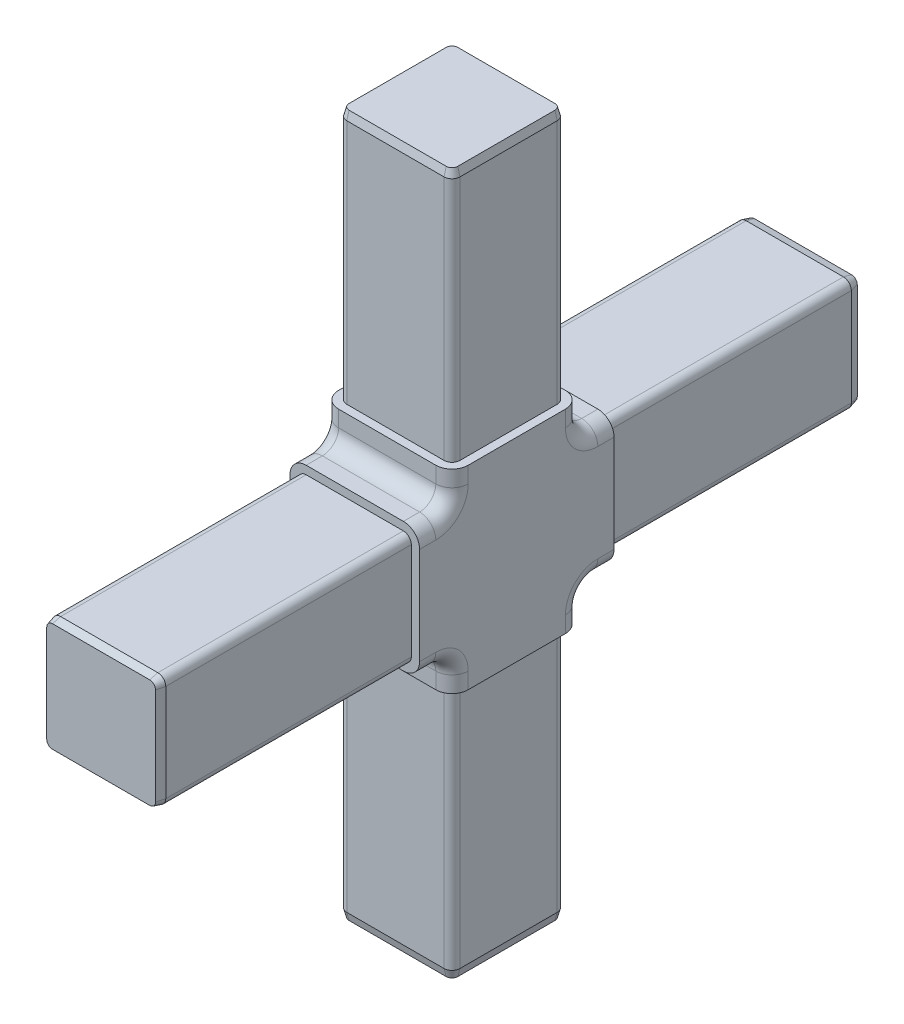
ISO-10303-21;
HEADER;
FILE_DESCRIPTION(('STEP AP214'),'2;1');
FILE_NAME('part.step','',(''),(''),'','','');
FILE_SCHEMA(('AUTOMOTIVE_DESIGN { 1 0 10303 214 1 1 1 1 }'));
ENDSEC;
DATA;
#1=APPLICATION_CONTEXT('core data for automotive mechanical design processes');
#2=APPLICATION_PROTOCOL_DEFINITION('international standard','automotive_design',2000,#1);
#3=PRODUCT_CONTEXT('',#1,'mechanical');
#4=PRODUCT('Part','Part','',(#3));
#5=PRODUCT_RELATED_PRODUCT_CATEGORY('part','',(#4));
#6=PRODUCT_DEFINITION_FORMATION('','',#4);
#7=PRODUCT_DEFINITION_CONTEXT('part definition',#1,'design');
#8=PRODUCT_DEFINITION('design','',#6,#7);
#9=PRODUCT_DEFINITION_SHAPE('','',#8);
#10=(LENGTH_UNIT() NAMED_UNIT(*) SI_UNIT(.MILLI.,.METRE.));
#11=(NAMED_UNIT(*) PLANE_ANGLE_UNIT() SI_UNIT($,.RADIAN.));
#12=(NAMED_UNIT(*) SI_UNIT($,.STERADIAN.) SOLID_ANGLE_UNIT());
#13=UNCERTAINTY_MEASURE_WITH_UNIT(LENGTH_MEASURE(1.E-05),#10,'distance_accuracy_value','');
#14=(GEOMETRIC_REPRESENTATION_CONTEXT(3) GLOBAL_UNCERTAINTY_ASSIGNED_CONTEXT((#13)) GLOBAL_UNIT_ASSIGNED_CONTEXT((#10,
#11,#12)) REPRESENTATION_CONTEXT('',''));
#15=CARTESIAN_POINT('',(0.,0.,0.));
#16=DIRECTION('',(0.,0.,1.));
#17=DIRECTION('',(1.,0.,0.));
#18=AXIS2_PLACEMENT_3D('',#15,#16,#17);
#19=CARTESIAN_POINT('',(-101.6,-101.6,550.));
#20=DIRECTION('',(1.,0.,0.));
#21=DIRECTION('',(0.,0.,-1.));
#22=AXIS2_PLACEMENT_3D('',#19,#20,#21);
#23=PLANE('',#22);
#24=CARTESIAN_POINT('',(-101.6,127.,-127.));
#25=DIRECTION('',(1.,0.,0.));
#26=DIRECTION('',(0.,0.,-1.));
#27=AXIS2_PLACEMENT_3D('',#24,#25,#26);
#28=CIRCLE('',#27,50.8);
#29=CARTESIAN_POINT('',(-101.6,76.2,-127.));
#30=VERTEX_POINT('',#29);
#31=CARTESIAN_POINT('',(-101.6,127.,-76.2));
#32=VERTEX_POINT('',#31);
#33=EDGE_CURVE('E909',#30,#32,#28,.F.);
#34=ORIENTED_EDGE('',*,*,#33,.F.);
#35=DIRECTION('',(0.,0.,-1.));
#36=VECTOR('',#35,1.);
#37=CARTESIAN_POINT('',(-101.6,76.2,550.));
#38=LINE('',#37,#36);
#39=CARTESIAN_POINT('',(-101.6,76.2,-152.4));
#40=VERTEX_POINT('',#39);
#41=EDGE_CURVE('E916',#30,#40,#38,.T.);
#42=ORIENTED_EDGE('',*,*,#41,.T.);
#43=DIRECTION('',(0.,-1.,0.));
#44=VECTOR('',#43,1.);
#45=CARTESIAN_POINT('',(-101.6,-101.6,-152.4));
#46=LINE('',#45,#44);
#47=CARTESIAN_POINT('',(-101.6,-76.2,-152.4));
#48=VERTEX_POINT('',#47);
#49=EDGE_CURVE('E628',#40,#48,#46,.T.);
#50=ORIENTED_EDGE('',*,*,#49,.T.);
#51=DIRECTION('',(0.,0.,-1.));
#52=VECTOR('',#51,1.);
#53=CARTESIAN_POINT('',(-101.6,-76.2,550.));
#54=LINE('',#53,#52);
#55=CARTESIAN_POINT('',(-101.6,-76.2,-127.));
#56=VERTEX_POINT('',#55);
#57=EDGE_CURVE('E906',#48,#56,#54,.F.);
#58=ORIENTED_EDGE('',*,*,#57,.T.);
#59=CARTESIAN_POINT('',(-101.6,-127.,-127.));
#60=DIRECTION('',(1.,0.,0.));
#61=DIRECTION('',(0.,0.,-1.));
#62=AXIS2_PLACEMENT_3D('',#59,#60,#61);
#63=CIRCLE('',#62,50.8);
#64=CARTESIAN_POINT('',(-101.6,-127.,-76.2));
#65=VERTEX_POINT('',#64);
#66=EDGE_CURVE('E902',#65,#56,#63,.F.);
#67=ORIENTED_EDGE('',*,*,#66,.F.);
#68=DIRECTION('',(0.,-1.,0.));
#69=VECTOR('',#68,1.);
#70=CARTESIAN_POINT('',(-101.6,-101.6,-76.2));
#71=LINE('',#70,#69);
#72=CARTESIAN_POINT('',(-101.6,-152.4,-76.2));
#73=VERTEX_POINT('',#72);
#74=EDGE_CURVE('E899',#65,#73,#71,.T.);
#75=ORIENTED_EDGE('',*,*,#74,.T.);
#76=DIRECTION('',(0.,0.,1.));
#77=VECTOR('',#76,1.);
#78=CARTESIAN_POINT('',(-101.6,-152.4,550.));
#79=LINE('',#78,#77);
#80=CARTESIAN_POINT('',(-101.6,-152.4,76.2));
#81=VERTEX_POINT('',#80);
#82=EDGE_CURVE('E764',#73,#81,#79,.T.);
#83=ORIENTED_EDGE('',*,*,#82,.T.);
#84=DIRECTION('',(0.,-1.,0.));
#85=VECTOR('',#84,1.);
#86=CARTESIAN_POINT('',(-101.6,-101.6,76.2));
#87=LINE('',#86,#85);
#88=CARTESIAN_POINT('',(-101.6,-127.,76.2));
#89=VERTEX_POINT('',#88);
#90=EDGE_CURVE('E882',#81,#89,#87,.F.);
#91=ORIENTED_EDGE('',*,*,#90,.T.);
#92=CARTESIAN_POINT('',(-101.6,-127.,127.));
#93=DIRECTION('',(1.,0.,0.));
#94=DIRECTION('',(0.,0.,-1.));
#95=AXIS2_PLACEMENT_3D('',#92,#93,#94);
#96=CIRCLE('',#95,50.8);
#97=CARTESIAN_POINT('',(-101.6,-76.2,127.));
#98=VERTEX_POINT('',#97);
#99=EDGE_CURVE('E878',#98,#89,#96,.F.);
#100=ORIENTED_EDGE('',*,*,#99,.F.);
#101=DIRECTION('',(0.,0.,-1.));
#102=VECTOR('',#101,1.);
#103=CARTESIAN_POINT('',(-101.6,-76.2,550.));
#104=LINE('',#103,#102);
#105=CARTESIAN_POINT('',(-101.6,-76.2,152.4));
#106=VERTEX_POINT('',#105);
#107=EDGE_CURVE('E885',#98,#106,#104,.F.);
#108=ORIENTED_EDGE('',*,*,#107,.T.);
#109=DIRECTION('',(0.,-1.,0.));
#110=VECTOR('',#109,1.);
#111=CARTESIAN_POINT('',(-101.6,-101.6,152.4));
#112=LINE('',#111,#110);
#113=CARTESIAN_POINT('',(-101.6,76.2,152.4));
#114=VERTEX_POINT('',#113);
#115=EDGE_CURVE('E696',#114,#106,#112,.T.);
#116=ORIENTED_EDGE('',*,*,#115,.F.);
#117=DIRECTION('',(0.,0.,-1.));
#118=VECTOR('',#117,1.);
#119=CARTESIAN_POINT('',(-101.6,76.2,550.));
#120=LINE('',#119,#118);
#121=CARTESIAN_POINT('',(-101.6,76.2,127.));
#122=VERTEX_POINT('',#121);
#123=EDGE_CURVE('E895',#114,#122,#120,.T.);
#124=ORIENTED_EDGE('',*,*,#123,.T.);
#125=CARTESIAN_POINT('',(-101.6,127.,127.));
#126=DIRECTION('',(1.,0.,0.));
#127=DIRECTION('',(0.,0.,-1.));
#128=AXIS2_PLACEMENT_3D('',#125,#126,#127);
#129=CIRCLE('',#128,50.8);
#130=CARTESIAN_POINT('',(-101.6,127.,76.2));
#131=VERTEX_POINT('',#130);
#132=EDGE_CURVE('E891',#131,#122,#129,.F.);
#133=ORIENTED_EDGE('',*,*,#132,.F.);
#134=DIRECTION('',(0.,-1.,0.));
#135=VECTOR('',#134,1.);
#136=CARTESIAN_POINT('',(-101.6,-101.6,76.2));
#137=LINE('',#136,#135);
#138=CARTESIAN_POINT('',(-101.6,152.4,76.2));
#139=VERTEX_POINT('',#138);
#140=EDGE_CURVE('E888',#131,#139,#137,.F.);
#141=ORIENTED_EDGE('',*,*,#140,.T.);
#142=DIRECTION('',(0.,0.,1.));
#143=VECTOR('',#142,1.);
#144=CARTESIAN_POINT('',(-101.6,152.4,550.));
#145=LINE('',#144,#143);
#146=CARTESIAN_POINT('',(-101.6,152.4,-76.2));
#147=VERTEX_POINT('',#146);
#148=EDGE_CURVE('E832',#147,#139,#145,.T.);
#149=ORIENTED_EDGE('',*,*,#148,.F.);
#150=DIRECTION('',(0.,-1.,0.));
#151=VECTOR('',#150,1.);
#152=CARTESIAN_POINT('',(-101.6,-101.6,-76.2));
#153=LINE('',#152,#151);
#154=EDGE_CURVE('E913',#147,#32,#153,.T.);
#155=ORIENTED_EDGE('',*,*,#154,.T.);
#156=EDGE_LOOP('',(#34,#42,#50,#58,#67,#75,#83,#91,#100,#108,#116,#124,#133,#141,#149,#155));
#157=FACE_BOUND('',#156,.T.);
#158=ADVANCED_FACE('F53',(#157),#23,.F.);
#159=CARTESIAN_POINT('',(101.6,-101.6,550.));
#160=DIRECTION('',(-1.,0.,0.));
#161=DIRECTION('',(0.,0.,1.));
#162=AXIS2_PLACEMENT_3D('',#159,#160,#161);
#163=PLANE('',#162);
#164=DIRECTION('',(0.,0.,-1.));
#165=VECTOR('',#164,1.);
#166=CARTESIAN_POINT('',(101.6,-152.4,550.));
#167=LINE('',#166,#165);
#168=CARTESIAN_POINT('',(101.6,-152.4,76.2));
#169=VERTEX_POINT('',#168);
#170=CARTESIAN_POINT('',(101.6,-152.4,-76.2));
#171=VERTEX_POINT('',#170);
#172=EDGE_CURVE('E740',#169,#171,#167,.T.);
#173=ORIENTED_EDGE('',*,*,#172,.T.);
#174=DIRECTION('',(0.,-1.,0.));
#175=VECTOR('',#174,1.);
#176=CARTESIAN_POINT('',(101.6,-101.6,-76.2));
#177=LINE('',#176,#175);
#178=CARTESIAN_POINT('',(101.6,-127.,-76.2));
#179=VERTEX_POINT('',#178);
#180=EDGE_CURVE('E1057',#171,#179,#177,.F.);
#181=ORIENTED_EDGE('',*,*,#180,.T.);
#182=CARTESIAN_POINT('',(101.6,-127.,-127.));
#183=DIRECTION('',(-1.,0.,0.));
#184=DIRECTION('',(0.,0.,1.));
#185=AXIS2_PLACEMENT_3D('',#182,#183,#184);
#186=CIRCLE('',#185,50.8);
#187=CARTESIAN_POINT('',(101.6,-76.2,-127.));
#188=VERTEX_POINT('',#187);
#189=EDGE_CURVE('E1053',#188,#179,#186,.F.);
#190=ORIENTED_EDGE('',*,*,#189,.F.);
#191=DIRECTION('',(0.,0.,-1.));
#192=VECTOR('',#191,1.);
#193=CARTESIAN_POINT('',(101.6,-76.2,550.));
#194=LINE('',#193,#192);
#195=CARTESIAN_POINT('',(101.6,-76.2,-152.4));
#196=VERTEX_POINT('',#195);
#197=EDGE_CURVE('E1050',#188,#196,#194,.T.);
#198=ORIENTED_EDGE('',*,*,#197,.T.);
#199=DIRECTION('',(0.,1.,0.));
#200=VECTOR('',#199,1.);
#201=CARTESIAN_POINT('',(101.6,-101.6,-152.4));
#202=LINE('',#201,#200);
#203=CARTESIAN_POINT('',(101.6,76.2,-152.4));
#204=VERTEX_POINT('',#203);
#205=EDGE_CURVE('E608',#196,#204,#202,.T.);
#206=ORIENTED_EDGE('',*,*,#205,.T.);
#207=DIRECTION('',(0.,0.,-1.));
#208=VECTOR('',#207,1.);
#209=CARTESIAN_POINT('',(101.6,76.2,550.));
#210=LINE('',#209,#208);
#211=CARTESIAN_POINT('',(101.6,76.2,-127.));
#212=VERTEX_POINT('',#211);
#213=EDGE_CURVE('E1047',#204,#212,#210,.F.);
#214=ORIENTED_EDGE('',*,*,#213,.T.);
#215=CARTESIAN_POINT('',(101.6,127.,-127.));
#216=DIRECTION('',(-1.,0.,0.));
#217=DIRECTION('',(0.,0.,1.));
#218=AXIS2_PLACEMENT_3D('',#215,#216,#217);
#219=CIRCLE('',#218,50.8);
#220=CARTESIAN_POINT('',(101.6,127.,-76.2));
#221=VERTEX_POINT('',#220);
#222=EDGE_CURVE('E1043',#221,#212,#219,.F.);
#223=ORIENTED_EDGE('',*,*,#222,.F.);
#224=DIRECTION('',(0.,-1.,0.));
#225=VECTOR('',#224,1.);
#226=CARTESIAN_POINT('',(101.6,-101.6,-76.2));
#227=LINE('',#226,#225);
#228=CARTESIAN_POINT('',(101.6,152.4,-76.2));
#229=VERTEX_POINT('',#228);
#230=EDGE_CURVE('E1040',#221,#229,#227,.F.);
#231=ORIENTED_EDGE('',*,*,#230,.T.);
#232=DIRECTION('',(0.,0.,-1.));
#233=VECTOR('',#232,1.);
#234=CARTESIAN_POINT('',(101.6,152.4,550.));
#235=LINE('',#234,#233);
#236=CARTESIAN_POINT('',(101.6,152.4,76.2));
#237=VERTEX_POINT('',#236);
#238=EDGE_CURVE('E828',#237,#229,#235,.T.);
#239=ORIENTED_EDGE('',*,*,#238,.F.);
#240=DIRECTION('',(0.,-1.,0.));
#241=VECTOR('',#240,1.);
#242=CARTESIAN_POINT('',(101.6,-101.6,76.2));
#243=LINE('',#242,#241);
#244=CARTESIAN_POINT('',(101.6,127.,76.2));
#245=VERTEX_POINT('',#244);
#246=EDGE_CURVE('E1037',#237,#245,#243,.T.);
#247=ORIENTED_EDGE('',*,*,#246,.T.);
#248=CARTESIAN_POINT('',(101.6,127.,127.));
#249=DIRECTION('',(-1.,0.,0.));
#250=DIRECTION('',(0.,0.,1.));
#251=AXIS2_PLACEMENT_3D('',#248,#249,#250);
#252=CIRCLE('',#251,50.8);
#253=CARTESIAN_POINT('',(101.6,76.2,127.));
#254=VERTEX_POINT('',#253);
#255=EDGE_CURVE('E1033',#254,#245,#252,.F.);
#256=ORIENTED_EDGE('',*,*,#255,.F.);
#257=DIRECTION('',(0.,0.,-1.));
#258=VECTOR('',#257,1.);
#259=CARTESIAN_POINT('',(101.6,76.2,550.));
#260=LINE('',#259,#258);
#261=CARTESIAN_POINT('',(101.6,76.2,152.4));
#262=VERTEX_POINT('',#261);
#263=EDGE_CURVE('E1030',#254,#262,#260,.F.);
#264=ORIENTED_EDGE('',*,*,#263,.T.);
#265=DIRECTION('',(0.,1.,0.));
#266=VECTOR('',#265,1.);
#267=CARTESIAN_POINT('',(101.6,-101.6,152.4));
#268=LINE('',#267,#266);
#269=CARTESIAN_POINT('',(101.6,-76.2,152.4));
#270=VERTEX_POINT('',#269);
#271=EDGE_CURVE('E692',#270,#262,#268,.T.);
#272=ORIENTED_EDGE('',*,*,#271,.F.);
#273=DIRECTION('',(0.,0.,-1.));
#274=VECTOR('',#273,1.);
#275=CARTESIAN_POINT('',(101.6,-76.2,550.));
#276=LINE('',#275,#274);
#277=CARTESIAN_POINT('',(101.6,-76.2,127.));
#278=VERTEX_POINT('',#277);
#279=EDGE_CURVE('E1024',#270,#278,#276,.T.);
#280=ORIENTED_EDGE('',*,*,#279,.T.);
#281=CARTESIAN_POINT('',(101.6,-127.,127.));
#282=DIRECTION('',(-1.,0.,0.));
#283=DIRECTION('',(0.,0.,1.));
#284=AXIS2_PLACEMENT_3D('',#281,#282,#283);
#285=CIRCLE('',#284,50.8);
#286=CARTESIAN_POINT('',(101.6,-127.,76.2));
#287=VERTEX_POINT('',#286);
#288=EDGE_CURVE('E1020',#287,#278,#285,.F.);
#289=ORIENTED_EDGE('',*,*,#288,.F.);
#290=DIRECTION('',(0.,-1.,0.));
#291=VECTOR('',#290,1.);
#292=CARTESIAN_POINT('',(101.6,-101.6,76.2));
#293=LINE('',#292,#291);
#294=EDGE_CURVE('E1027',#287,#169,#293,.T.);
#295=ORIENTED_EDGE('',*,*,#294,.T.);
#296=EDGE_LOOP('',(#173,#181,#190,#198,#206,#214,#223,#231,#239,#247,#256,#264,#272,#280,#289,#295));
#297=FACE_BOUND('',#296,.T.);
#298=ADVANCED_FACE('F1530',(#297),#163,.F.);
#299=CARTESIAN_POINT('',(-101.6,101.6,550.));
#300=DIRECTION('',(0.,-1.,0.));
#301=DIRECTION('',(0.,0.,-1.));
#302=AXIS2_PLACEMENT_3D('',#299,#300,#301);
#303=PLANE('',#302);
#304=DIRECTION('',(1.,0.,0.));
#305=VECTOR('',#304,1.);
#306=CARTESIAN_POINT('',(-101.6,101.6,127.));
#307=LINE('',#306,#305);
#308=CARTESIAN_POINT('',(76.2,101.6,127.));
#309=VERTEX_POINT('',#308);
#310=CARTESIAN_POINT('',(-76.2,101.6,127.));
#311=VERTEX_POINT('',#310);
#312=EDGE_CURVE('E922',#309,#311,#307,.F.);
#313=ORIENTED_EDGE('',*,*,#312,.T.);
#314=DIRECTION('',(0.,0.,-1.));
#315=VECTOR('',#314,1.);
#316=CARTESIAN_POINT('',(-76.2,101.6,550.));
#317=LINE('',#316,#315);
#318=CARTESIAN_POINT('',(-76.2,101.6,152.4));
#319=VERTEX_POINT('',#318);
#320=EDGE_CURVE('E925',#311,#319,#317,.F.);
#321=ORIENTED_EDGE('',*,*,#320,.T.);
#322=DIRECTION('',(-1.,0.,0.));
#323=VECTOR('',#322,1.);
#324=CARTESIAN_POINT('',(-101.6,101.6,152.4));
#325=LINE('',#324,#323);
#326=CARTESIAN_POINT('',(76.2,101.6,152.4));
#327=VERTEX_POINT('',#326);
#328=EDGE_CURVE('E700',#327,#319,#325,.T.);
#329=ORIENTED_EDGE('',*,*,#328,.F.);
#330=DIRECTION('',(0.,0.,-1.));
#331=VECTOR('',#330,1.);
#332=CARTESIAN_POINT('',(76.2,101.6,550.));
#333=LINE('',#332,#331);
#334=EDGE_CURVE('E919',#327,#309,#333,.T.);
#335=ORIENTED_EDGE('',*,*,#334,.T.);
#336=EDGE_LOOP('',(#313,#321,#329,#335));
#337=FACE_BOUND('',#336,.T.);
#338=ADVANCED_FACE('F1536',(#337),#303,.F.);
#339=CARTESIAN_POINT('',(-101.6,-101.6,550.));
#340=DIRECTION('',(0.,1.,0.));
#341=DIRECTION('',(0.,0.,1.));
#342=AXIS2_PLACEMENT_3D('',#339,#340,#341);
#343=PLANE('',#342);
#344=DIRECTION('',(1.,0.,0.));
#345=VECTOR('',#344,1.);
#346=CARTESIAN_POINT('',(-101.6,-101.6,152.4));
#347=LINE('',#346,#345);
#348=CARTESIAN_POINT('',(-76.2,-101.6,152.4));
#349=VERTEX_POINT('',#348);
#350=CARTESIAN_POINT('',(76.2,-101.6,152.4));
#351=VERTEX_POINT('',#350);
#352=EDGE_CURVE('E848',#349,#351,#347,.T.);
#353=ORIENTED_EDGE('',*,*,#352,.F.);
#354=DIRECTION('',(0.,0.,-1.));
#355=VECTOR('',#354,1.);
#356=CARTESIAN_POINT('',(-76.2,-101.6,550.));
#357=LINE('',#356,#355);
#358=CARTESIAN_POINT('',(-76.2,-101.6,127.));
#359=VERTEX_POINT('',#358);
#360=EDGE_CURVE('E946',#349,#359,#357,.T.);
#361=ORIENTED_EDGE('',*,*,#360,.T.);
#362=DIRECTION('',(-1.,0.,0.));
#363=VECTOR('',#362,1.);
#364=CARTESIAN_POINT('',(101.6,-101.6,127.));
#365=LINE('',#364,#363);
#366=CARTESIAN_POINT('',(76.2,-101.6,127.));
#367=VERTEX_POINT('',#366);
#368=EDGE_CURVE('E943',#359,#367,#365,.F.);
#369=ORIENTED_EDGE('',*,*,#368,.T.);
#370=DIRECTION('',(0.,0.,-1.));
#371=VECTOR('',#370,1.);
#372=CARTESIAN_POINT('',(76.2,-101.6,550.));
#373=LINE('',#372,#371);
#374=EDGE_CURVE('E940',#367,#351,#373,.F.);
#375=ORIENTED_EDGE('',*,*,#374,.T.);
#376=EDGE_LOOP('',(#353,#361,#369,#375));
#377=FACE_BOUND('',#376,.T.);
#378=ADVANCED_FACE('F1541',(#377),#343,.F.);
#379=CARTESIAN_POINT('',(101.6,550.,101.6));
#380=DIRECTION('',(0.,0.,-1.));
#381=DIRECTION('',(-1.,0.,0.));
#382=AXIS2_PLACEMENT_3D('',#379,#380,#381);
#383=PLANE('',#382);
#384=DIRECTION('',(1.,0.,0.));
#385=VECTOR('',#384,1.);
#386=CARTESIAN_POINT('',(101.6,152.4,101.6));
#387=LINE('',#386,#385);
#388=CARTESIAN_POINT('',(-76.2,152.4,101.6));
#389=VERTEX_POINT('',#388);
#390=CARTESIAN_POINT('',(76.2,152.4,101.6));
#391=VERTEX_POINT('',#390);
#392=EDGE_CURVE('E836',#389,#391,#387,.T.);
#393=ORIENTED_EDGE('',*,*,#392,.F.);
#394=DIRECTION('',(0.,-1.,0.));
#395=VECTOR('',#394,1.);
#396=CARTESIAN_POINT('',(-76.2,550.,101.6));
#397=LINE('',#396,#395);
#398=CARTESIAN_POINT('',(-76.2,127.,101.6));
#399=VERTEX_POINT('',#398);
#400=EDGE_CURVE('E1008',#389,#399,#397,.T.);
#401=ORIENTED_EDGE('',*,*,#400,.T.);
#402=DIRECTION('',(1.,0.,0.));
#403=VECTOR('',#402,1.);
#404=CARTESIAN_POINT('',(101.6,127.,101.6));
#405=LINE('',#404,#403);
#406=CARTESIAN_POINT('',(76.2,127.,101.6));
#407=VERTEX_POINT('',#406);
#408=EDGE_CURVE('E1005',#399,#407,#405,.T.);
#409=ORIENTED_EDGE('',*,*,#408,.T.);
#410=DIRECTION('',(0.,-1.,0.));
#411=VECTOR('',#410,1.);
#412=CARTESIAN_POINT('',(76.2,550.,101.6));
#413=LINE('',#412,#411);
#414=EDGE_CURVE('E1002',#407,#391,#413,.F.);
#415=ORIENTED_EDGE('',*,*,#414,.T.);
#416=EDGE_LOOP('',(#393,#401,#409,#415));
#417=FACE_BOUND('',#416,.T.);
#418=ADVANCED_FACE('F2052',(#417),#383,.F.);
#419=CARTESIAN_POINT('',(101.6,550.,-101.6));
#420=DIRECTION('',(0.,0.,1.));
#421=DIRECTION('',(1.,0.,0.));
#422=AXIS2_PLACEMENT_3D('',#419,#420,#421);
#423=PLANE('',#422);
#424=DIRECTION('',(-1.,0.,0.));
#425=VECTOR('',#424,1.);
#426=CARTESIAN_POINT('',(-101.6,127.,-101.6));
#427=LINE('',#426,#425);
#428=CARTESIAN_POINT('',(76.2,127.,-101.6));
#429=VERTEX_POINT('',#428);
#430=CARTESIAN_POINT('',(-76.2,127.,-101.6));
#431=VERTEX_POINT('',#430);
#432=EDGE_CURVE('E953',#429,#431,#427,.T.);
#433=ORIENTED_EDGE('',*,*,#432,.T.);
#434=DIRECTION('',(0.,-1.,0.));
#435=VECTOR('',#434,1.);
#436=CARTESIAN_POINT('',(-76.2,550.,-101.6));
#437=LINE('',#436,#435);
#438=CARTESIAN_POINT('',(-76.2,152.4,-101.6));
#439=VERTEX_POINT('',#438);
#440=EDGE_CURVE('E957',#431,#439,#437,.F.);
#441=ORIENTED_EDGE('',*,*,#440,.T.);
#442=DIRECTION('',(-1.,0.,0.));
#443=VECTOR('',#442,1.);
#444=CARTESIAN_POINT('',(101.6,152.4,-101.6));
#445=LINE('',#444,#443);
#446=CARTESIAN_POINT('',(76.2,152.4,-101.6));
#447=VERTEX_POINT('',#446);
#448=EDGE_CURVE('E840',#447,#439,#445,.T.);
#449=ORIENTED_EDGE('',*,*,#448,.F.);
#450=DIRECTION('',(0.,-1.,0.));
#451=VECTOR('',#450,1.);
#452=CARTESIAN_POINT('',(76.2,550.,-101.6));
#453=LINE('',#452,#451);
#454=EDGE_CURVE('E950',#447,#429,#453,.T.);
#455=ORIENTED_EDGE('',*,*,#454,.T.);
#456=EDGE_LOOP('',(#433,#441,#449,#455));
#457=FACE_BOUND('',#456,.T.);
#458=ADVANCED_FACE('F2049',(#457),#423,.F.);
#459=DIRECTION('',(-1.,0.,0.));
#460=VECTOR('',#459,1.);
#461=CARTESIAN_POINT('',(-101.6,101.6,-152.4));
#462=LINE('',#461,#460);
#463=CARTESIAN_POINT('',(76.2,101.6,-152.4));
#464=VERTEX_POINT('',#463);
#465=CARTESIAN_POINT('',(-76.2,101.6,-152.4));
#466=VERTEX_POINT('',#465);
#467=EDGE_CURVE('E632',#464,#466,#462,.T.);
#468=ORIENTED_EDGE('',*,*,#467,.T.);
#469=DIRECTION('',(0.,0.,-1.));
#470=VECTOR('',#469,1.);
#471=CARTESIAN_POINT('',(-76.2,101.6,550.));
#472=LINE('',#471,#470);
#473=CARTESIAN_POINT('',(-76.2,101.6,-127.));
#474=VERTEX_POINT('',#473);
#475=EDGE_CURVE('E966',#466,#474,#472,.F.);
#476=ORIENTED_EDGE('',*,*,#475,.T.);
#477=DIRECTION('',(-1.,0.,0.));
#478=VECTOR('',#477,1.);
#479=CARTESIAN_POINT('',(101.6,101.6,-127.));
#480=LINE('',#479,#478);
#481=CARTESIAN_POINT('',(76.2,101.6,-127.));
#482=VERTEX_POINT('',#481);
#483=EDGE_CURVE('E963',#474,#482,#480,.F.);
#484=ORIENTED_EDGE('',*,*,#483,.T.);
#485=DIRECTION('',(0.,0.,-1.));
#486=VECTOR('',#485,1.);
#487=CARTESIAN_POINT('',(76.2,101.6,550.));
#488=LINE('',#487,#486);
#489=EDGE_CURVE('E960',#482,#464,#488,.T.);
#490=ORIENTED_EDGE('',*,*,#489,.T.);
#491=EDGE_LOOP('',(#468,#476,#484,#490));
#492=FACE_BOUND('',#491,.T.);
#493=ADVANCED_FACE('F1545',(#492),#303,.F.);
#494=DIRECTION('',(1.,0.,0.));
#495=VECTOR('',#494,1.);
#496=CARTESIAN_POINT('',(-101.6,-101.6,-127.));
#497=LINE('',#496,#495);
#498=CARTESIAN_POINT('',(76.2,-101.6,-127.));
#499=VERTEX_POINT('',#498);
#500=CARTESIAN_POINT('',(-76.2,-101.6,-127.));
#501=VERTEX_POINT('',#500);
#502=EDGE_CURVE('E859',#499,#501,#497,.F.);
#503=ORIENTED_EDGE('',*,*,#502,.T.);
#504=DIRECTION('',(0.,0.,-1.));
#505=VECTOR('',#504,1.);
#506=CARTESIAN_POINT('',(-76.2,-101.6,550.));
#507=LINE('',#506,#505);
#508=CARTESIAN_POINT('',(-76.2,-101.6,-152.4));
#509=VERTEX_POINT('',#508);
#510=EDGE_CURVE('E862',#501,#509,#507,.T.);
#511=ORIENTED_EDGE('',*,*,#510,.T.);
#512=DIRECTION('',(1.,0.,0.));
#513=VECTOR('',#512,1.);
#514=CARTESIAN_POINT('',(-101.6,-101.6,-152.4));
#515=LINE('',#514,#513);
#516=CARTESIAN_POINT('',(76.2,-101.6,-152.4));
#517=VERTEX_POINT('',#516);
#518=EDGE_CURVE('E852',#509,#517,#515,.T.);
#519=ORIENTED_EDGE('',*,*,#518,.T.);
#520=DIRECTION('',(0.,0.,-1.));
#521=VECTOR('',#520,1.);
#522=CARTESIAN_POINT('',(76.2,-101.6,550.));
#523=LINE('',#522,#521);
#524=EDGE_CURVE('E856',#517,#499,#523,.F.);
#525=ORIENTED_EDGE('',*,*,#524,.T.);
#526=EDGE_LOOP('',(#503,#511,#519,#525));
#527=FACE_BOUND('',#526,.T.);
#528=ADVANCED_FACE('F2194',(#527),#343,.F.);
#529=DIRECTION('',(-1.,0.,0.));
#530=VECTOR('',#529,1.);
#531=CARTESIAN_POINT('',(101.6,-152.4,-101.6));
#532=LINE('',#531,#530);
#533=CARTESIAN_POINT('',(76.2,-152.4,-101.6));
#534=VERTEX_POINT('',#533);
#535=CARTESIAN_POINT('',(-76.2,-152.4,-101.6));
#536=VERTEX_POINT('',#535);
#537=EDGE_CURVE('E768',#534,#536,#532,.T.);
#538=ORIENTED_EDGE('',*,*,#537,.T.);
#539=DIRECTION('',(0.,-1.,0.));
#540=VECTOR('',#539,1.);
#541=CARTESIAN_POINT('',(-76.2,550.,-101.6));
#542=LINE('',#541,#540);
#543=CARTESIAN_POINT('',(-76.2,-127.,-101.6));
#544=VERTEX_POINT('',#543);
#545=EDGE_CURVE('E999',#536,#544,#542,.F.);
#546=ORIENTED_EDGE('',*,*,#545,.T.);
#547=DIRECTION('',(1.,0.,0.));
#548=VECTOR('',#547,1.);
#549=CARTESIAN_POINT('',(101.6,-127.,-101.6));
#550=LINE('',#549,#548);
#551=CARTESIAN_POINT('',(76.2,-127.,-101.6));
#552=VERTEX_POINT('',#551);
#553=EDGE_CURVE('E996',#544,#552,#550,.T.);
#554=ORIENTED_EDGE('',*,*,#553,.T.);
#555=DIRECTION('',(0.,-1.,0.));
#556=VECTOR('',#555,1.);
#557=CARTESIAN_POINT('',(76.2,550.,-101.6));
#558=LINE('',#557,#556);
#559=EDGE_CURVE('E993',#552,#534,#558,.T.);
#560=ORIENTED_EDGE('',*,*,#559,.T.);
#561=EDGE_LOOP('',(#538,#546,#554,#560));
#562=FACE_BOUND('',#561,.T.);
#563=ADVANCED_FACE('F2054',(#562),#423,.F.);
#564=DIRECTION('',(-1.,0.,0.));
#565=VECTOR('',#564,1.);
#566=CARTESIAN_POINT('',(-101.6,-127.,101.6));
#567=LINE('',#566,#565);
#568=CARTESIAN_POINT('',(76.2,-127.,101.6));
#569=VERTEX_POINT('',#568);
#570=CARTESIAN_POINT('',(-76.2,-127.,101.6));
#571=VERTEX_POINT('',#570);
#572=EDGE_CURVE('E1014',#569,#571,#567,.T.);
#573=ORIENTED_EDGE('',*,*,#572,.T.);
#574=DIRECTION('',(0.,-1.,0.));
#575=VECTOR('',#574,1.);
#576=CARTESIAN_POINT('',(-76.2,550.,101.6));
#577=LINE('',#576,#575);
#578=CARTESIAN_POINT('',(-76.2,-152.4,101.6));
#579=VERTEX_POINT('',#578);
#580=EDGE_CURVE('E1017',#571,#579,#577,.T.);
#581=ORIENTED_EDGE('',*,*,#580,.T.);
#582=DIRECTION('',(1.,0.,0.));
#583=VECTOR('',#582,1.);
#584=CARTESIAN_POINT('',(101.6,-152.4,101.6));
#585=LINE('',#584,#583);
#586=CARTESIAN_POINT('',(76.2,-152.4,101.6));
#587=VERTEX_POINT('',#586);
#588=EDGE_CURVE('E844',#579,#587,#585,.T.);
#589=ORIENTED_EDGE('',*,*,#588,.T.);
#590=DIRECTION('',(0.,-1.,0.));
#591=VECTOR('',#590,1.);
#592=CARTESIAN_POINT('',(76.2,550.,101.6));
#593=LINE('',#592,#591);
#594=EDGE_CURVE('E1011',#587,#569,#593,.F.);
#595=ORIENTED_EDGE('',*,*,#594,.T.);
#596=EDGE_LOOP('',(#573,#581,#589,#595));
#597=FACE_BOUND('',#596,.T.);
#598=ADVANCED_FACE('F2042',(#597),#383,.F.);
#599=CARTESIAN_POINT('',(0.,152.4,0.));
#600=DIRECTION('',(0.,1.,0.));
#601=DIRECTION('',(0.,0.,1.));
#602=AXIS2_PLACEMENT_3D('',#599,#600,#601);
#603=PLANE('',#602);
#604=CARTESIAN_POINT('',(76.2,152.4,76.2));
#605=DIRECTION('',(0.,1.,0.));
#606=DIRECTION('',(0.,0.,1.));
#607=AXIS2_PLACEMENT_3D('',#604,#605,#606);
#608=CIRCLE('',#607,12.446);
#609=CARTESIAN_POINT('',(76.2,152.4,88.646));
#610=VERTEX_POINT('',#609);
#611=CARTESIAN_POINT('',(88.646,152.4,76.2));
#612=VERTEX_POINT('',#611);
#613=EDGE_CURVE('E772',#610,#612,#608,.T.);
#614=ORIENTED_EDGE('',*,*,#613,.F.);
#615=DIRECTION('',(1.,0.,0.));
#616=VECTOR('',#615,1.);
#617=CARTESIAN_POINT('',(-76.2,152.4,88.646));
#618=LINE('',#617,#616);
#619=CARTESIAN_POINT('',(-76.2,152.4,88.646));
#620=VERTEX_POINT('',#619);
#621=EDGE_CURVE('E800',#620,#610,#618,.T.);
#622=ORIENTED_EDGE('',*,*,#621,.F.);
#623=CARTESIAN_POINT('',(-76.2,152.4,76.2));
#624=DIRECTION('',(0.,1.,0.));
#625=DIRECTION('',(0.,0.,1.));
#626=AXIS2_PLACEMENT_3D('',#623,#624,#625);
#627=CIRCLE('',#626,12.446);
#628=CARTESIAN_POINT('',(-88.646,152.4,76.2));
#629=VERTEX_POINT('',#628);
#630=EDGE_CURVE('E796',#629,#620,#627,.T.);
#631=ORIENTED_EDGE('',*,*,#630,.F.);
#632=DIRECTION('',(0.,0.,1.));
#633=VECTOR('',#632,1.);
#634=CARTESIAN_POINT('',(-88.646,152.4,-76.2));
#635=LINE('',#634,#633);
#636=CARTESIAN_POINT('',(-88.646,152.4,-76.2));
#637=VERTEX_POINT('',#636);
#638=EDGE_CURVE('E792',#637,#629,#635,.T.);
#639=ORIENTED_EDGE('',*,*,#638,.F.);
#640=CARTESIAN_POINT('',(-76.2,152.4,-76.2));
#641=DIRECTION('',(0.,1.,0.));
#642=DIRECTION('',(0.,0.,1.));
#643=AXIS2_PLACEMENT_3D('',#640,#641,#642);
#644=CIRCLE('',#643,12.446);
#645=CARTESIAN_POINT('',(-76.2,152.4,-88.646));
#646=VERTEX_POINT('',#645);
#647=EDGE_CURVE('E788',#646,#637,#644,.T.);
#648=ORIENTED_EDGE('',*,*,#647,.F.);
#649=DIRECTION('',(-1.,0.,0.));
#650=VECTOR('',#649,1.);
#651=CARTESIAN_POINT('',(76.2,152.4,-88.646));
#652=LINE('',#651,#650);
#653=CARTESIAN_POINT('',(76.2,152.4,-88.646));
#654=VERTEX_POINT('',#653);
#655=EDGE_CURVE('E784',#654,#646,#652,.T.);
#656=ORIENTED_EDGE('',*,*,#655,.F.);
#657=CARTESIAN_POINT('',(76.2,152.4,-76.2));
#658=DIRECTION('',(0.,1.,0.));
#659=DIRECTION('',(0.,0.,1.));
#660=AXIS2_PLACEMENT_3D('',#657,#658,#659);
#661=CIRCLE('',#660,12.446);
#662=CARTESIAN_POINT('',(88.646,152.4,-76.2));
#663=VERTEX_POINT('',#662);
#664=EDGE_CURVE('E780',#663,#654,#661,.T.);
#665=ORIENTED_EDGE('',*,*,#664,.F.);
#666=DIRECTION('',(0.,0.,-1.));
#667=VECTOR('',#666,1.);
#668=CARTESIAN_POINT('',(88.646,152.4,76.2));
#669=LINE('',#668,#667);
#670=EDGE_CURVE('E776',#612,#663,#669,.T.);
#671=ORIENTED_EDGE('',*,*,#670,.F.);
#672=EDGE_LOOP('',(#614,#622,#631,#639,#648,#656,#665,#671));
#673=FACE_BOUND('',#672,.T.);
#674=ORIENTED_EDGE('',*,*,#448,.T.);
#675=CARTESIAN_POINT('',(-76.2,152.4,-76.2));
#676=DIRECTION('',(0.,1.,0.));
#677=DIRECTION('',(0.,0.,1.));
#678=AXIS2_PLACEMENT_3D('',#675,#676,#677);
#679=CIRCLE('',#678,25.4);
#680=EDGE_CURVE('E978',#439,#147,#679,.T.);
#681=ORIENTED_EDGE('',*,*,#680,.T.);
#682=ORIENTED_EDGE('',*,*,#148,.T.);
#683=CARTESIAN_POINT('',(-76.2,152.4,76.2));
#684=DIRECTION('',(0.,1.,0.));
#685=DIRECTION('',(0.,0.,1.));
#686=AXIS2_PLACEMENT_3D('',#683,#684,#685);
#687=CIRCLE('',#686,25.4);
#688=EDGE_CURVE('E975',#139,#389,#687,.T.);
#689=ORIENTED_EDGE('',*,*,#688,.T.);
#690=ORIENTED_EDGE('',*,*,#392,.T.);
#691=CARTESIAN_POINT('',(76.2,152.4,76.2));
#692=DIRECTION('',(0.,1.,0.));
#693=DIRECTION('',(0.,0.,1.));
#694=AXIS2_PLACEMENT_3D('',#691,#692,#693);
#695=CIRCLE('',#694,25.4);
#696=EDGE_CURVE('E969',#391,#237,#695,.T.);
#697=ORIENTED_EDGE('',*,*,#696,.T.);
#698=ORIENTED_EDGE('',*,*,#238,.T.);
#699=CARTESIAN_POINT('',(76.2,152.4,-76.2));
#700=DIRECTION('',(0.,1.,0.));
#701=DIRECTION('',(0.,0.,1.));
#702=AXIS2_PLACEMENT_3D('',#699,#700,#701);
#703=CIRCLE('',#702,25.4);
#704=EDGE_CURVE('E972',#229,#447,#703,.T.);
#705=ORIENTED_EDGE('',*,*,#704,.T.);
#706=EDGE_LOOP('',(#674,#681,#682,#689,#690,#697,#698,#705));
#707=FACE_BOUND('',#706,.T.);
#708=ADVANCED_FACE('F2038',(#673,#707),#603,.T.);
#709=CARTESIAN_POINT('',(76.2,550.,76.2));
#710=DIRECTION('',(0.,-1.,0.));
#711=DIRECTION('',(0.,0.,-1.));
#712=AXIS2_PLACEMENT_3D('',#709,#710,#711);
#713=CYLINDRICAL_SURFACE('',#712,12.446);
#714=DIRECTION('',(0.,-1.,0.));
#715=VECTOR('',#714,1.);
#716=CARTESIAN_POINT('',(88.646,550.,76.2));
#717=LINE('',#716,#715);
#718=CARTESIAN_POINT('',(88.646,537.3,76.2));
#719=VERTEX_POINT('',#718);
#720=EDGE_CURVE('E825',#719,#612,#717,.T.);
#721=ORIENTED_EDGE('',*,*,#720,.F.);
#722=CARTESIAN_POINT('',(76.2,537.3,76.2));
#723=DIRECTION('',(0.,1.,0.));
#724=DIRECTION('',(0.,0.,1.));
#725=AXIS2_PLACEMENT_3D('',#722,#723,#724);
#726=CIRCLE('',#725,12.446);
#727=CARTESIAN_POINT('',(76.2,537.3,88.646));
#728=VERTEX_POINT('',#727);
#729=EDGE_CURVE('E1248',#719,#728,#726,.F.);
#730=ORIENTED_EDGE('',*,*,#729,.T.);
#731=DIRECTION('',(0.,-1.,0.));
#732=VECTOR('',#731,1.);
#733=CARTESIAN_POINT('',(76.2,550.,88.646));
#734=LINE('',#733,#732);
#735=EDGE_CURVE('E804',#728,#610,#734,.T.);
#736=ORIENTED_EDGE('',*,*,#735,.T.);
#737=ORIENTED_EDGE('',*,*,#613,.T.);
#738=EDGE_LOOP('',(#721,#730,#736,#737));
#739=FACE_BOUND('',#738,.T.);
#740=ADVANCED_FACE('F2034',(#739),#713,.T.);
#741=CARTESIAN_POINT('',(88.646,550.,76.2));
#742=DIRECTION('',(-1.,0.,0.));
#743=DIRECTION('',(0.,0.,1.));
#744=AXIS2_PLACEMENT_3D('',#741,#742,#743);
#745=PLANE('',#744);
#746=DIRECTION('',(0.,-1.,0.));
#747=VECTOR('',#746,1.);
#748=CARTESIAN_POINT('',(88.646,550.,-76.2));
#749=LINE('',#748,#747);
#750=CARTESIAN_POINT('',(88.646,537.3,-76.2));
#751=VERTEX_POINT('',#750);
#752=EDGE_CURVE('E822',#751,#663,#749,.T.);
#753=ORIENTED_EDGE('',*,*,#752,.F.);
#754=DIRECTION('',(0.,0.,1.));
#755=VECTOR('',#754,1.);
#756=CARTESIAN_POINT('',(88.646,537.3,76.2));
#757=LINE('',#756,#755);
#758=EDGE_CURVE('E1251',#751,#719,#757,.T.);
#759=ORIENTED_EDGE('',*,*,#758,.T.);
#760=ORIENTED_EDGE('',*,*,#720,.T.);
#761=ORIENTED_EDGE('',*,*,#670,.T.);
#762=EDGE_LOOP('',(#753,#759,#760,#761));
#763=FACE_BOUND('',#762,.T.);
#764=ADVANCED_FACE('F2030',(#763),#745,.F.);
#765=CARTESIAN_POINT('',(76.2,550.,-76.2));
#766=DIRECTION('',(0.,-1.,0.));
#767=DIRECTION('',(0.,0.,-1.));
#768=AXIS2_PLACEMENT_3D('',#765,#766,#767);
#769=CYLINDRICAL_SURFACE('',#768,12.446);
#770=DIRECTION('',(0.,-1.,0.));
#771=VECTOR('',#770,1.);
#772=CARTESIAN_POINT('',(76.2,550.,-88.646));
#773=LINE('',#772,#771);
#774=CARTESIAN_POINT('',(76.2,537.3,-88.646));
#775=VERTEX_POINT('',#774);
#776=EDGE_CURVE('E819',#775,#654,#773,.T.);
#777=ORIENTED_EDGE('',*,*,#776,.F.);
#778=CARTESIAN_POINT('',(76.2,537.3,-76.2));
#779=DIRECTION('',(0.,1.,0.));
#780=DIRECTION('',(0.,0.,1.));
#781=AXIS2_PLACEMENT_3D('',#778,#779,#780);
#782=CIRCLE('',#781,12.446);
#783=EDGE_CURVE('E1229',#775,#751,#782,.F.);
#784=ORIENTED_EDGE('',*,*,#783,.T.);
#785=ORIENTED_EDGE('',*,*,#752,.T.);
#786=ORIENTED_EDGE('',*,*,#664,.T.);
#787=EDGE_LOOP('',(#777,#784,#785,#786));
#788=FACE_BOUND('',#787,.T.);
#789=ADVANCED_FACE('F2026',(#788),#769,.T.);
#790=CARTESIAN_POINT('',(76.2,550.,-88.646));
#791=DIRECTION('',(0.,0.,1.));
#792=DIRECTION('',(1.,0.,0.));
#793=AXIS2_PLACEMENT_3D('',#790,#791,#792);
#794=PLANE('',#793);
#795=DIRECTION('',(0.,-1.,0.));
#796=VECTOR('',#795,1.);
#797=CARTESIAN_POINT('',(-76.2,550.,-88.646));
#798=LINE('',#797,#796);
#799=CARTESIAN_POINT('',(-76.2,537.3,-88.646));
#800=VERTEX_POINT('',#799);
#801=EDGE_CURVE('E816',#800,#646,#798,.T.);
#802=ORIENTED_EDGE('',*,*,#801,.F.);
#803=DIRECTION('',(1.,0.,0.));
#804=VECTOR('',#803,1.);
#805=CARTESIAN_POINT('',(76.2,537.3,-88.646));
#806=LINE('',#805,#804);
#807=EDGE_CURVE('E1233',#800,#775,#806,.T.);
#808=ORIENTED_EDGE('',*,*,#807,.T.);
#809=ORIENTED_EDGE('',*,*,#776,.T.);
#810=ORIENTED_EDGE('',*,*,#655,.T.);
#811=EDGE_LOOP('',(#802,#808,#809,#810));
#812=FACE_BOUND('',#811,.T.);
#813=ADVANCED_FACE('F2022',(#812),#794,.F.);
#814=CARTESIAN_POINT('',(-76.2,550.,-76.2));
#815=DIRECTION('',(0.,-1.,0.));
#816=DIRECTION('',(0.,0.,-1.));
#817=AXIS2_PLACEMENT_3D('',#814,#815,#816);
#818=CYLINDRICAL_SURFACE('',#817,12.446);
#819=DIRECTION('',(0.,-1.,0.));
#820=VECTOR('',#819,1.);
#821=CARTESIAN_POINT('',(-88.646,550.,-76.2));
#822=LINE('',#821,#820);
#823=CARTESIAN_POINT('',(-88.646,537.3,-76.2));
#824=VERTEX_POINT('',#823);
#825=EDGE_CURVE('E813',#824,#637,#822,.T.);
#826=ORIENTED_EDGE('',*,*,#825,.F.);
#827=CARTESIAN_POINT('',(-76.2,537.3,-76.2));
#828=DIRECTION('',(0.,1.,0.));
#829=DIRECTION('',(0.,0.,1.));
#830=AXIS2_PLACEMENT_3D('',#827,#828,#829);
#831=CIRCLE('',#830,12.446);
#832=EDGE_CURVE('E1236',#824,#800,#831,.F.);
#833=ORIENTED_EDGE('',*,*,#832,.T.);
#834=ORIENTED_EDGE('',*,*,#801,.T.);
#835=ORIENTED_EDGE('',*,*,#647,.T.);
#836=EDGE_LOOP('',(#826,#833,#834,#835));
#837=FACE_BOUND('',#836,.T.);
#838=ADVANCED_FACE('F2018',(#837),#818,.T.);
#839=CARTESIAN_POINT('',(-88.646,550.,-76.2));
#840=DIRECTION('',(1.,0.,0.));
#841=DIRECTION('',(0.,0.,-1.));
#842=AXIS2_PLACEMENT_3D('',#839,#840,#841);
#843=PLANE('',#842);
#844=DIRECTION('',(0.,-1.,0.));
#845=VECTOR('',#844,1.);
#846=CARTESIAN_POINT('',(-88.646,550.,76.2));
#847=LINE('',#846,#845);
#848=CARTESIAN_POINT('',(-88.646,537.3,76.2));
#849=VERTEX_POINT('',#848);
#850=EDGE_CURVE('E810',#849,#629,#847,.T.);
#851=ORIENTED_EDGE('',*,*,#850,.F.);
#852=DIRECTION('',(0.,0.,-1.));
#853=VECTOR('',#852,1.);
#854=CARTESIAN_POINT('',(-88.646,537.3,-76.2));
#855=LINE('',#854,#853);
#856=EDGE_CURVE('E1239',#849,#824,#855,.T.);
#857=ORIENTED_EDGE('',*,*,#856,.T.);
#858=ORIENTED_EDGE('',*,*,#825,.T.);
#859=ORIENTED_EDGE('',*,*,#638,.T.);
#860=EDGE_LOOP('',(#851,#857,#858,#859));
#861=FACE_BOUND('',#860,.T.);
#862=ADVANCED_FACE('F2014',(#861),#843,.F.);
#863=CARTESIAN_POINT('',(-76.2,550.,76.2));
#864=DIRECTION('',(0.,-1.,0.));
#865=DIRECTION('',(0.,0.,-1.));
#866=AXIS2_PLACEMENT_3D('',#863,#864,#865);
#867=CYLINDRICAL_SURFACE('',#866,12.446);
#868=DIRECTION('',(0.,-1.,0.));
#869=VECTOR('',#868,1.);
#870=CARTESIAN_POINT('',(-76.2,550.,88.646));
#871=LINE('',#870,#869);
#872=CARTESIAN_POINT('',(-76.2,537.3,88.646));
#873=VERTEX_POINT('',#872);
#874=EDGE_CURVE('E807',#873,#620,#871,.T.);
#875=ORIENTED_EDGE('',*,*,#874,.F.);
#876=CARTESIAN_POINT('',(-76.2,537.3,76.2));
#877=DIRECTION('',(0.,1.,0.));
#878=DIRECTION('',(0.,0.,1.));
#879=AXIS2_PLACEMENT_3D('',#876,#877,#878);
#880=CIRCLE('',#879,12.446);
#881=EDGE_CURVE('E1242',#873,#849,#880,.F.);
#882=ORIENTED_EDGE('',*,*,#881,.T.);
#883=ORIENTED_EDGE('',*,*,#850,.T.);
#884=ORIENTED_EDGE('',*,*,#630,.T.);
#885=EDGE_LOOP('',(#875,#882,#883,#884));
#886=FACE_BOUND('',#885,.T.);
#887=ADVANCED_FACE('F2010',(#886),#867,.T.);
#888=CARTESIAN_POINT('',(-76.2,550.,88.646));
#889=DIRECTION('',(0.,0.,-1.));
#890=DIRECTION('',(-1.,0.,0.));
#891=AXIS2_PLACEMENT_3D('',#888,#889,#890);
#892=PLANE('',#891);
#893=ORIENTED_EDGE('',*,*,#735,.F.);
#894=DIRECTION('',(-1.,0.,0.));
#895=VECTOR('',#894,1.);
#896=CARTESIAN_POINT('',(-76.2,537.3,88.646));
#897=LINE('',#896,#895);
#898=EDGE_CURVE('E1245',#728,#873,#897,.T.);
#899=ORIENTED_EDGE('',*,*,#898,.T.);
#900=ORIENTED_EDGE('',*,*,#874,.T.);
#901=ORIENTED_EDGE('',*,*,#621,.T.);
#902=EDGE_LOOP('',(#893,#899,#900,#901));
#903=FACE_BOUND('',#902,.T.);
#904=ADVANCED_FACE('F2007',(#903),#892,.F.);
#905=CARTESIAN_POINT('',(0.,550.,0.));
#906=DIRECTION('',(0.,1.,0.));
#907=DIRECTION('',(0.,0.,1.));
#908=AXIS2_PLACEMENT_3D('',#905,#906,#907);
#909=PLANE('',#908);
#910=DIRECTION('',(0.,0.,-1.));
#911=VECTOR('',#910,1.);
#912=CARTESIAN_POINT('',(85.2430452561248,550.,-76.2));
#913=LINE('',#912,#911);
#914=CARTESIAN_POINT('',(85.2430452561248,550.,76.2));
#915=VERTEX_POINT('',#914);
#916=CARTESIAN_POINT('',(85.2430452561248,550.,-76.2));
#917=VERTEX_POINT('',#916);
#918=EDGE_CURVE('E1204',#915,#917,#913,.T.);
#919=ORIENTED_EDGE('',*,*,#918,.T.);
#920=CARTESIAN_POINT('',(76.2,550.,-76.2));
#921=DIRECTION('',(0.,1.,0.));
#922=DIRECTION('',(0.,0.,1.));
#923=AXIS2_PLACEMENT_3D('',#920,#921,#922);
#924=CIRCLE('',#923,9.04304525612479);
#925=CARTESIAN_POINT('',(76.2,550.,-85.2430452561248));
#926=VERTEX_POINT('',#925);
#927=EDGE_CURVE('E1225',#917,#926,#924,.T.);
#928=ORIENTED_EDGE('',*,*,#927,.T.);
#929=DIRECTION('',(-1.,0.,0.));
#930=VECTOR('',#929,1.);
#931=CARTESIAN_POINT('',(-76.2,550.,-85.2430452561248));
#932=LINE('',#931,#930);
#933=CARTESIAN_POINT('',(-76.2,550.,-85.2430452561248));
#934=VERTEX_POINT('',#933);
#935=EDGE_CURVE('E1222',#926,#934,#932,.T.);
#936=ORIENTED_EDGE('',*,*,#935,.T.);
#937=CARTESIAN_POINT('',(-76.2,550.,-76.2));
#938=DIRECTION('',(0.,1.,0.));
#939=DIRECTION('',(0.,0.,1.));
#940=AXIS2_PLACEMENT_3D('',#937,#938,#939);
#941=CIRCLE('',#940,9.04304525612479);
#942=CARTESIAN_POINT('',(-85.2430452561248,550.,-76.2));
#943=VERTEX_POINT('',#942);
#944=EDGE_CURVE('E1219',#934,#943,#941,.T.);
#945=ORIENTED_EDGE('',*,*,#944,.T.);
#946=DIRECTION('',(0.,0.,1.));
#947=VECTOR('',#946,1.);
#948=CARTESIAN_POINT('',(-85.2430452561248,550.,76.2));
#949=LINE('',#948,#947);
#950=CARTESIAN_POINT('',(-85.2430452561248,550.,76.2));
#951=VERTEX_POINT('',#950);
#952=EDGE_CURVE('E1216',#943,#951,#949,.T.);
#953=ORIENTED_EDGE('',*,*,#952,.T.);
#954=CARTESIAN_POINT('',(-76.2,550.,76.2));
#955=DIRECTION('',(0.,1.,0.));
#956=DIRECTION('',(0.,0.,1.));
#957=AXIS2_PLACEMENT_3D('',#954,#955,#956);
#958=CIRCLE('',#957,9.0430452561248);
#959=CARTESIAN_POINT('',(-76.2,550.,85.2430452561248));
#960=VERTEX_POINT('',#959);
#961=EDGE_CURVE('E1213',#951,#960,#958,.T.);
#962=ORIENTED_EDGE('',*,*,#961,.T.);
#963=DIRECTION('',(1.,0.,0.));
#964=VECTOR('',#963,1.);
#965=CARTESIAN_POINT('',(76.2,550.,85.2430452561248));
#966=LINE('',#965,#964);
#967=CARTESIAN_POINT('',(76.2,550.,85.2430452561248));
#968=VERTEX_POINT('',#967);
#969=EDGE_CURVE('E1210',#960,#968,#966,.T.);
#970=ORIENTED_EDGE('',*,*,#969,.T.);
#971=CARTESIAN_POINT('',(76.2,550.,76.2));
#972=DIRECTION('',(0.,1.,0.));
#973=DIRECTION('',(0.,0.,1.));
#974=AXIS2_PLACEMENT_3D('',#971,#972,#973);
#975=CIRCLE('',#974,9.04304525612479);
#976=EDGE_CURVE('E1207',#968,#915,#975,.T.);
#977=ORIENTED_EDGE('',*,*,#976,.T.);
#978=EDGE_LOOP('',(#919,#928,#936,#945,#953,#962,#970,#977));
#979=FACE_BOUND('',#978,.T.);
#980=ADVANCED_FACE('F2006',(#979),#909,.T.);
#981=CARTESIAN_POINT('',(0.,-152.4,0.));
#982=DIRECTION('',(0.,1.,0.));
#983=DIRECTION('',(0.,0.,1.));
#984=AXIS2_PLACEMENT_3D('',#981,#982,#983);
#985=PLANE('',#984);
#986=CARTESIAN_POINT('',(-76.2,-152.4,76.2));
#987=DIRECTION('',(0.,1.,0.));
#988=DIRECTION('',(0.,0.,1.));
#989=AXIS2_PLACEMENT_3D('',#986,#987,#988);
#990=CIRCLE('',#989,12.446);
#991=CARTESIAN_POINT('',(-88.646,-152.4,76.2));
#992=VERTEX_POINT('',#991);
#993=CARTESIAN_POINT('',(-76.2,-152.4,88.646));
#994=VERTEX_POINT('',#993);
#995=EDGE_CURVE('E704',#992,#994,#990,.T.);
#996=ORIENTED_EDGE('',*,*,#995,.T.);
#997=DIRECTION('',(1.,0.,0.));
#998=VECTOR('',#997,1.);
#999=CARTESIAN_POINT('',(-76.2,-152.4,88.646));
#1000=LINE('',#999,#998);
#1001=CARTESIAN_POINT('',(76.2,-152.4,88.646));
#1002=VERTEX_POINT('',#1001);
#1003=EDGE_CURVE('E708',#994,#1002,#1000,.T.);
#1004=ORIENTED_EDGE('',*,*,#1003,.T.);
#1005=CARTESIAN_POINT('',(76.2,-152.4,76.2));
#1006=DIRECTION('',(0.,1.,0.));
#1007=DIRECTION('',(0.,0.,1.));
#1008=AXIS2_PLACEMENT_3D('',#1005,#1006,#1007);
#1009=CIRCLE('',#1008,12.446);
#1010=CARTESIAN_POINT('',(88.646,-152.4,76.2));
#1011=VERTEX_POINT('',#1010);
#1012=EDGE_CURVE('E712',#1002,#1011,#1009,.T.);
#1013=ORIENTED_EDGE('',*,*,#1012,.T.);
#1014=DIRECTION('',(0.,0.,-1.));
#1015=VECTOR('',#1014,1.);
#1016=CARTESIAN_POINT('',(88.646,-152.4,76.2));
#1017=LINE('',#1016,#1015);
#1018=CARTESIAN_POINT('',(88.646,-152.4,-76.2));
#1019=VERTEX_POINT('',#1018);
#1020=EDGE_CURVE('E716',#1011,#1019,#1017,.T.);
#1021=ORIENTED_EDGE('',*,*,#1020,.T.);
#1022=CARTESIAN_POINT('',(76.2,-152.4,-76.2));
#1023=DIRECTION('',(0.,1.,0.));
#1024=DIRECTION('',(0.,0.,1.));
#1025=AXIS2_PLACEMENT_3D('',#1022,#1023,#1024);
#1026=CIRCLE('',#1025,12.446);
#1027=CARTESIAN_POINT('',(76.2,-152.4,-88.646));
#1028=VERTEX_POINT('',#1027);
#1029=EDGE_CURVE('E720',#1019,#1028,#1026,.T.);
#1030=ORIENTED_EDGE('',*,*,#1029,.T.);
#1031=DIRECTION('',(-1.,0.,0.));
#1032=VECTOR('',#1031,1.);
#1033=CARTESIAN_POINT('',(76.2,-152.4,-88.646));
#1034=LINE('',#1033,#1032);
#1035=CARTESIAN_POINT('',(-76.2,-152.4,-88.646));
#1036=VERTEX_POINT('',#1035);
#1037=EDGE_CURVE('E724',#1028,#1036,#1034,.T.);
#1038=ORIENTED_EDGE('',*,*,#1037,.T.);
#1039=CARTESIAN_POINT('',(-76.2,-152.4,-76.2));
#1040=DIRECTION('',(0.,1.,0.));
#1041=DIRECTION('',(0.,0.,1.));
#1042=AXIS2_PLACEMENT_3D('',#1039,#1040,#1041);
#1043=CIRCLE('',#1042,12.446);
#1044=CARTESIAN_POINT('',(-88.646,-152.4,-76.2));
#1045=VERTEX_POINT('',#1044);
#1046=EDGE_CURVE('E728',#1036,#1045,#1043,.T.);
#1047=ORIENTED_EDGE('',*,*,#1046,.T.);
#1048=DIRECTION('',(0.,0.,1.));
#1049=VECTOR('',#1048,1.);
#1050=CARTESIAN_POINT('',(-88.646,-152.4,-76.2));
#1051=LINE('',#1050,#1049);
#1052=EDGE_CURVE('E732',#1045,#992,#1051,.T.);
#1053=ORIENTED_EDGE('',*,*,#1052,.T.);
#1054=EDGE_LOOP('',(#996,#1004,#1013,#1021,#1030,#1038,#1047,#1053));
#1055=FACE_BOUND('',#1054,.T.);
#1056=ORIENTED_EDGE('',*,*,#82,.F.);
#1057=CARTESIAN_POINT('',(-76.2,-152.4,-76.2));
#1058=DIRECTION('',(0.,1.,0.));
#1059=DIRECTION('',(0.,0.,1.));
#1060=AXIS2_PLACEMENT_3D('',#1057,#1058,#1059);
#1061=CIRCLE('',#1060,25.4);
#1062=EDGE_CURVE('E990',#73,#536,#1061,.F.);
#1063=ORIENTED_EDGE('',*,*,#1062,.T.);
#1064=ORIENTED_EDGE('',*,*,#537,.F.);
#1065=CARTESIAN_POINT('',(76.2,-152.4,-76.2));
#1066=DIRECTION('',(0.,1.,0.));
#1067=DIRECTION('',(0.,0.,1.));
#1068=AXIS2_PLACEMENT_3D('',#1065,#1066,#1067);
#1069=CIRCLE('',#1068,25.4);
#1070=EDGE_CURVE('E984',#534,#171,#1069,.F.);
#1071=ORIENTED_EDGE('',*,*,#1070,.T.);
#1072=ORIENTED_EDGE('',*,*,#172,.F.);
#1073=CARTESIAN_POINT('',(76.2,-152.4,76.2));
#1074=DIRECTION('',(0.,1.,0.));
#1075=DIRECTION('',(0.,0.,1.));
#1076=AXIS2_PLACEMENT_3D('',#1073,#1074,#1075);
#1077=CIRCLE('',#1076,25.4);
#1078=EDGE_CURVE('E981',#169,#587,#1077,.F.);
#1079=ORIENTED_EDGE('',*,*,#1078,.T.);
#1080=ORIENTED_EDGE('',*,*,#588,.F.);
#1081=CARTESIAN_POINT('',(-76.2,-152.4,76.2));
#1082=DIRECTION('',(0.,1.,0.));
#1083=DIRECTION('',(0.,0.,1.));
#1084=AXIS2_PLACEMENT_3D('',#1081,#1082,#1083);
#1085=CIRCLE('',#1084,25.4);
#1086=EDGE_CURVE('E987',#579,#81,#1085,.F.);
#1087=ORIENTED_EDGE('',*,*,#1086,.T.);
#1088=EDGE_LOOP('',(#1056,#1063,#1064,#1071,#1072,#1079,#1080,#1087));
#1089=FACE_BOUND('',#1088,.T.);
#1090=ADVANCED_FACE('F1499',(#1055,#1089),#985,.F.);
#1091=CARTESIAN_POINT('',(-76.2,-550.,76.2));
#1092=DIRECTION('',(0.,1.,0.));
#1093=DIRECTION('',(0.,0.,1.));
#1094=AXIS2_PLACEMENT_3D('',#1091,#1092,#1093);
#1095=CYLINDRICAL_SURFACE('',#1094,12.446);
#1096=DIRECTION('',(0.,1.,0.));
#1097=VECTOR('',#1096,1.);
#1098=CARTESIAN_POINT('',(-88.646,-550.,76.2));
#1099=LINE('',#1098,#1097);
#1100=CARTESIAN_POINT('',(-88.646,-537.300000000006,76.2));
#1101=VERTEX_POINT('',#1100);
#1102=EDGE_CURVE('E737',#1101,#992,#1099,.T.);
#1103=ORIENTED_EDGE('',*,*,#1102,.F.);
#1104=CARTESIAN_POINT('',(-76.2,-537.300000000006,76.2));
#1105=DIRECTION('',(0.,1.,0.));
#1106=DIRECTION('',(0.,0.,1.));
#1107=AXIS2_PLACEMENT_3D('',#1104,#1105,#1106);
#1108=CIRCLE('',#1107,12.446);
#1109=CARTESIAN_POINT('',(-76.2,-537.300000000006,88.646));
#1110=VERTEX_POINT('',#1109);
#1111=EDGE_CURVE('E11',#1101,#1110,#1108,.T.);
#1112=ORIENTED_EDGE('',*,*,#1111,.T.);
#1113=DIRECTION('',(0.,1.,0.));
#1114=VECTOR('',#1113,1.);
#1115=CARTESIAN_POINT('',(-76.2,-550.,88.646));
#1116=LINE('',#1115,#1114);
#1117=EDGE_CURVE('E736',#1110,#994,#1116,.T.);
#1118=ORIENTED_EDGE('',*,*,#1117,.T.);
#1119=ORIENTED_EDGE('',*,*,#995,.F.);
#1120=EDGE_LOOP('',(#1103,#1112,#1118,#1119));
#1121=FACE_BOUND('',#1120,.T.);
#1122=ADVANCED_FACE('F1491',(#1121),#1095,.T.);
#1123=CARTESIAN_POINT('',(-88.646,-550.,-76.2));
#1124=DIRECTION('',(-1.,0.,0.));
#1125=DIRECTION('',(0.,0.,1.));
#1126=AXIS2_PLACEMENT_3D('',#1123,#1124,#1125);
#1127=PLANE('',#1126);
#1128=DIRECTION('',(0.,1.,0.));
#1129=VECTOR('',#1128,1.);
#1130=CARTESIAN_POINT('',(-88.646,-550.,-76.2));
#1131=LINE('',#1130,#1129);
#1132=CARTESIAN_POINT('',(-88.646,-537.300000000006,-76.2));
#1133=VERTEX_POINT('',#1132);
#1134=EDGE_CURVE('E741',#1133,#1045,#1131,.T.);
#1135=ORIENTED_EDGE('',*,*,#1134,.F.);
#1136=DIRECTION('',(0.,0.,1.));
#1137=VECTOR('',#1136,1.);
#1138=CARTESIAN_POINT('',(-88.646,-537.300000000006,76.2));
#1139=LINE('',#1138,#1137);
#1140=EDGE_CURVE('E64',#1133,#1101,#1139,.T.);
#1141=ORIENTED_EDGE('',*,*,#1140,.T.);
#1142=ORIENTED_EDGE('',*,*,#1102,.T.);
#1143=ORIENTED_EDGE('',*,*,#1052,.F.);
#1144=EDGE_LOOP('',(#1135,#1141,#1142,#1143));
#1145=FACE_BOUND('',#1144,.T.);
#1146=ADVANCED_FACE('F1982',(#1145),#1127,.T.);
#1147=CARTESIAN_POINT('',(-76.2,-550.,-76.2));
#1148=DIRECTION('',(0.,1.,0.));
#1149=DIRECTION('',(0.,0.,1.));
#1150=AXIS2_PLACEMENT_3D('',#1147,#1148,#1149);
#1151=CYLINDRICAL_SURFACE('',#1150,12.446);
#1152=DIRECTION('',(0.,1.,0.));
#1153=VECTOR('',#1152,1.);
#1154=CARTESIAN_POINT('',(-76.2,-550.,-88.646));
#1155=LINE('',#1154,#1153);
#1156=CARTESIAN_POINT('',(-76.2,-537.300000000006,-88.646));
#1157=VERTEX_POINT('',#1156);
#1158=EDGE_CURVE('E744',#1157,#1036,#1155,.T.);
#1159=ORIENTED_EDGE('',*,*,#1158,.F.);
#1160=CARTESIAN_POINT('',(-76.2,-537.300000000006,-76.2));
#1161=DIRECTION('',(0.,1.,0.));
#1162=DIRECTION('',(0.,0.,1.));
#1163=AXIS2_PLACEMENT_3D('',#1160,#1161,#1162);
#1164=CIRCLE('',#1163,12.446);
#1165=EDGE_CURVE('E79',#1157,#1133,#1164,.T.);
#1166=ORIENTED_EDGE('',*,*,#1165,.T.);
#1167=ORIENTED_EDGE('',*,*,#1134,.T.);
#1168=ORIENTED_EDGE('',*,*,#1046,.F.);
#1169=EDGE_LOOP('',(#1159,#1166,#1167,#1168));
#1170=FACE_BOUND('',#1169,.T.);
#1171=ADVANCED_FACE('F1985',(#1170),#1151,.T.);
#1172=CARTESIAN_POINT('',(76.2,-550.,-88.646));
#1173=DIRECTION('',(0.,0.,-1.));
#1174=DIRECTION('',(-1.,0.,0.));
#1175=AXIS2_PLACEMENT_3D('',#1172,#1173,#1174);
#1176=PLANE('',#1175);
#1177=DIRECTION('',(0.,1.,0.));
#1178=VECTOR('',#1177,1.);
#1179=CARTESIAN_POINT('',(76.2,-550.,-88.646));
#1180=LINE('',#1179,#1178);
#1181=CARTESIAN_POINT('',(76.2,-537.300000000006,-88.646));
#1182=VERTEX_POINT('',#1181);
#1183=EDGE_CURVE('E747',#1182,#1028,#1180,.T.);
#1184=ORIENTED_EDGE('',*,*,#1183,.F.);
#1185=DIRECTION('',(-1.,0.,0.));
#1186=VECTOR('',#1185,1.);
#1187=CARTESIAN_POINT('',(-76.2,-537.300000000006,-88.646));
#1188=LINE('',#1187,#1186);
#1189=EDGE_CURVE('E1400',#1182,#1157,#1188,.T.);
#1190=ORIENTED_EDGE('',*,*,#1189,.T.);
#1191=ORIENTED_EDGE('',*,*,#1158,.T.);
#1192=ORIENTED_EDGE('',*,*,#1037,.F.);
#1193=EDGE_LOOP('',(#1184,#1190,#1191,#1192));
#1194=FACE_BOUND('',#1193,.T.);
#1195=ADVANCED_FACE('F1988',(#1194),#1176,.T.);
#1196=CARTESIAN_POINT('',(76.2,-550.,-76.2));
#1197=DIRECTION('',(0.,1.,0.));
#1198=DIRECTION('',(0.,0.,1.));
#1199=AXIS2_PLACEMENT_3D('',#1196,#1197,#1198);
#1200=CYLINDRICAL_SURFACE('',#1199,12.446);
#1201=DIRECTION('',(0.,1.,0.));
#1202=VECTOR('',#1201,1.);
#1203=CARTESIAN_POINT('',(88.646,-550.,-76.2));
#1204=LINE('',#1203,#1202);
#1205=CARTESIAN_POINT('',(88.646,-537.300000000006,-76.2));
#1206=VERTEX_POINT('',#1205);
#1207=EDGE_CURVE('E750',#1206,#1019,#1204,.T.);
#1208=ORIENTED_EDGE('',*,*,#1207,.F.);
#1209=CARTESIAN_POINT('',(76.2,-537.300000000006,-76.2));
#1210=DIRECTION('',(0.,1.,0.));
#1211=DIRECTION('',(0.,0.,1.));
#1212=AXIS2_PLACEMENT_3D('',#1209,#1210,#1211);
#1213=CIRCLE('',#1212,12.446);
#1214=EDGE_CURVE('E1397',#1206,#1182,#1213,.T.);
#1215=ORIENTED_EDGE('',*,*,#1214,.T.);
#1216=ORIENTED_EDGE('',*,*,#1183,.T.);
#1217=ORIENTED_EDGE('',*,*,#1029,.F.);
#1218=EDGE_LOOP('',(#1208,#1215,#1216,#1217));
#1219=FACE_BOUND('',#1218,.T.);
#1220=ADVANCED_FACE('F1991',(#1219),#1200,.T.);
#1221=CARTESIAN_POINT('',(88.646,-550.,76.2));
#1222=DIRECTION('',(1.,0.,0.));
#1223=DIRECTION('',(0.,0.,-1.));
#1224=AXIS2_PLACEMENT_3D('',#1221,#1222,#1223);
#1225=PLANE('',#1224);
#1226=DIRECTION('',(0.,1.,0.));
#1227=VECTOR('',#1226,1.);
#1228=CARTESIAN_POINT('',(88.646,-550.,76.2));
#1229=LINE('',#1228,#1227);
#1230=CARTESIAN_POINT('',(88.646,-537.300000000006,76.2));
#1231=VERTEX_POINT('',#1230);
#1232=EDGE_CURVE('E753',#1231,#1011,#1229,.T.);
#1233=ORIENTED_EDGE('',*,*,#1232,.F.);
#1234=DIRECTION('',(0.,0.,-1.));
#1235=VECTOR('',#1234,1.);
#1236=CARTESIAN_POINT('',(88.646,-537.300000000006,-76.2));
#1237=LINE('',#1236,#1235);
#1238=EDGE_CURVE('E1394',#1231,#1206,#1237,.T.);
#1239=ORIENTED_EDGE('',*,*,#1238,.T.);
#1240=ORIENTED_EDGE('',*,*,#1207,.T.);
#1241=ORIENTED_EDGE('',*,*,#1020,.F.);
#1242=EDGE_LOOP('',(#1233,#1239,#1240,#1241));
#1243=FACE_BOUND('',#1242,.T.);
#1244=ADVANCED_FACE('F1508',(#1243),#1225,.T.);
#1245=CARTESIAN_POINT('',(76.2,-550.,76.2));
#1246=DIRECTION('',(0.,1.,0.));
#1247=DIRECTION('',(0.,0.,1.));
#1248=AXIS2_PLACEMENT_3D('',#1245,#1246,#1247);
#1249=CYLINDRICAL_SURFACE('',#1248,12.446);
#1250=DIRECTION('',(0.,1.,0.));
#1251=VECTOR('',#1250,1.);
#1252=CARTESIAN_POINT('',(76.2,-550.,88.646));
#1253=LINE('',#1252,#1251);
#1254=CARTESIAN_POINT('',(76.2,-537.300000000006,88.646));
#1255=VERTEX_POINT('',#1254);
#1256=EDGE_CURVE('E756',#1255,#1002,#1253,.T.);
#1257=ORIENTED_EDGE('',*,*,#1256,.F.);
#1258=CARTESIAN_POINT('',(76.2,-537.300000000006,76.2));
#1259=DIRECTION('',(0.,1.,0.));
#1260=DIRECTION('',(0.,0.,1.));
#1261=AXIS2_PLACEMENT_3D('',#1258,#1259,#1260);
#1262=CIRCLE('',#1261,12.446);
#1263=EDGE_CURVE('E1391',#1255,#1231,#1262,.T.);
#1264=ORIENTED_EDGE('',*,*,#1263,.T.);
#1265=ORIENTED_EDGE('',*,*,#1232,.T.);
#1266=ORIENTED_EDGE('',*,*,#1012,.F.);
#1267=EDGE_LOOP('',(#1257,#1264,#1265,#1266));
#1268=FACE_BOUND('',#1267,.T.);
#1269=ADVANCED_FACE('F1503',(#1268),#1249,.T.);
#1270=CARTESIAN_POINT('',(-76.2,-550.,88.646));
#1271=DIRECTION('',(0.,0.,1.));
#1272=DIRECTION('',(1.,0.,0.));
#1273=AXIS2_PLACEMENT_3D('',#1270,#1271,#1272);
#1274=PLANE('',#1273);
#1275=ORIENTED_EDGE('',*,*,#1117,.F.);
#1276=DIRECTION('',(1.,0.,0.));
#1277=VECTOR('',#1276,1.);
#1278=CARTESIAN_POINT('',(76.2,-537.300000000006,88.646));
#1279=LINE('',#1278,#1277);
#1280=EDGE_CURVE('E1362',#1110,#1255,#1279,.T.);
#1281=ORIENTED_EDGE('',*,*,#1280,.T.);
#1282=ORIENTED_EDGE('',*,*,#1256,.T.);
#1283=ORIENTED_EDGE('',*,*,#1003,.F.);
#1284=EDGE_LOOP('',(#1275,#1281,#1282,#1283));
#1285=FACE_BOUND('',#1284,.T.);
#1286=ADVANCED_FACE('F1495',(#1285),#1274,.T.);
#1287=CARTESIAN_POINT('',(0.,-550.,0.));
#1288=DIRECTION('',(0.,1.,0.));
#1289=DIRECTION('',(0.,0.,1.));
#1290=AXIS2_PLACEMENT_3D('',#1287,#1288,#1289);
#1291=PLANE('',#1290);
#1292=CARTESIAN_POINT('',(76.2,-550.,76.2));
#1293=DIRECTION('',(0.,1.,0.));
#1294=DIRECTION('',(0.,0.,1.));
#1295=AXIS2_PLACEMENT_3D('',#1292,#1293,#1294);
#1296=CIRCLE('',#1295,9.04304525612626);
#1297=CARTESIAN_POINT('',(85.2430452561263,-550.,76.2));
#1298=VERTEX_POINT('',#1297);
#1299=CARTESIAN_POINT('',(76.2,-550.,85.2430452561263));
#1300=VERTEX_POINT('',#1299);
#1301=EDGE_CURVE('E1384',#1298,#1300,#1296,.F.);
#1302=ORIENTED_EDGE('',*,*,#1301,.T.);
#1303=DIRECTION('',(-1.,0.,0.));
#1304=VECTOR('',#1303,1.);
#1305=CARTESIAN_POINT('',(-76.2,-550.,85.2430452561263));
#1306=LINE('',#1305,#1304);
#1307=CARTESIAN_POINT('',(-76.2,-550.,85.2430452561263));
#1308=VERTEX_POINT('',#1307);
#1309=EDGE_CURVE('E1387',#1300,#1308,#1306,.T.);
#1310=ORIENTED_EDGE('',*,*,#1309,.T.);
#1311=CARTESIAN_POINT('',(-76.2,-550.,76.2));
#1312=DIRECTION('',(0.,1.,0.));
#1313=DIRECTION('',(0.,0.,1.));
#1314=AXIS2_PLACEMENT_3D('',#1311,#1312,#1313);
#1315=CIRCLE('',#1314,9.04304525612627);
#1316=CARTESIAN_POINT('',(-85.2430452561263,-550.,76.2));
#1317=VERTEX_POINT('',#1316);
#1318=EDGE_CURVE('E1366',#1308,#1317,#1315,.F.);
#1319=ORIENTED_EDGE('',*,*,#1318,.T.);
#1320=DIRECTION('',(0.,0.,-1.));
#1321=VECTOR('',#1320,1.);
#1322=CARTESIAN_POINT('',(-85.2430452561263,-550.,-76.2));
#1323=LINE('',#1322,#1321);
#1324=CARTESIAN_POINT('',(-85.2430452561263,-550.,-76.2));
#1325=VERTEX_POINT('',#1324);
#1326=EDGE_CURVE('E1369',#1317,#1325,#1323,.T.);
#1327=ORIENTED_EDGE('',*,*,#1326,.T.);
#1328=CARTESIAN_POINT('',(-76.2,-550.,-76.2));
#1329=DIRECTION('',(0.,1.,0.));
#1330=DIRECTION('',(0.,0.,1.));
#1331=AXIS2_PLACEMENT_3D('',#1328,#1329,#1330);
#1332=CIRCLE('',#1331,9.04304525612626);
#1333=CARTESIAN_POINT('',(-76.2,-550.,-85.2430452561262));
#1334=VERTEX_POINT('',#1333);
#1335=EDGE_CURVE('E1372',#1325,#1334,#1332,.F.);
#1336=ORIENTED_EDGE('',*,*,#1335,.T.);
#1337=DIRECTION('',(1.,0.,0.));
#1338=VECTOR('',#1337,1.);
#1339=CARTESIAN_POINT('',(76.2,-550.,-85.2430452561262));
#1340=LINE('',#1339,#1338);
#1341=CARTESIAN_POINT('',(76.2,-550.,-85.2430452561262));
#1342=VERTEX_POINT('',#1341);
#1343=EDGE_CURVE('E1375',#1334,#1342,#1340,.T.);
#1344=ORIENTED_EDGE('',*,*,#1343,.T.);
#1345=CARTESIAN_POINT('',(76.2,-550.,-76.2));
#1346=DIRECTION('',(0.,1.,0.));
#1347=DIRECTION('',(0.,0.,1.));
#1348=AXIS2_PLACEMENT_3D('',#1345,#1346,#1347);
#1349=CIRCLE('',#1348,9.04304525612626);
#1350=CARTESIAN_POINT('',(85.2430452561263,-550.,-76.2));
#1351=VERTEX_POINT('',#1350);
#1352=EDGE_CURVE('E1378',#1342,#1351,#1349,.F.);
#1353=ORIENTED_EDGE('',*,*,#1352,.T.);
#1354=DIRECTION('',(0.,0.,1.));
#1355=VECTOR('',#1354,1.);
#1356=CARTESIAN_POINT('',(85.2430452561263,-550.,76.2));
#1357=LINE('',#1356,#1355);
#1358=EDGE_CURVE('E1381',#1351,#1298,#1357,.T.);
#1359=ORIENTED_EDGE('',*,*,#1358,.T.);
#1360=EDGE_LOOP('',(#1302,#1310,#1319,#1327,#1336,#1344,#1353,#1359));
#1361=FACE_BOUND('',#1360,.T.);
#1362=ADVANCED_FACE('F1477',(#1361),#1291,.F.);
#1363=CARTESIAN_POINT('',(0.,0.,152.4));
#1364=DIRECTION('',(0.,0.,1.));
#1365=DIRECTION('',(1.,0.,0.));
#1366=AXIS2_PLACEMENT_3D('',#1363,#1364,#1365);
#1367=PLANE('',#1366);
#1368=CARTESIAN_POINT('',(-76.2,-76.2,152.4));
#1369=DIRECTION('',(0.,0.,1.));
#1370=DIRECTION('',(1.,0.,0.));
#1371=AXIS2_PLACEMENT_3D('',#1368,#1369,#1370);
#1372=CIRCLE('',#1371,12.446);
#1373=CARTESIAN_POINT('',(-88.646,-76.2,152.4));
#1374=VERTEX_POINT('',#1373);
#1375=CARTESIAN_POINT('',(-76.2,-88.646,152.4));
#1376=VERTEX_POINT('',#1375);
#1377=EDGE_CURVE('E636',#1374,#1376,#1372,.T.);
#1378=ORIENTED_EDGE('',*,*,#1377,.F.);
#1379=DIRECTION('',(0.,-1.,0.));
#1380=VECTOR('',#1379,1.);
#1381=CARTESIAN_POINT('',(-88.646,76.2,152.4));
#1382=LINE('',#1381,#1380);
#1383=CARTESIAN_POINT('',(-88.646,76.2,152.4));
#1384=VERTEX_POINT('',#1383);
#1385=EDGE_CURVE('E664',#1384,#1374,#1382,.T.);
#1386=ORIENTED_EDGE('',*,*,#1385,.F.);
#1387=CARTESIAN_POINT('',(-76.2,76.2,152.4));
#1388=DIRECTION('',(0.,0.,1.));
#1389=DIRECTION('',(1.,0.,0.));
#1390=AXIS2_PLACEMENT_3D('',#1387,#1388,#1389);
#1391=CIRCLE('',#1390,12.446);
#1392=CARTESIAN_POINT('',(-76.2,88.646,152.4));
#1393=VERTEX_POINT('',#1392);
#1394=EDGE_CURVE('E660',#1393,#1384,#1391,.T.);
#1395=ORIENTED_EDGE('',*,*,#1394,.F.);
#1396=DIRECTION('',(-1.,0.,0.));
#1397=VECTOR('',#1396,1.);
#1398=CARTESIAN_POINT('',(76.2,88.646,152.4));
#1399=LINE('',#1398,#1397);
#1400=CARTESIAN_POINT('',(76.2,88.646,152.4));
#1401=VERTEX_POINT('',#1400);
#1402=EDGE_CURVE('E656',#1401,#1393,#1399,.T.);
#1403=ORIENTED_EDGE('',*,*,#1402,.F.);
#1404=CARTESIAN_POINT('',(76.2,76.2,152.4));
#1405=DIRECTION('',(0.,0.,1.));
#1406=DIRECTION('',(1.,0.,0.));
#1407=AXIS2_PLACEMENT_3D('',#1404,#1405,#1406);
#1408=CIRCLE('',#1407,12.446);
#1409=CARTESIAN_POINT('',(88.646,76.2,152.4));
#1410=VERTEX_POINT('',#1409);
#1411=EDGE_CURVE('E652',#1410,#1401,#1408,.T.);
#1412=ORIENTED_EDGE('',*,*,#1411,.F.);
#1413=DIRECTION('',(0.,1.,0.));
#1414=VECTOR('',#1413,1.);
#1415=CARTESIAN_POINT('',(88.646,-76.2,152.4));
#1416=LINE('',#1415,#1414);
#1417=CARTESIAN_POINT('',(88.646,-76.2,152.4));
#1418=VERTEX_POINT('',#1417);
#1419=EDGE_CURVE('E648',#1418,#1410,#1416,.T.);
#1420=ORIENTED_EDGE('',*,*,#1419,.F.);
#1421=CARTESIAN_POINT('',(76.2,-76.2,152.4));
#1422=DIRECTION('',(0.,0.,1.));
#1423=DIRECTION('',(1.,0.,0.));
#1424=AXIS2_PLACEMENT_3D('',#1421,#1422,#1423);
#1425=CIRCLE('',#1424,12.446);
#1426=CARTESIAN_POINT('',(76.2,-88.646,152.4));
#1427=VERTEX_POINT('',#1426);
#1428=EDGE_CURVE('E644',#1427,#1418,#1425,.T.);
#1429=ORIENTED_EDGE('',*,*,#1428,.F.);
#1430=DIRECTION('',(1.,0.,0.));
#1431=VECTOR('',#1430,1.);
#1432=CARTESIAN_POINT('',(-76.2,-88.646,152.4));
#1433=LINE('',#1432,#1431);
#1434=EDGE_CURVE('E640',#1376,#1427,#1433,.T.);
#1435=ORIENTED_EDGE('',*,*,#1434,.F.);
#1436=EDGE_LOOP('',(#1378,#1386,#1395,#1403,#1412,#1420,#1429,#1435));
#1437=FACE_BOUND('',#1436,.T.);
#1438=ORIENTED_EDGE('',*,*,#328,.T.);
#1439=CARTESIAN_POINT('',(-76.2,76.2,152.4));
#1440=DIRECTION('',(0.,0.,1.));
#1441=DIRECTION('',(1.,0.,0.));
#1442=AXIS2_PLACEMENT_3D('',#1439,#1440,#1441);
#1443=CIRCLE('',#1442,25.4);
#1444=EDGE_CURVE('E937',#319,#114,#1443,.T.);
#1445=ORIENTED_EDGE('',*,*,#1444,.T.);
#1446=ORIENTED_EDGE('',*,*,#115,.T.);
#1447=CARTESIAN_POINT('',(-76.2,-76.2,152.4));
#1448=DIRECTION('',(0.,0.,1.));
#1449=DIRECTION('',(1.,0.,0.));
#1450=AXIS2_PLACEMENT_3D('',#1447,#1448,#1449);
#1451=CIRCLE('',#1450,25.4);
#1452=EDGE_CURVE('E934',#106,#349,#1451,.T.);
#1453=ORIENTED_EDGE('',*,*,#1452,.T.);
#1454=ORIENTED_EDGE('',*,*,#352,.T.);
#1455=CARTESIAN_POINT('',(76.2,-76.2,152.4));
#1456=DIRECTION('',(0.,0.,1.));
#1457=DIRECTION('',(1.,0.,0.));
#1458=AXIS2_PLACEMENT_3D('',#1455,#1456,#1457);
#1459=CIRCLE('',#1458,25.4);
#1460=EDGE_CURVE('E928',#351,#270,#1459,.T.);
#1461=ORIENTED_EDGE('',*,*,#1460,.T.);
#1462=ORIENTED_EDGE('',*,*,#271,.T.);
#1463=CARTESIAN_POINT('',(76.2,76.2,152.4));
#1464=DIRECTION('',(0.,0.,1.));
#1465=DIRECTION('',(1.,0.,0.));
#1466=AXIS2_PLACEMENT_3D('',#1463,#1464,#1465);
#1467=CIRCLE('',#1466,25.4);
#1468=EDGE_CURVE('E931',#262,#327,#1467,.T.);
#1469=ORIENTED_EDGE('',*,*,#1468,.T.);
#1470=EDGE_LOOP('',(#1438,#1445,#1446,#1453,#1454,#1461,#1462,#1469));
#1471=FACE_BOUND('',#1470,.T.);
#1472=ADVANCED_FACE('F1977',(#1437,#1471),#1367,.T.);
#1473=CARTESIAN_POINT('',(-76.2,-76.2,550.));
#1474=DIRECTION('',(0.,0.,-1.));
#1475=DIRECTION('',(-1.,0.,0.));
#1476=AXIS2_PLACEMENT_3D('',#1473,#1474,#1475);
#1477=CYLINDRICAL_SURFACE('',#1476,12.446);
#1478=DIRECTION('',(0.,0.,-1.));
#1479=VECTOR('',#1478,1.);
#1480=CARTESIAN_POINT('',(-76.2,-88.646,550.));
#1481=LINE('',#1480,#1479);
#1482=CARTESIAN_POINT('',(-76.2,-88.646,537.300000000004));
#1483=VERTEX_POINT('',#1482);
#1484=EDGE_CURVE('E689',#1483,#1376,#1481,.T.);
#1485=ORIENTED_EDGE('',*,*,#1484,.F.);
#1486=CARTESIAN_POINT('',(-76.2,-76.2,537.300000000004));
#1487=DIRECTION('',(0.,0.,1.));
#1488=DIRECTION('',(1.,0.,0.));
#1489=AXIS2_PLACEMENT_3D('',#1486,#1487,#1488);
#1490=CIRCLE('',#1489,12.446);
#1491=CARTESIAN_POINT('',(-88.646,-76.2,537.300000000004));
#1492=VERTEX_POINT('',#1491);
#1493=EDGE_CURVE('E1201',#1483,#1492,#1490,.F.);
#1494=ORIENTED_EDGE('',*,*,#1493,.T.);
#1495=DIRECTION('',(0.,0.,-1.));
#1496=VECTOR('',#1495,1.);
#1497=CARTESIAN_POINT('',(-88.646,-76.2,550.));
#1498=LINE('',#1497,#1496);
#1499=EDGE_CURVE('E668',#1492,#1374,#1498,.T.);
#1500=ORIENTED_EDGE('',*,*,#1499,.T.);
#1501=ORIENTED_EDGE('',*,*,#1377,.T.);
#1502=EDGE_LOOP('',(#1485,#1494,#1500,#1501));
#1503=FACE_BOUND('',#1502,.T.);
#1504=ADVANCED_FACE('F1973',(#1503),#1477,.T.);
#1505=CARTESIAN_POINT('',(-76.2,-88.646,550.));
#1506=DIRECTION('',(0.,1.,0.));
#1507=DIRECTION('',(0.,0.,1.));
#1508=AXIS2_PLACEMENT_3D('',#1505,#1506,#1507);
#1509=PLANE('',#1508);
#1510=DIRECTION('',(0.,0.,-1.));
#1511=VECTOR('',#1510,1.);
#1512=CARTESIAN_POINT('',(76.2,-88.646,550.));
#1513=LINE('',#1512,#1511);
#1514=CARTESIAN_POINT('',(76.2,-88.646,537.300000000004));
#1515=VERTEX_POINT('',#1514);
#1516=EDGE_CURVE('E686',#1515,#1427,#1513,.T.);
#1517=ORIENTED_EDGE('',*,*,#1516,.F.);
#1518=DIRECTION('',(-1.,0.,0.));
#1519=VECTOR('',#1518,1.);
#1520=CARTESIAN_POINT('',(-76.2,-88.646,537.300000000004));
#1521=LINE('',#1520,#1519);
#1522=EDGE_CURVE('E1198',#1515,#1483,#1521,.T.);
#1523=ORIENTED_EDGE('',*,*,#1522,.T.);
#1524=ORIENTED_EDGE('',*,*,#1484,.T.);
#1525=ORIENTED_EDGE('',*,*,#1434,.T.);
#1526=EDGE_LOOP('',(#1517,#1523,#1524,#1525));
#1527=FACE_BOUND('',#1526,.T.);
#1528=ADVANCED_FACE('F1969',(#1527),#1509,.F.);
#1529=CARTESIAN_POINT('',(76.2,-76.2,550.));
#1530=DIRECTION('',(0.,0.,-1.));
#1531=DIRECTION('',(-1.,0.,0.));
#1532=AXIS2_PLACEMENT_3D('',#1529,#1530,#1531);
#1533=CYLINDRICAL_SURFACE('',#1532,12.446);
#1534=DIRECTION('',(0.,0.,-1.));
#1535=VECTOR('',#1534,1.);
#1536=CARTESIAN_POINT('',(88.646,-76.2,550.));
#1537=LINE('',#1536,#1535);
#1538=CARTESIAN_POINT('',(88.646,-76.2,537.300000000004));
#1539=VERTEX_POINT('',#1538);
#1540=EDGE_CURVE('E683',#1539,#1418,#1537,.T.);
#1541=ORIENTED_EDGE('',*,*,#1540,.F.);
#1542=CARTESIAN_POINT('',(76.2,-76.2,537.300000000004));
#1543=DIRECTION('',(0.,0.,1.));
#1544=DIRECTION('',(1.,0.,0.));
#1545=AXIS2_PLACEMENT_3D('',#1542,#1543,#1544);
#1546=CIRCLE('',#1545,12.446);
#1547=EDGE_CURVE('E1195',#1539,#1515,#1546,.F.);
#1548=ORIENTED_EDGE('',*,*,#1547,.T.);
#1549=ORIENTED_EDGE('',*,*,#1516,.T.);
#1550=ORIENTED_EDGE('',*,*,#1428,.T.);
#1551=EDGE_LOOP('',(#1541,#1548,#1549,#1550));
#1552=FACE_BOUND('',#1551,.T.);
#1553=ADVANCED_FACE('F1965',(#1552),#1533,.T.);
#1554=CARTESIAN_POINT('',(88.646,-76.2,550.));
#1555=DIRECTION('',(-1.,0.,0.));
#1556=DIRECTION('',(0.,0.,1.));
#1557=AXIS2_PLACEMENT_3D('',#1554,#1555,#1556);
#1558=PLANE('',#1557);
#1559=DIRECTION('',(0.,0.,-1.));
#1560=VECTOR('',#1559,1.);
#1561=CARTESIAN_POINT('',(88.646,76.2,550.));
#1562=LINE('',#1561,#1560);
#1563=CARTESIAN_POINT('',(88.646,76.2,537.300000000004));
#1564=VERTEX_POINT('',#1563);
#1565=EDGE_CURVE('E680',#1564,#1410,#1562,.T.);
#1566=ORIENTED_EDGE('',*,*,#1565,.F.);
#1567=DIRECTION('',(0.,-1.,0.));
#1568=VECTOR('',#1567,1.);
#1569=CARTESIAN_POINT('',(88.646,-76.2,537.300000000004));
#1570=LINE('',#1569,#1568);
#1571=EDGE_CURVE('E1192',#1564,#1539,#1570,.T.);
#1572=ORIENTED_EDGE('',*,*,#1571,.T.);
#1573=ORIENTED_EDGE('',*,*,#1540,.T.);
#1574=ORIENTED_EDGE('',*,*,#1419,.T.);
#1575=EDGE_LOOP('',(#1566,#1572,#1573,#1574));
#1576=FACE_BOUND('',#1575,.T.);
#1577=ADVANCED_FACE('F1961',(#1576),#1558,.F.);
#1578=CARTESIAN_POINT('',(76.2,76.2,550.));
#1579=DIRECTION('',(0.,0.,-1.));
#1580=DIRECTION('',(-1.,0.,0.));
#1581=AXIS2_PLACEMENT_3D('',#1578,#1579,#1580);
#1582=CYLINDRICAL_SURFACE('',#1581,12.446);
#1583=DIRECTION('',(0.,0.,-1.));
#1584=VECTOR('',#1583,1.);
#1585=CARTESIAN_POINT('',(76.2,88.646,550.));
#1586=LINE('',#1585,#1584);
#1587=CARTESIAN_POINT('',(76.2,88.646,537.300000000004));
#1588=VERTEX_POINT('',#1587);
#1589=EDGE_CURVE('E677',#1588,#1401,#1586,.T.);
#1590=ORIENTED_EDGE('',*,*,#1589,.F.);
#1591=CARTESIAN_POINT('',(76.2,76.2,537.300000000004));
#1592=DIRECTION('',(0.,0.,1.));
#1593=DIRECTION('',(1.,0.,0.));
#1594=AXIS2_PLACEMENT_3D('',#1591,#1592,#1593);
#1595=CIRCLE('',#1594,12.446);
#1596=EDGE_CURVE('E1189',#1588,#1564,#1595,.F.);
#1597=ORIENTED_EDGE('',*,*,#1596,.T.);
#1598=ORIENTED_EDGE('',*,*,#1565,.T.);
#1599=ORIENTED_EDGE('',*,*,#1411,.T.);
#1600=EDGE_LOOP('',(#1590,#1597,#1598,#1599));
#1601=FACE_BOUND('',#1600,.T.);
#1602=ADVANCED_FACE('F1957',(#1601),#1582,.T.);
#1603=CARTESIAN_POINT('',(76.2,88.646,550.));
#1604=DIRECTION('',(0.,-1.,0.));
#1605=DIRECTION('',(0.,0.,-1.));
#1606=AXIS2_PLACEMENT_3D('',#1603,#1604,#1605);
#1607=PLANE('',#1606);
#1608=DIRECTION('',(0.,0.,-1.));
#1609=VECTOR('',#1608,1.);
#1610=CARTESIAN_POINT('',(-76.2,88.646,550.));
#1611=LINE('',#1610,#1609);
#1612=CARTESIAN_POINT('',(-76.2,88.646,537.300000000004));
#1613=VERTEX_POINT('',#1612);
#1614=EDGE_CURVE('E674',#1613,#1393,#1611,.T.);
#1615=ORIENTED_EDGE('',*,*,#1614,.F.);
#1616=DIRECTION('',(1.,0.,0.));
#1617=VECTOR('',#1616,1.);
#1618=CARTESIAN_POINT('',(76.2,88.646,537.300000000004));
#1619=LINE('',#1618,#1617);
#1620=EDGE_CURVE('E1186',#1613,#1588,#1619,.T.);
#1621=ORIENTED_EDGE('',*,*,#1620,.T.);
#1622=ORIENTED_EDGE('',*,*,#1589,.T.);
#1623=ORIENTED_EDGE('',*,*,#1402,.T.);
#1624=EDGE_LOOP('',(#1615,#1621,#1622,#1623));
#1625=FACE_BOUND('',#1624,.T.);
#1626=ADVANCED_FACE('F1953',(#1625),#1607,.F.);
#1627=CARTESIAN_POINT('',(-76.2,76.2,550.));
#1628=DIRECTION('',(0.,0.,-1.));
#1629=DIRECTION('',(-1.,0.,0.));
#1630=AXIS2_PLACEMENT_3D('',#1627,#1628,#1629);
#1631=CYLINDRICAL_SURFACE('',#1630,12.446);
#1632=DIRECTION('',(0.,0.,-1.));
#1633=VECTOR('',#1632,1.);
#1634=CARTESIAN_POINT('',(-88.646,76.2,550.));
#1635=LINE('',#1634,#1633);
#1636=CARTESIAN_POINT('',(-88.646,76.2,537.300000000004));
#1637=VERTEX_POINT('',#1636);
#1638=EDGE_CURVE('E671',#1637,#1384,#1635,.T.);
#1639=ORIENTED_EDGE('',*,*,#1638,.F.);
#1640=CARTESIAN_POINT('',(-76.2,76.2,537.300000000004));
#1641=DIRECTION('',(0.,0.,1.));
#1642=DIRECTION('',(1.,0.,0.));
#1643=AXIS2_PLACEMENT_3D('',#1640,#1641,#1642);
#1644=CIRCLE('',#1643,12.446);
#1645=EDGE_CURVE('E1183',#1637,#1613,#1644,.F.);
#1646=ORIENTED_EDGE('',*,*,#1645,.T.);
#1647=ORIENTED_EDGE('',*,*,#1614,.T.);
#1648=ORIENTED_EDGE('',*,*,#1394,.T.);
#1649=EDGE_LOOP('',(#1639,#1646,#1647,#1648));
#1650=FACE_BOUND('',#1649,.T.);
#1651=ADVANCED_FACE('F1949',(#1650),#1631,.T.);
#1652=CARTESIAN_POINT('',(-88.646,76.2,550.));
#1653=DIRECTION('',(1.,0.,0.));
#1654=DIRECTION('',(0.,1.,0.));
#1655=AXIS2_PLACEMENT_3D('',#1652,#1653,#1654);
#1656=PLANE('',#1655);
#1657=ORIENTED_EDGE('',*,*,#1499,.F.);
#1658=DIRECTION('',(0.,1.,0.));
#1659=VECTOR('',#1658,1.);
#1660=CARTESIAN_POINT('',(-88.646,76.2,537.300000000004));
#1661=LINE('',#1660,#1659);
#1662=EDGE_CURVE('E1179',#1492,#1637,#1661,.T.);
#1663=ORIENTED_EDGE('',*,*,#1662,.T.);
#1664=ORIENTED_EDGE('',*,*,#1638,.T.);
#1665=ORIENTED_EDGE('',*,*,#1385,.T.);
#1666=EDGE_LOOP('',(#1657,#1663,#1664,#1665));
#1667=FACE_BOUND('',#1666,.T.);
#1668=ADVANCED_FACE('F1946',(#1667),#1656,.F.);
#1669=CARTESIAN_POINT('',(0.,0.,550.));
#1670=DIRECTION('',(0.,0.,1.));
#1671=DIRECTION('',(1.,0.,0.));
#1672=AXIS2_PLACEMENT_3D('',#1669,#1670,#1671);
#1673=PLANE('',#1672);
#1674=CARTESIAN_POINT('',(-76.2,76.2,550.));
#1675=DIRECTION('',(0.,0.,1.));
#1676=DIRECTION('',(1.,0.,0.));
#1677=AXIS2_PLACEMENT_3D('',#1674,#1675,#1676);
#1678=CIRCLE('',#1677,9.04304525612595);
#1679=CARTESIAN_POINT('',(-76.2,85.2430452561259,550.));
#1680=VERTEX_POINT('',#1679);
#1681=CARTESIAN_POINT('',(-85.243045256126,76.2,550.));
#1682=VERTEX_POINT('',#1681);
#1683=EDGE_CURVE('E1172',#1680,#1682,#1678,.T.);
#1684=ORIENTED_EDGE('',*,*,#1683,.T.);
#1685=DIRECTION('',(0.,-1.,0.));
#1686=VECTOR('',#1685,1.);
#1687=CARTESIAN_POINT('',(-85.243045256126,-76.2,550.));
#1688=LINE('',#1687,#1686);
#1689=CARTESIAN_POINT('',(-85.243045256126,-76.2,550.));
#1690=VERTEX_POINT('',#1689);
#1691=EDGE_CURVE('E1175',#1682,#1690,#1688,.T.);
#1692=ORIENTED_EDGE('',*,*,#1691,.T.);
#1693=CARTESIAN_POINT('',(-76.2,-76.2,550.));
#1694=DIRECTION('',(0.,0.,1.));
#1695=DIRECTION('',(1.,0.,0.));
#1696=AXIS2_PLACEMENT_3D('',#1693,#1694,#1695);
#1697=CIRCLE('',#1696,9.04304525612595);
#1698=CARTESIAN_POINT('',(-76.2,-85.2430452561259,550.));
#1699=VERTEX_POINT('',#1698);
#1700=EDGE_CURVE('E1060',#1690,#1699,#1697,.T.);
#1701=ORIENTED_EDGE('',*,*,#1700,.T.);
#1702=DIRECTION('',(1.,0.,0.));
#1703=VECTOR('',#1702,1.);
#1704=CARTESIAN_POINT('',(76.2,-85.2430452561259,550.));
#1705=LINE('',#1704,#1703);
#1706=CARTESIAN_POINT('',(76.2,-85.2430452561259,550.));
#1707=VERTEX_POINT('',#1706);
#1708=EDGE_CURVE('E1157',#1699,#1707,#1705,.T.);
#1709=ORIENTED_EDGE('',*,*,#1708,.T.);
#1710=CARTESIAN_POINT('',(76.2,-76.2,550.));
#1711=DIRECTION('',(0.,0.,1.));
#1712=DIRECTION('',(1.,0.,0.));
#1713=AXIS2_PLACEMENT_3D('',#1710,#1711,#1712);
#1714=CIRCLE('',#1713,9.04304525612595);
#1715=CARTESIAN_POINT('',(85.2430452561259,-76.2,550.));
#1716=VERTEX_POINT('',#1715);
#1717=EDGE_CURVE('E1160',#1707,#1716,#1714,.T.);
#1718=ORIENTED_EDGE('',*,*,#1717,.T.);
#1719=DIRECTION('',(0.,1.,0.));
#1720=VECTOR('',#1719,1.);
#1721=CARTESIAN_POINT('',(85.2430452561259,76.2,550.));
#1722=LINE('',#1721,#1720);
#1723=CARTESIAN_POINT('',(85.2430452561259,76.2,550.));
#1724=VERTEX_POINT('',#1723);
#1725=EDGE_CURVE('E1163',#1716,#1724,#1722,.T.);
#1726=ORIENTED_EDGE('',*,*,#1725,.T.);
#1727=CARTESIAN_POINT('',(76.2,76.2,550.));
#1728=DIRECTION('',(0.,0.,1.));
#1729=DIRECTION('',(1.,0.,0.));
#1730=AXIS2_PLACEMENT_3D('',#1727,#1728,#1729);
#1731=CIRCLE('',#1730,9.04304525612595);
#1732=CARTESIAN_POINT('',(76.2,85.2430452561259,550.));
#1733=VERTEX_POINT('',#1732);
#1734=EDGE_CURVE('E1166',#1724,#1733,#1731,.T.);
#1735=ORIENTED_EDGE('',*,*,#1734,.T.);
#1736=DIRECTION('',(-1.,0.,0.));
#1737=VECTOR('',#1736,1.);
#1738=CARTESIAN_POINT('',(-76.2,85.2430452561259,550.));
#1739=LINE('',#1738,#1737);
#1740=EDGE_CURVE('E1169',#1733,#1680,#1739,.T.);
#1741=ORIENTED_EDGE('',*,*,#1740,.T.);
#1742=EDGE_LOOP('',(#1684,#1692,#1701,#1709,#1718,#1726,#1735,#1741));
#1743=FACE_BOUND('',#1742,.T.);
#1744=ADVANCED_FACE('F1945',(#1743),#1673,.T.);
#1745=CARTESIAN_POINT('',(0.,0.,-152.4));
#1746=DIRECTION('',(0.,0.,1.));
#1747=DIRECTION('',(1.,0.,0.));
#1748=AXIS2_PLACEMENT_3D('',#1745,#1746,#1747);
#1749=PLANE('',#1748);
#1750=CARTESIAN_POINT('',(76.2,76.2,-152.4));
#1751=DIRECTION('',(0.,0.,1.));
#1752=DIRECTION('',(1.,0.,0.));
#1753=AXIS2_PLACEMENT_3D('',#1750,#1751,#1752);
#1754=CIRCLE('',#1753,12.446);
#1755=CARTESIAN_POINT('',(88.646,76.2,-152.4));
#1756=VERTEX_POINT('',#1755);
#1757=CARTESIAN_POINT('',(76.2,88.646,-152.4));
#1758=VERTEX_POINT('',#1757);
#1759=EDGE_CURVE('E577',#1756,#1758,#1754,.T.);
#1760=ORIENTED_EDGE('',*,*,#1759,.T.);
#1761=DIRECTION('',(-1.,0.,0.));
#1762=VECTOR('',#1761,1.);
#1763=CARTESIAN_POINT('',(76.2,88.646,-152.4));
#1764=LINE('',#1763,#1762);
#1765=CARTESIAN_POINT('',(-76.2,88.646,-152.4));
#1766=VERTEX_POINT('',#1765);
#1767=EDGE_CURVE('E558',#1758,#1766,#1764,.T.);
#1768=ORIENTED_EDGE('',*,*,#1767,.T.);
#1769=CARTESIAN_POINT('',(-76.2,76.2,-152.4));
#1770=DIRECTION('',(0.,0.,1.));
#1771=DIRECTION('',(1.,0.,0.));
#1772=AXIS2_PLACEMENT_3D('',#1769,#1770,#1771);
#1773=CIRCLE('',#1772,12.446);
#1774=CARTESIAN_POINT('',(-88.6460000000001,76.2,-152.4));
#1775=VERTEX_POINT('',#1774);
#1776=EDGE_CURVE('E573',#1766,#1775,#1773,.T.);
#1777=ORIENTED_EDGE('',*,*,#1776,.T.);
#1778=DIRECTION('',(0.,-1.,0.));
#1779=VECTOR('',#1778,1.);
#1780=CARTESIAN_POINT('',(-88.6460000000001,76.2,-152.4));
#1781=LINE('',#1780,#1779);
#1782=CARTESIAN_POINT('',(-88.646,-76.2,-152.4));
#1783=VERTEX_POINT('',#1782);
#1784=EDGE_CURVE('E583',#1775,#1783,#1781,.T.);
#1785=ORIENTED_EDGE('',*,*,#1784,.T.);
#1786=CARTESIAN_POINT('',(-76.2,-76.2,-152.4));
#1787=DIRECTION('',(0.,0.,1.));
#1788=DIRECTION('',(1.,0.,0.));
#1789=AXIS2_PLACEMENT_3D('',#1786,#1787,#1788);
#1790=CIRCLE('',#1789,12.446);
#1791=CARTESIAN_POINT('',(-76.2,-88.646,-152.4));
#1792=VERTEX_POINT('',#1791);
#1793=EDGE_CURVE('E587',#1783,#1792,#1790,.T.);
#1794=ORIENTED_EDGE('',*,*,#1793,.T.);
#1795=DIRECTION('',(1.,0.,0.));
#1796=VECTOR('',#1795,1.);
#1797=CARTESIAN_POINT('',(-76.2,-88.646,-152.4));
#1798=LINE('',#1797,#1796);
#1799=CARTESIAN_POINT('',(76.2,-88.646,-152.4));
#1800=VERTEX_POINT('',#1799);
#1801=EDGE_CURVE('E594',#1792,#1800,#1798,.T.);
#1802=ORIENTED_EDGE('',*,*,#1801,.T.);
#1803=CARTESIAN_POINT('',(76.2,-76.2,-152.4));
#1804=DIRECTION('',(0.,0.,1.));
#1805=DIRECTION('',(1.,0.,0.));
#1806=AXIS2_PLACEMENT_3D('',#1803,#1804,#1805);
#1807=CIRCLE('',#1806,12.446);
#1808=CARTESIAN_POINT('',(88.646,-76.2,-152.4));
#1809=VERTEX_POINT('',#1808);
#1810=EDGE_CURVE('E598',#1800,#1809,#1807,.T.);
#1811=ORIENTED_EDGE('',*,*,#1810,.T.);
#1812=DIRECTION('',(0.,1.,0.));
#1813=VECTOR('',#1812,1.);
#1814=CARTESIAN_POINT('',(88.646,-76.2,-152.4));
#1815=LINE('',#1814,#1813);
#1816=EDGE_CURVE('E602',#1809,#1756,#1815,.T.);
#1817=ORIENTED_EDGE('',*,*,#1816,.T.);
#1818=EDGE_LOOP('',(#1760,#1768,#1777,#1785,#1794,#1802,#1811,#1817));
#1819=FACE_BOUND('',#1818,.T.);
#1820=ORIENTED_EDGE('',*,*,#518,.F.);
#1821=CARTESIAN_POINT('',(-76.2,-76.2,-152.4));
#1822=DIRECTION('',(0.,0.,1.));
#1823=DIRECTION('',(1.,0.,0.));
#1824=AXIS2_PLACEMENT_3D('',#1821,#1822,#1823);
#1825=CIRCLE('',#1824,25.4);
#1826=EDGE_CURVE('E875',#509,#48,#1825,.F.);
#1827=ORIENTED_EDGE('',*,*,#1826,.T.);
#1828=ORIENTED_EDGE('',*,*,#49,.F.);
#1829=CARTESIAN_POINT('',(-76.2,76.2,-152.4));
#1830=DIRECTION('',(0.,0.,1.));
#1831=DIRECTION('',(1.,0.,0.));
#1832=AXIS2_PLACEMENT_3D('',#1829,#1830,#1831);
#1833=CIRCLE('',#1832,25.4);
#1834=EDGE_CURVE('E872',#40,#466,#1833,.F.);
#1835=ORIENTED_EDGE('',*,*,#1834,.T.);
#1836=ORIENTED_EDGE('',*,*,#467,.F.);
#1837=CARTESIAN_POINT('',(76.2,76.2,-152.4));
#1838=DIRECTION('',(0.,0.,1.));
#1839=DIRECTION('',(1.,0.,0.));
#1840=AXIS2_PLACEMENT_3D('',#1837,#1838,#1839);
#1841=CIRCLE('',#1840,25.4);
#1842=EDGE_CURVE('E866',#464,#204,#1841,.F.);
#1843=ORIENTED_EDGE('',*,*,#1842,.T.);
#1844=ORIENTED_EDGE('',*,*,#205,.F.);
#1845=CARTESIAN_POINT('',(76.2,-76.2,-152.4));
#1846=DIRECTION('',(0.,0.,1.));
#1847=DIRECTION('',(1.,0.,0.));
#1848=AXIS2_PLACEMENT_3D('',#1845,#1846,#1847);
#1849=CIRCLE('',#1848,25.4);
#1850=EDGE_CURVE('E869',#196,#517,#1849,.F.);
#1851=ORIENTED_EDGE('',*,*,#1850,.T.);
#1852=EDGE_LOOP('',(#1820,#1827,#1828,#1835,#1836,#1843,#1844,#1851));
#1853=FACE_BOUND('',#1852,.T.);
#1854=ADVANCED_FACE('F570',(#1819,#1853),#1749,.F.);
#1855=CARTESIAN_POINT('',(76.2,76.2,-550.));
#1856=DIRECTION('',(0.,0.,1.));
#1857=DIRECTION('',(1.,0.,0.));
#1858=AXIS2_PLACEMENT_3D('',#1855,#1856,#1857);
#1859=CYLINDRICAL_SURFACE('',#1858,12.446);
#1860=DIRECTION('',(0.,0.,1.));
#1861=VECTOR('',#1860,1.);
#1862=CARTESIAN_POINT('',(88.646,76.2,-550.));
#1863=LINE('',#1862,#1861);
#1864=CARTESIAN_POINT('',(88.646,76.2,-537.300000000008));
#1865=VERTEX_POINT('',#1864);
#1866=EDGE_CURVE('E605',#1865,#1756,#1863,.T.);
#1867=ORIENTED_EDGE('',*,*,#1866,.F.);
#1868=CARTESIAN_POINT('',(76.2,76.2,-537.300000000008));
#1869=DIRECTION('',(0.,0.,1.));
#1870=DIRECTION('',(1.,0.,0.));
#1871=AXIS2_PLACEMENT_3D('',#1868,#1869,#1870);
#1872=CIRCLE('',#1871,12.446);
#1873=CARTESIAN_POINT('',(76.2,88.646,-537.300000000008));
#1874=VERTEX_POINT('',#1873);
#1875=EDGE_CURVE('E1359',#1865,#1874,#1872,.T.);
#1876=ORIENTED_EDGE('',*,*,#1875,.T.);
#1877=DIRECTION('',(0.,0.,1.));
#1878=VECTOR('',#1877,1.);
#1879=CARTESIAN_POINT('',(76.2,88.646,-550.));
#1880=LINE('',#1879,#1878);
#1881=EDGE_CURVE('E565',#1874,#1758,#1880,.T.);
#1882=ORIENTED_EDGE('',*,*,#1881,.T.);
#1883=ORIENTED_EDGE('',*,*,#1759,.F.);
#1884=EDGE_LOOP('',(#1867,#1876,#1882,#1883));
#1885=FACE_BOUND('',#1884,.T.);
#1886=ADVANCED_FACE('F1851',(#1885),#1859,.T.);
#1887=CARTESIAN_POINT('',(88.646,-76.2,-550.));
#1888=DIRECTION('',(1.,0.,0.));
#1889=DIRECTION('',(0.,0.,-1.));
#1890=AXIS2_PLACEMENT_3D('',#1887,#1888,#1889);
#1891=PLANE('',#1890);
#1892=DIRECTION('',(0.,0.,1.));
#1893=VECTOR('',#1892,1.);
#1894=CARTESIAN_POINT('',(88.646,-76.2,-550.));
#1895=LINE('',#1894,#1893);
#1896=CARTESIAN_POINT('',(88.646,-76.2,-537.300000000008));
#1897=VERTEX_POINT('',#1896);
#1898=EDGE_CURVE('E609',#1897,#1809,#1895,.T.);
#1899=ORIENTED_EDGE('',*,*,#1898,.F.);
#1900=DIRECTION('',(0.,1.,0.));
#1901=VECTOR('',#1900,1.);
#1902=CARTESIAN_POINT('',(88.646,76.2,-537.300000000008));
#1903=LINE('',#1902,#1901);
#1904=EDGE_CURVE('E1356',#1897,#1865,#1903,.T.);
#1905=ORIENTED_EDGE('',*,*,#1904,.T.);
#1906=ORIENTED_EDGE('',*,*,#1866,.T.);
#1907=ORIENTED_EDGE('',*,*,#1816,.F.);
#1908=EDGE_LOOP('',(#1899,#1905,#1906,#1907));
#1909=FACE_BOUND('',#1908,.T.);
#1910=ADVANCED_FACE('F1848',(#1909),#1891,.T.);
#1911=CARTESIAN_POINT('',(76.2,-76.2,-550.));
#1912=DIRECTION('',(0.,0.,1.));
#1913=DIRECTION('',(1.,0.,0.));
#1914=AXIS2_PLACEMENT_3D('',#1911,#1912,#1913);
#1915=CYLINDRICAL_SURFACE('',#1914,12.446);
#1916=DIRECTION('',(0.,0.,1.));
#1917=VECTOR('',#1916,1.);
#1918=CARTESIAN_POINT('',(76.2,-88.646,-550.));
#1919=LINE('',#1918,#1917);
#1920=CARTESIAN_POINT('',(76.2,-88.646,-537.300000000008));
#1921=VERTEX_POINT('',#1920);
#1922=EDGE_CURVE('E612',#1921,#1800,#1919,.T.);
#1923=ORIENTED_EDGE('',*,*,#1922,.F.);
#1924=CARTESIAN_POINT('',(76.2,-76.2,-537.300000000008));
#1925=DIRECTION('',(0.,0.,1.));
#1926=DIRECTION('',(1.,0.,0.));
#1927=AXIS2_PLACEMENT_3D('',#1924,#1925,#1926);
#1928=CIRCLE('',#1927,12.446);
#1929=EDGE_CURVE('E1353',#1921,#1897,#1928,.T.);
#1930=ORIENTED_EDGE('',*,*,#1929,.T.);
#1931=ORIENTED_EDGE('',*,*,#1898,.T.);
#1932=ORIENTED_EDGE('',*,*,#1810,.F.);
#1933=EDGE_LOOP('',(#1923,#1930,#1931,#1932));
#1934=FACE_BOUND('',#1933,.T.);
#1935=ADVANCED_FACE('F1923',(#1934),#1915,.T.);
#1936=CARTESIAN_POINT('',(-76.2,-88.646,-550.));
#1937=DIRECTION('',(0.,-1.,0.));
#1938=DIRECTION('',(0.,0.,-1.));
#1939=AXIS2_PLACEMENT_3D('',#1936,#1937,#1938);
#1940=PLANE('',#1939);
#1941=DIRECTION('',(0.,0.,1.));
#1942=VECTOR('',#1941,1.);
#1943=CARTESIAN_POINT('',(-76.2,-88.646,-550.));
#1944=LINE('',#1943,#1942);
#1945=CARTESIAN_POINT('',(-76.2,-88.646,-537.300000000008));
#1946=VERTEX_POINT('',#1945);
#1947=EDGE_CURVE('E615',#1946,#1792,#1944,.T.);
#1948=ORIENTED_EDGE('',*,*,#1947,.F.);
#1949=DIRECTION('',(1.,0.,0.));
#1950=VECTOR('',#1949,1.);
#1951=CARTESIAN_POINT('',(76.2,-88.646,-537.300000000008));
#1952=LINE('',#1951,#1950);
#1953=EDGE_CURVE('E1350',#1946,#1921,#1952,.T.);
#1954=ORIENTED_EDGE('',*,*,#1953,.T.);
#1955=ORIENTED_EDGE('',*,*,#1922,.T.);
#1956=ORIENTED_EDGE('',*,*,#1801,.F.);
#1957=EDGE_LOOP('',(#1948,#1954,#1955,#1956));
#1958=FACE_BOUND('',#1957,.T.);
#1959=ADVANCED_FACE('F1919',(#1958),#1940,.T.);
#1960=CARTESIAN_POINT('',(-76.2,-76.2,-550.));
#1961=DIRECTION('',(0.,0.,1.));
#1962=DIRECTION('',(1.,0.,0.));
#1963=AXIS2_PLACEMENT_3D('',#1960,#1961,#1962);
#1964=CYLINDRICAL_SURFACE('',#1963,12.446);
#1965=DIRECTION('',(0.,0.,1.));
#1966=VECTOR('',#1965,1.);
#1967=CARTESIAN_POINT('',(-88.646,-76.2,-550.));
#1968=LINE('',#1967,#1966);
#1969=CARTESIAN_POINT('',(-88.646,-76.2,-537.300000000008));
#1970=VERTEX_POINT('',#1969);
#1971=EDGE_CURVE('E618',#1970,#1783,#1968,.T.);
#1972=ORIENTED_EDGE('',*,*,#1971,.F.);
#1973=CARTESIAN_POINT('',(-76.2,-76.2,-537.300000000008));
#1974=DIRECTION('',(0.,0.,1.));
#1975=DIRECTION('',(1.,0.,0.));
#1976=AXIS2_PLACEMENT_3D('',#1973,#1974,#1975);
#1977=CIRCLE('',#1976,12.446);
#1978=EDGE_CURVE('E1347',#1970,#1946,#1977,.T.);
#1979=ORIENTED_EDGE('',*,*,#1978,.T.);
#1980=ORIENTED_EDGE('',*,*,#1947,.T.);
#1981=ORIENTED_EDGE('',*,*,#1793,.F.);
#1982=EDGE_LOOP('',(#1972,#1979,#1980,#1981));
#1983=FACE_BOUND('',#1982,.T.);
#1984=ADVANCED_FACE('F1916',(#1983),#1964,.T.);
#1985=CARTESIAN_POINT('',(-88.6460000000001,76.2,-550.));
#1986=DIRECTION('',(-1.,0.,0.));
#1987=DIRECTION('',(0.,-1.,0.));
#1988=AXIS2_PLACEMENT_3D('',#1985,#1986,#1987);
#1989=PLANE('',#1988);
#1990=DIRECTION('',(0.,0.,1.));
#1991=VECTOR('',#1990,1.);
#1992=CARTESIAN_POINT('',(-88.6460000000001,76.2,-550.));
#1993=LINE('',#1992,#1991);
#1994=CARTESIAN_POINT('',(-88.6460000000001,76.2,-537.300000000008));
#1995=VERTEX_POINT('',#1994);
#1996=EDGE_CURVE('E564',#1995,#1775,#1993,.T.);
#1997=ORIENTED_EDGE('',*,*,#1996,.F.);
#1998=DIRECTION('',(0.,-1.,0.));
#1999=VECTOR('',#1998,1.);
#2000=CARTESIAN_POINT('',(-88.646,-76.2,-537.300000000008));
#2001=LINE('',#2000,#1999);
#2002=EDGE_CURVE('E1344',#1995,#1970,#2001,.T.);
#2003=ORIENTED_EDGE('',*,*,#2002,.T.);
#2004=ORIENTED_EDGE('',*,*,#1971,.T.);
#2005=ORIENTED_EDGE('',*,*,#1784,.F.);
#2006=EDGE_LOOP('',(#1997,#2003,#2004,#2005));
#2007=FACE_BOUND('',#2006,.T.);
#2008=ADVANCED_FACE('F1911',(#2007),#1989,.T.);
#2009=CARTESIAN_POINT('',(-76.2,76.2,-550.));
#2010=DIRECTION('',(0.,0.,1.));
#2011=DIRECTION('',(1.,0.,0.));
#2012=AXIS2_PLACEMENT_3D('',#2009,#2010,#2011);
#2013=CYLINDRICAL_SURFACE('',#2012,12.446);
#2014=DIRECTION('',(0.,0.,1.));
#2015=VECTOR('',#2014,1.);
#2016=CARTESIAN_POINT('',(-76.2,88.646,-550.));
#2017=LINE('',#2016,#2015);
#2018=CARTESIAN_POINT('',(-76.2,88.646,-537.300000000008));
#2019=VERTEX_POINT('',#2018);
#2020=EDGE_CURVE('E554',#2019,#1766,#2017,.T.);
#2021=ORIENTED_EDGE('',*,*,#2020,.F.);
#2022=CARTESIAN_POINT('',(-76.2,76.2,-537.300000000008));
#2023=DIRECTION('',(0.,0.,1.));
#2024=DIRECTION('',(1.,0.,0.));
#2025=AXIS2_PLACEMENT_3D('',#2022,#2023,#2024);
#2026=CIRCLE('',#2025,12.446);
#2027=EDGE_CURVE('E1341',#2019,#1995,#2026,.T.);
#2028=ORIENTED_EDGE('',*,*,#2027,.T.);
#2029=ORIENTED_EDGE('',*,*,#1996,.T.);
#2030=ORIENTED_EDGE('',*,*,#1776,.F.);
#2031=EDGE_LOOP('',(#2021,#2028,#2029,#2030));
#2032=FACE_BOUND('',#2031,.T.);
#2033=ADVANCED_FACE('F580',(#2032),#2013,.T.);
#2034=CARTESIAN_POINT('',(76.2,88.646,-550.));
#2035=DIRECTION('',(0.,1.,0.));
#2036=DIRECTION('',(-1.,0.,0.));
#2037=AXIS2_PLACEMENT_3D('',#2034,#2035,#2036);
#2038=PLANE('',#2037);
#2039=ORIENTED_EDGE('',*,*,#1881,.F.);
#2040=DIRECTION('',(-1.,0.,0.));
#2041=VECTOR('',#2040,1.);
#2042=CARTESIAN_POINT('',(-76.2,88.646,-537.300000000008));
#2043=LINE('',#2042,#2041);
#2044=EDGE_CURVE('E560',#1874,#2019,#2043,.T.);
#2045=ORIENTED_EDGE('',*,*,#2044,.T.);
#2046=ORIENTED_EDGE('',*,*,#2020,.T.);
#2047=ORIENTED_EDGE('',*,*,#1767,.F.);
#2048=EDGE_LOOP('',(#2039,#2045,#2046,#2047));
#2049=FACE_BOUND('',#2048,.T.);
#2050=ADVANCED_FACE('F557',(#2049),#2038,.T.);
#2051=CARTESIAN_POINT('',(0.,0.,-550.));
#2052=DIRECTION('',(0.,0.,1.));
#2053=DIRECTION('',(1.,0.,0.));
#2054=AXIS2_PLACEMENT_3D('',#2051,#2052,#2053);
#2055=PLANE('',#2054);
#2056=CARTESIAN_POINT('',(-76.2,76.2,-550.));
#2057=DIRECTION('',(0.,0.,1.));
#2058=DIRECTION('',(1.,0.,0.));
#2059=AXIS2_PLACEMENT_3D('',#2056,#2057,#2058);
#2060=CIRCLE('',#2059,9.04304525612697);
#2061=CARTESIAN_POINT('',(-85.243045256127,76.2,-550.));
#2062=VERTEX_POINT('',#2061);
#2063=CARTESIAN_POINT('',(-76.2,85.243045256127,-550.));
#2064=VERTEX_POINT('',#2063);
#2065=EDGE_CURVE('E1334',#2062,#2064,#2060,.F.);
#2066=ORIENTED_EDGE('',*,*,#2065,.T.);
#2067=DIRECTION('',(1.,0.,0.));
#2068=VECTOR('',#2067,1.);
#2069=CARTESIAN_POINT('',(76.2,85.2430452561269,-550.));
#2070=LINE('',#2069,#2068);
#2071=CARTESIAN_POINT('',(76.2,85.2430452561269,-550.));
#2072=VERTEX_POINT('',#2071);
#2073=EDGE_CURVE('E1337',#2064,#2072,#2070,.T.);
#2074=ORIENTED_EDGE('',*,*,#2073,.T.);
#2075=CARTESIAN_POINT('',(76.2,76.2,-550.));
#2076=DIRECTION('',(0.,0.,1.));
#2077=DIRECTION('',(1.,0.,0.));
#2078=AXIS2_PLACEMENT_3D('',#2075,#2076,#2077);
#2079=CIRCLE('',#2078,9.04304525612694);
#2080=CARTESIAN_POINT('',(85.2430452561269,76.2,-550.));
#2081=VERTEX_POINT('',#2080);
#2082=EDGE_CURVE('E1316',#2072,#2081,#2079,.F.);
#2083=ORIENTED_EDGE('',*,*,#2082,.T.);
#2084=DIRECTION('',(0.,-1.,0.));
#2085=VECTOR('',#2084,1.);
#2086=CARTESIAN_POINT('',(85.2430452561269,-76.2,-550.));
#2087=LINE('',#2086,#2085);
#2088=CARTESIAN_POINT('',(85.2430452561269,-76.2,-550.));
#2089=VERTEX_POINT('',#2088);
#2090=EDGE_CURVE('E1319',#2081,#2089,#2087,.T.);
#2091=ORIENTED_EDGE('',*,*,#2090,.T.);
#2092=CARTESIAN_POINT('',(76.2,-76.2,-550.));
#2093=DIRECTION('',(0.,0.,1.));
#2094=DIRECTION('',(1.,0.,0.));
#2095=AXIS2_PLACEMENT_3D('',#2092,#2093,#2094);
#2096=CIRCLE('',#2095,9.04304525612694);
#2097=CARTESIAN_POINT('',(76.2,-85.2430452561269,-550.));
#2098=VERTEX_POINT('',#2097);
#2099=EDGE_CURVE('E1322',#2089,#2098,#2096,.F.);
#2100=ORIENTED_EDGE('',*,*,#2099,.T.);
#2101=DIRECTION('',(-1.,0.,0.));
#2102=VECTOR('',#2101,1.);
#2103=CARTESIAN_POINT('',(-76.2,-85.2430452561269,-550.));
#2104=LINE('',#2103,#2102);
#2105=CARTESIAN_POINT('',(-76.2,-85.2430452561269,-550.));
#2106=VERTEX_POINT('',#2105);
#2107=EDGE_CURVE('E1325',#2098,#2106,#2104,.T.);
#2108=ORIENTED_EDGE('',*,*,#2107,.T.);
#2109=CARTESIAN_POINT('',(-76.2,-76.2,-550.));
#2110=DIRECTION('',(0.,0.,1.));
#2111=DIRECTION('',(1.,0.,0.));
#2112=AXIS2_PLACEMENT_3D('',#2109,#2110,#2111);
#2113=CIRCLE('',#2112,9.04304525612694);
#2114=CARTESIAN_POINT('',(-85.243045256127,-76.2,-550.));
#2115=VERTEX_POINT('',#2114);
#2116=EDGE_CURVE('E1328',#2106,#2115,#2113,.F.);
#2117=ORIENTED_EDGE('',*,*,#2116,.T.);
#2118=DIRECTION('',(0.,1.,0.));
#2119=VECTOR('',#2118,1.);
#2120=CARTESIAN_POINT('',(-85.243045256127,76.2,-550.));
#2121=LINE('',#2120,#2119);
#2122=EDGE_CURVE('E1331',#2115,#2062,#2121,.T.);
#2123=ORIENTED_EDGE('',*,*,#2122,.T.);
#2124=EDGE_LOOP('',(#2066,#2074,#2083,#2091,#2100,#2108,#2117,#2123));
#2125=FACE_BOUND('',#2124,.T.);
#2126=ADVANCED_FACE('F1574',(#2125),#2055,.F.);
#2127=CARTESIAN_POINT('',(76.2,550.,-76.2));
#2128=DIRECTION('',(0.,-1.,0.));
#2129=DIRECTION('',(0.,0.,-1.));
#2130=AXIS2_PLACEMENT_3D('',#2127,#2128,#2129);
#2131=CYLINDRICAL_SURFACE('',#2130,25.4);
#2132=ORIENTED_EDGE('',*,*,#1070,.F.);
#2133=ORIENTED_EDGE('',*,*,#559,.F.);
#2134=CARTESIAN_POINT('',(76.2,-127.,-76.2));
#2135=DIRECTION('',(0.,1.,0.));
#2136=DIRECTION('',(0.,0.,1.));
#2137=AXIS2_PLACEMENT_3D('',#2134,#2135,#2136);
#2138=CIRCLE('',#2137,25.4);
#2139=EDGE_CURVE('E1082',#179,#552,#2138,.T.);
#2140=ORIENTED_EDGE('',*,*,#2139,.F.);
#2141=ORIENTED_EDGE('',*,*,#180,.F.);
#2142=EDGE_LOOP('',(#2132,#2133,#2140,#2141));
#2143=FACE_BOUND('',#2142,.T.);
#2144=ADVANCED_FACE('F1570',(#2143),#2131,.T.);
#2145=CARTESIAN_POINT('',(76.2,-76.2,550.));
#2146=DIRECTION('',(0.,0.,-1.));
#2147=DIRECTION('',(-1.,0.,0.));
#2148=AXIS2_PLACEMENT_3D('',#2145,#2146,#2147);
#2149=CYLINDRICAL_SURFACE('',#2148,25.4);
#2150=ORIENTED_EDGE('',*,*,#1850,.F.);
#2151=ORIENTED_EDGE('',*,*,#197,.F.);
#2152=CARTESIAN_POINT('',(76.2,-76.2,-127.));
#2153=DIRECTION('',(0.,0.,1.));
#2154=DIRECTION('',(1.,0.,0.));
#2155=AXIS2_PLACEMENT_3D('',#2152,#2153,#2154);
#2156=CIRCLE('',#2155,25.4);
#2157=EDGE_CURVE('E1078',#499,#188,#2156,.T.);
#2158=ORIENTED_EDGE('',*,*,#2157,.F.);
#2159=ORIENTED_EDGE('',*,*,#524,.F.);
#2160=EDGE_LOOP('',(#2150,#2151,#2158,#2159));
#2161=FACE_BOUND('',#2160,.T.);
#2162=ADVANCED_FACE('F1566',(#2161),#2149,.T.);
#2163=CARTESIAN_POINT('',(76.2,-127.,-127.));
#2164=DIRECTION('',(-1.,0.,0.));
#2165=DIRECTION('',(0.,0.,1.));
#2166=AXIS2_PLACEMENT_3D('',#2163,#2164,#2165);
#2167=TOROIDAL_SURFACE('',#2166,50.8,25.4);
#2168=ORIENTED_EDGE('',*,*,#189,.T.);
#2169=ORIENTED_EDGE('',*,*,#2139,.T.);
#2170=CARTESIAN_POINT('',(76.2,-127.,-127.));
#2171=DIRECTION('',(-1.,0.,0.));
#2172=DIRECTION('',(0.,0.,1.));
#2173=AXIS2_PLACEMENT_3D('',#2170,#2171,#2172);
#2174=CIRCLE('',#2173,25.4);
#2175=EDGE_CURVE('E1074',#499,#552,#2174,.F.);
#2176=ORIENTED_EDGE('',*,*,#2175,.F.);
#2177=ORIENTED_EDGE('',*,*,#2157,.T.);
#2178=EDGE_LOOP('',(#2168,#2169,#2176,#2177));
#2179=FACE_BOUND('',#2178,.T.);
#2180=ADVANCED_FACE('F1562',(#2179),#2167,.T.);
#2181=CARTESIAN_POINT('',(-76.2,-101.6,-76.2));
#2182=DIRECTION('',(0.,-1.,0.));
#2183=DIRECTION('',(0.,0.,-1.));
#2184=AXIS2_PLACEMENT_3D('',#2181,#2182,#2183);
#2185=CYLINDRICAL_SURFACE('',#2184,25.4);
#2186=ORIENTED_EDGE('',*,*,#1062,.F.);
#2187=ORIENTED_EDGE('',*,*,#74,.F.);
#2188=CARTESIAN_POINT('',(-76.2,-127.,-76.2));
#2189=DIRECTION('',(0.,1.,0.));
#2190=DIRECTION('',(0.,0.,1.));
#2191=AXIS2_PLACEMENT_3D('',#2188,#2189,#2190);
#2192=CIRCLE('',#2191,25.4);
#2193=EDGE_CURVE('E1070',#544,#65,#2192,.T.);
#2194=ORIENTED_EDGE('',*,*,#2193,.F.);
#2195=ORIENTED_EDGE('',*,*,#545,.F.);
#2196=EDGE_LOOP('',(#2186,#2187,#2194,#2195));
#2197=FACE_BOUND('',#2196,.T.);
#2198=ADVANCED_FACE('F1558',(#2197),#2185,.T.);
#2199=CARTESIAN_POINT('',(101.6,-127.,-127.));
#2200=DIRECTION('',(-1.,0.,0.));
#2201=DIRECTION('',(0.,0.,1.));
#2202=AXIS2_PLACEMENT_3D('',#2199,#2200,#2201);
#2203=CYLINDRICAL_SURFACE('',#2202,25.4);
#2204=ORIENTED_EDGE('',*,*,#2175,.T.);
#2205=ORIENTED_EDGE('',*,*,#553,.F.);
#2206=CARTESIAN_POINT('',(-76.2,-127.,-127.));
#2207=DIRECTION('',(1.,0.,0.));
#2208=DIRECTION('',(0.,0.,-1.));
#2209=AXIS2_PLACEMENT_3D('',#2206,#2207,#2208);
#2210=CIRCLE('',#2209,25.4);
#2211=EDGE_CURVE('E1065',#501,#544,#2210,.T.);
#2212=ORIENTED_EDGE('',*,*,#2211,.F.);
#2213=ORIENTED_EDGE('',*,*,#502,.F.);
#2214=EDGE_LOOP('',(#2204,#2205,#2212,#2213));
#2215=FACE_BOUND('',#2214,.T.);
#2216=ADVANCED_FACE('F1554',(#2215),#2203,.F.);
#2217=CARTESIAN_POINT('',(-76.2,-127.,-127.));
#2218=DIRECTION('',(1.,0.,0.));
#2219=DIRECTION('',(0.,0.,-1.));
#2220=AXIS2_PLACEMENT_3D('',#2217,#2218,#2219);
#2221=TOROIDAL_SURFACE('',#2220,50.8,25.4);
#2222=ORIENTED_EDGE('',*,*,#2193,.T.);
#2223=ORIENTED_EDGE('',*,*,#66,.T.);
#2224=CARTESIAN_POINT('',(-76.2,-76.2,-127.));
#2225=DIRECTION('',(0.,0.,1.));
#2226=DIRECTION('',(1.,0.,0.));
#2227=AXIS2_PLACEMENT_3D('',#2224,#2225,#2226);
#2228=CIRCLE('',#2227,25.4);
#2229=EDGE_CURVE('E1061',#501,#56,#2228,.F.);
#2230=ORIENTED_EDGE('',*,*,#2229,.F.);
#2231=ORIENTED_EDGE('',*,*,#2211,.T.);
#2232=EDGE_LOOP('',(#2222,#2223,#2230,#2231));
#2233=FACE_BOUND('',#2232,.T.);
#2234=ADVANCED_FACE('F1550',(#2233),#2221,.T.);
#2235=CARTESIAN_POINT('',(-76.2,-76.2,550.));
#2236=DIRECTION('',(0.,0.,-1.));
#2237=DIRECTION('',(-1.,0.,0.));
#2238=AXIS2_PLACEMENT_3D('',#2235,#2236,#2237);
#2239=CYLINDRICAL_SURFACE('',#2238,25.4);
#2240=ORIENTED_EDGE('',*,*,#2229,.T.);
#2241=ORIENTED_EDGE('',*,*,#57,.F.);
#2242=ORIENTED_EDGE('',*,*,#1826,.F.);
#2243=ORIENTED_EDGE('',*,*,#510,.F.);
#2244=EDGE_LOOP('',(#2240,#2241,#2242,#2243));
#2245=FACE_BOUND('',#2244,.T.);
#2246=ADVANCED_FACE('F1546',(#2245),#2239,.T.);
#2247=CARTESIAN_POINT('',(76.2,-101.6,76.2));
#2248=DIRECTION('',(0.,-1.,0.));
#2249=DIRECTION('',(0.,0.,-1.));
#2250=AXIS2_PLACEMENT_3D('',#2247,#2248,#2249);
#2251=CYLINDRICAL_SURFACE('',#2250,25.4);
#2252=ORIENTED_EDGE('',*,*,#696,.F.);
#2253=ORIENTED_EDGE('',*,*,#414,.F.);
#2254=CARTESIAN_POINT('',(76.2,127.,76.2));
#2255=DIRECTION('',(0.,-1.,0.));
#2256=DIRECTION('',(0.,0.,-1.));
#2257=AXIS2_PLACEMENT_3D('',#2254,#2255,#2256);
#2258=CIRCLE('',#2257,25.4);
#2259=EDGE_CURVE('E1066',#245,#407,#2258,.T.);
#2260=ORIENTED_EDGE('',*,*,#2259,.F.);
#2261=ORIENTED_EDGE('',*,*,#246,.F.);
#2262=EDGE_LOOP('',(#2252,#2253,#2260,#2261));
#2263=FACE_BOUND('',#2262,.T.);
#2264=ADVANCED_FACE('F1549',(#2263),#2251,.T.);
#2265=CARTESIAN_POINT('',(76.2,76.2,550.));
#2266=DIRECTION('',(0.,0.,-1.));
#2267=DIRECTION('',(-1.,0.,0.));
#2268=AXIS2_PLACEMENT_3D('',#2265,#2266,#2267);
#2269=CYLINDRICAL_SURFACE('',#2268,25.4);
#2270=ORIENTED_EDGE('',*,*,#1468,.F.);
#2271=ORIENTED_EDGE('',*,*,#263,.F.);
#2272=CARTESIAN_POINT('',(76.2,76.2,127.));
#2273=DIRECTION('',(0.,0.,-1.));
#2274=DIRECTION('',(-1.,0.,0.));
#2275=AXIS2_PLACEMENT_3D('',#2272,#2273,#2274);
#2276=CIRCLE('',#2275,25.4);
#2277=EDGE_CURVE('E1102',#309,#254,#2276,.T.);
#2278=ORIENTED_EDGE('',*,*,#2277,.F.);
#2279=ORIENTED_EDGE('',*,*,#334,.F.);
#2280=EDGE_LOOP('',(#2270,#2271,#2278,#2279));
#2281=FACE_BOUND('',#2280,.T.);
#2282=ADVANCED_FACE('F1596',(#2281),#2269,.T.);
#2283=CARTESIAN_POINT('',(76.2,127.,127.));
#2284=DIRECTION('',(-1.,0.,0.));
#2285=DIRECTION('',(0.,0.,1.));
#2286=AXIS2_PLACEMENT_3D('',#2283,#2284,#2285);
#2287=TOROIDAL_SURFACE('',#2286,50.8,25.4);
#2288=ORIENTED_EDGE('',*,*,#255,.T.);
#2289=ORIENTED_EDGE('',*,*,#2259,.T.);
#2290=CARTESIAN_POINT('',(76.2,127.,127.));
#2291=DIRECTION('',(-1.,0.,0.));
#2292=DIRECTION('',(0.,0.,1.));
#2293=AXIS2_PLACEMENT_3D('',#2290,#2291,#2292);
#2294=CIRCLE('',#2293,25.4);
#2295=EDGE_CURVE('E1098',#309,#407,#2294,.F.);
#2296=ORIENTED_EDGE('',*,*,#2295,.F.);
#2297=ORIENTED_EDGE('',*,*,#2277,.T.);
#2298=EDGE_LOOP('',(#2288,#2289,#2296,#2297));
#2299=FACE_BOUND('',#2298,.T.);
#2300=ADVANCED_FACE('F1592',(#2299),#2287,.T.);
#2301=CARTESIAN_POINT('',(-76.2,550.,76.2));
#2302=DIRECTION('',(0.,-1.,0.));
#2303=DIRECTION('',(0.,0.,-1.));
#2304=AXIS2_PLACEMENT_3D('',#2301,#2302,#2303);
#2305=CYLINDRICAL_SURFACE('',#2304,25.4);
#2306=ORIENTED_EDGE('',*,*,#688,.F.);
#2307=ORIENTED_EDGE('',*,*,#140,.F.);
#2308=CARTESIAN_POINT('',(-76.2,127.,76.2));
#2309=DIRECTION('',(0.,-1.,0.));
#2310=DIRECTION('',(0.,0.,-1.));
#2311=AXIS2_PLACEMENT_3D('',#2308,#2309,#2310);
#2312=CIRCLE('',#2311,25.4);
#2313=EDGE_CURVE('E1094',#399,#131,#2312,.T.);
#2314=ORIENTED_EDGE('',*,*,#2313,.F.);
#2315=ORIENTED_EDGE('',*,*,#400,.F.);
#2316=EDGE_LOOP('',(#2306,#2307,#2314,#2315));
#2317=FACE_BOUND('',#2316,.T.);
#2318=ADVANCED_FACE('F1588',(#2317),#2305,.T.);
#2319=CARTESIAN_POINT('',(101.6,127.,127.));
#2320=DIRECTION('',(-1.,0.,0.));
#2321=DIRECTION('',(0.,0.,1.));
#2322=AXIS2_PLACEMENT_3D('',#2319,#2320,#2321);
#2323=CYLINDRICAL_SURFACE('',#2322,25.4);
#2324=ORIENTED_EDGE('',*,*,#2295,.T.);
#2325=ORIENTED_EDGE('',*,*,#408,.F.);
#2326=CARTESIAN_POINT('',(-76.2,127.,127.));
#2327=DIRECTION('',(1.,0.,0.));
#2328=DIRECTION('',(0.,0.,-1.));
#2329=AXIS2_PLACEMENT_3D('',#2326,#2327,#2328);
#2330=CIRCLE('',#2329,25.4);
#2331=EDGE_CURVE('E1089',#311,#399,#2330,.T.);
#2332=ORIENTED_EDGE('',*,*,#2331,.F.);
#2333=ORIENTED_EDGE('',*,*,#312,.F.);
#2334=EDGE_LOOP('',(#2324,#2325,#2332,#2333));
#2335=FACE_BOUND('',#2334,.T.);
#2336=ADVANCED_FACE('F1584',(#2335),#2323,.F.);
#2337=CARTESIAN_POINT('',(-76.2,127.,127.));
#2338=DIRECTION('',(1.,0.,0.));
#2339=DIRECTION('',(0.,0.,-1.));
#2340=AXIS2_PLACEMENT_3D('',#2337,#2338,#2339);
#2341=TOROIDAL_SURFACE('',#2340,50.8,25.4);
#2342=ORIENTED_EDGE('',*,*,#2313,.T.);
#2343=ORIENTED_EDGE('',*,*,#132,.T.);
#2344=CARTESIAN_POINT('',(-76.2,76.2,127.));
#2345=DIRECTION('',(0.,0.,-1.));
#2346=DIRECTION('',(-1.,0.,0.));
#2347=AXIS2_PLACEMENT_3D('',#2344,#2345,#2346);
#2348=CIRCLE('',#2347,25.4);
#2349=EDGE_CURVE('E1086',#311,#122,#2348,.F.);
#2350=ORIENTED_EDGE('',*,*,#2349,.F.);
#2351=ORIENTED_EDGE('',*,*,#2331,.T.);
#2352=EDGE_LOOP('',(#2342,#2343,#2350,#2351));
#2353=FACE_BOUND('',#2352,.T.);
#2354=ADVANCED_FACE('F1580',(#2353),#2341,.T.);
#2355=CARTESIAN_POINT('',(-76.2,76.2,550.));
#2356=DIRECTION('',(0.,0.,-1.));
#2357=DIRECTION('',(-1.,0.,0.));
#2358=AXIS2_PLACEMENT_3D('',#2355,#2356,#2357);
#2359=CYLINDRICAL_SURFACE('',#2358,25.4);
#2360=ORIENTED_EDGE('',*,*,#1444,.F.);
#2361=ORIENTED_EDGE('',*,*,#320,.F.);
#2362=ORIENTED_EDGE('',*,*,#2349,.T.);
#2363=ORIENTED_EDGE('',*,*,#123,.F.);
#2364=EDGE_LOOP('',(#2360,#2361,#2362,#2363));
#2365=FACE_BOUND('',#2364,.T.);
#2366=ADVANCED_FACE('F1576',(#2365),#2359,.T.);
#2367=CARTESIAN_POINT('',(76.2,-76.2,550.));
#2368=DIRECTION('',(0.,0.,-1.));
#2369=DIRECTION('',(-1.,0.,0.));
#2370=AXIS2_PLACEMENT_3D('',#2367,#2368,#2369);
#2371=CYLINDRICAL_SURFACE('',#2370,25.4);
#2372=ORIENTED_EDGE('',*,*,#1460,.F.);
#2373=ORIENTED_EDGE('',*,*,#374,.F.);
#2374=CARTESIAN_POINT('',(76.2,-76.2,127.));
#2375=DIRECTION('',(0.,0.,-1.));
#2376=DIRECTION('',(-1.,0.,0.));
#2377=AXIS2_PLACEMENT_3D('',#2374,#2375,#2376);
#2378=CIRCLE('',#2377,25.4);
#2379=EDGE_CURVE('E1090',#278,#367,#2378,.T.);
#2380=ORIENTED_EDGE('',*,*,#2379,.F.);
#2381=ORIENTED_EDGE('',*,*,#279,.F.);
#2382=EDGE_LOOP('',(#2372,#2373,#2380,#2381));
#2383=FACE_BOUND('',#2382,.T.);
#2384=ADVANCED_FACE('F1579',(#2383),#2371,.T.);
#2385=CARTESIAN_POINT('',(76.2,-101.6,76.2));
#2386=DIRECTION('',(0.,-1.,0.));
#2387=DIRECTION('',(0.,0.,-1.));
#2388=AXIS2_PLACEMENT_3D('',#2385,#2386,#2387);
#2389=CYLINDRICAL_SURFACE('',#2388,25.4);
#2390=ORIENTED_EDGE('',*,*,#1078,.F.);
#2391=ORIENTED_EDGE('',*,*,#294,.F.);
#2392=CARTESIAN_POINT('',(76.2,-127.,76.2));
#2393=DIRECTION('',(0.,1.,0.));
#2394=DIRECTION('',(0.,0.,1.));
#2395=AXIS2_PLACEMENT_3D('',#2392,#2393,#2394);
#2396=CIRCLE('',#2395,25.4);
#2397=EDGE_CURVE('E1125',#569,#287,#2396,.T.);
#2398=ORIENTED_EDGE('',*,*,#2397,.F.);
#2399=ORIENTED_EDGE('',*,*,#594,.F.);
#2400=EDGE_LOOP('',(#2390,#2391,#2398,#2399));
#2401=FACE_BOUND('',#2400,.T.);
#2402=ADVANCED_FACE('F1624',(#2401),#2389,.T.);
#2403=CARTESIAN_POINT('',(76.2,-127.,127.));
#2404=DIRECTION('',(-1.,0.,0.));
#2405=DIRECTION('',(0.,0.,1.));
#2406=AXIS2_PLACEMENT_3D('',#2403,#2404,#2405);
#2407=TOROIDAL_SURFACE('',#2406,50.8,25.4);
#2408=ORIENTED_EDGE('',*,*,#288,.T.);
#2409=ORIENTED_EDGE('',*,*,#2379,.T.);
#2410=CARTESIAN_POINT('',(76.2,-127.,127.));
#2411=DIRECTION('',(-1.,0.,0.));
#2412=DIRECTION('',(0.,0.,1.));
#2413=AXIS2_PLACEMENT_3D('',#2410,#2411,#2412);
#2414=CIRCLE('',#2413,25.4);
#2415=EDGE_CURVE('E1121',#569,#367,#2414,.F.);
#2416=ORIENTED_EDGE('',*,*,#2415,.F.);
#2417=ORIENTED_EDGE('',*,*,#2397,.T.);
#2418=EDGE_LOOP('',(#2408,#2409,#2416,#2417));
#2419=FACE_BOUND('',#2418,.T.);
#2420=ADVANCED_FACE('F1620',(#2419),#2407,.T.);
#2421=CARTESIAN_POINT('',(101.6,-127.,127.));
#2422=DIRECTION('',(1.,0.,0.));
#2423=DIRECTION('',(0.,0.,-1.));
#2424=AXIS2_PLACEMENT_3D('',#2421,#2422,#2423);
#2425=CYLINDRICAL_SURFACE('',#2424,25.4);
#2426=ORIENTED_EDGE('',*,*,#2415,.T.);
#2427=ORIENTED_EDGE('',*,*,#368,.F.);
#2428=CARTESIAN_POINT('',(-76.2,-127.,127.));
#2429=DIRECTION('',(1.,0.,0.));
#2430=DIRECTION('',(0.,0.,-1.));
#2431=AXIS2_PLACEMENT_3D('',#2428,#2429,#2430);
#2432=CIRCLE('',#2431,25.4);
#2433=EDGE_CURVE('E1117',#571,#359,#2432,.T.);
#2434=ORIENTED_EDGE('',*,*,#2433,.F.);
#2435=ORIENTED_EDGE('',*,*,#572,.F.);
#2436=EDGE_LOOP('',(#2426,#2427,#2434,#2435));
#2437=FACE_BOUND('',#2436,.T.);
#2438=ADVANCED_FACE('F1616',(#2437),#2425,.F.);
#2439=CARTESIAN_POINT('',(-76.2,550.,76.2));
#2440=DIRECTION('',(0.,-1.,0.));
#2441=DIRECTION('',(0.,0.,-1.));
#2442=AXIS2_PLACEMENT_3D('',#2439,#2440,#2441);
#2443=CYLINDRICAL_SURFACE('',#2442,25.4);
#2444=ORIENTED_EDGE('',*,*,#1086,.F.);
#2445=ORIENTED_EDGE('',*,*,#580,.F.);
#2446=CARTESIAN_POINT('',(-76.2,-127.,76.2));
#2447=DIRECTION('',(0.,1.,0.));
#2448=DIRECTION('',(0.,0.,1.));
#2449=AXIS2_PLACEMENT_3D('',#2446,#2447,#2448);
#2450=CIRCLE('',#2449,25.4);
#2451=EDGE_CURVE('E1112',#89,#571,#2450,.T.);
#2452=ORIENTED_EDGE('',*,*,#2451,.F.);
#2453=ORIENTED_EDGE('',*,*,#90,.F.);
#2454=EDGE_LOOP('',(#2444,#2445,#2452,#2453));
#2455=FACE_BOUND('',#2454,.T.);
#2456=ADVANCED_FACE('F1612',(#2455),#2443,.T.);
#2457=CARTESIAN_POINT('',(-76.2,-127.,127.));
#2458=DIRECTION('',(1.,0.,0.));
#2459=DIRECTION('',(0.,0.,-1.));
#2460=AXIS2_PLACEMENT_3D('',#2457,#2458,#2459);
#2461=TOROIDAL_SURFACE('',#2460,50.8,25.4);
#2462=ORIENTED_EDGE('',*,*,#2451,.T.);
#2463=ORIENTED_EDGE('',*,*,#2433,.T.);
#2464=CARTESIAN_POINT('',(-76.2,-76.2,127.));
#2465=DIRECTION('',(0.,0.,-1.));
#2466=DIRECTION('',(-1.,0.,0.));
#2467=AXIS2_PLACEMENT_3D('',#2464,#2465,#2466);
#2468=CIRCLE('',#2467,25.4);
#2469=EDGE_CURVE('E1109',#98,#359,#2468,.F.);
#2470=ORIENTED_EDGE('',*,*,#2469,.F.);
#2471=ORIENTED_EDGE('',*,*,#99,.T.);
#2472=EDGE_LOOP('',(#2462,#2463,#2470,#2471));
#2473=FACE_BOUND('',#2472,.T.);
#2474=ADVANCED_FACE('F1608',(#2473),#2461,.T.);
#2475=CARTESIAN_POINT('',(-76.2,-76.2,550.));
#2476=DIRECTION('',(0.,0.,-1.));
#2477=DIRECTION('',(-1.,0.,0.));
#2478=AXIS2_PLACEMENT_3D('',#2475,#2476,#2477);
#2479=CYLINDRICAL_SURFACE('',#2478,25.4);
#2480=ORIENTED_EDGE('',*,*,#1452,.F.);
#2481=ORIENTED_EDGE('',*,*,#107,.F.);
#2482=ORIENTED_EDGE('',*,*,#2469,.T.);
#2483=ORIENTED_EDGE('',*,*,#360,.F.);
#2484=EDGE_LOOP('',(#2480,#2481,#2482,#2483));
#2485=FACE_BOUND('',#2484,.T.);
#2486=ADVANCED_FACE('F1604',(#2485),#2479,.T.);
#2487=CARTESIAN_POINT('',(76.2,76.2,550.));
#2488=DIRECTION('',(0.,0.,-1.));
#2489=DIRECTION('',(-1.,0.,0.));
#2490=AXIS2_PLACEMENT_3D('',#2487,#2488,#2489);
#2491=CYLINDRICAL_SURFACE('',#2490,25.4);
#2492=ORIENTED_EDGE('',*,*,#1842,.F.);
#2493=ORIENTED_EDGE('',*,*,#489,.F.);
#2494=CARTESIAN_POINT('',(76.2,76.2,-127.));
#2495=DIRECTION('',(0.,0.,1.));
#2496=DIRECTION('',(1.,0.,0.));
#2497=AXIS2_PLACEMENT_3D('',#2494,#2495,#2496);
#2498=CIRCLE('',#2497,25.4);
#2499=EDGE_CURVE('E1113',#212,#482,#2498,.T.);
#2500=ORIENTED_EDGE('',*,*,#2499,.F.);
#2501=ORIENTED_EDGE('',*,*,#213,.F.);
#2502=EDGE_LOOP('',(#2492,#2493,#2500,#2501));
#2503=FACE_BOUND('',#2502,.T.);
#2504=ADVANCED_FACE('F1607',(#2503),#2491,.T.);
#2505=CARTESIAN_POINT('',(76.2,550.,-76.2));
#2506=DIRECTION('',(0.,-1.,0.));
#2507=DIRECTION('',(0.,0.,-1.));
#2508=AXIS2_PLACEMENT_3D('',#2505,#2506,#2507);
#2509=CYLINDRICAL_SURFACE('',#2508,25.4);
#2510=ORIENTED_EDGE('',*,*,#704,.F.);
#2511=ORIENTED_EDGE('',*,*,#230,.F.);
#2512=CARTESIAN_POINT('',(76.2,127.,-76.2));
#2513=DIRECTION('',(0.,-1.,0.));
#2514=DIRECTION('',(0.,0.,-1.));
#2515=AXIS2_PLACEMENT_3D('',#2512,#2513,#2514);
#2516=CIRCLE('',#2515,25.4);
#2517=EDGE_CURVE('E1148',#429,#221,#2516,.T.);
#2518=ORIENTED_EDGE('',*,*,#2517,.F.);
#2519=ORIENTED_EDGE('',*,*,#454,.F.);
#2520=EDGE_LOOP('',(#2510,#2511,#2518,#2519));
#2521=FACE_BOUND('',#2520,.T.);
#2522=ADVANCED_FACE('F1652',(#2521),#2509,.T.);
#2523=CARTESIAN_POINT('',(-76.2,-101.6,-76.2));
#2524=DIRECTION('',(0.,-1.,0.));
#2525=DIRECTION('',(0.,0.,-1.));
#2526=AXIS2_PLACEMENT_3D('',#2523,#2524,#2525);
#2527=CYLINDRICAL_SURFACE('',#2526,25.4);
#2528=ORIENTED_EDGE('',*,*,#680,.F.);
#2529=ORIENTED_EDGE('',*,*,#440,.F.);
#2530=CARTESIAN_POINT('',(-76.2,127.,-76.2));
#2531=DIRECTION('',(0.,-1.,0.));
#2532=DIRECTION('',(0.,0.,-1.));
#2533=AXIS2_PLACEMENT_3D('',#2530,#2531,#2532);
#2534=CIRCLE('',#2533,25.4);
#2535=EDGE_CURVE('E1144',#32,#431,#2534,.T.);
#2536=ORIENTED_EDGE('',*,*,#2535,.F.);
#2537=ORIENTED_EDGE('',*,*,#154,.F.);
#2538=EDGE_LOOP('',(#2528,#2529,#2536,#2537));
#2539=FACE_BOUND('',#2538,.T.);
#2540=ADVANCED_FACE('F1648',(#2539),#2527,.T.);
#2541=CARTESIAN_POINT('',(-76.2,76.2,550.));
#2542=DIRECTION('',(0.,0.,-1.));
#2543=DIRECTION('',(-1.,0.,0.));
#2544=AXIS2_PLACEMENT_3D('',#2541,#2542,#2543);
#2545=CYLINDRICAL_SURFACE('',#2544,25.4);
#2546=ORIENTED_EDGE('',*,*,#1834,.F.);
#2547=ORIENTED_EDGE('',*,*,#41,.F.);
#2548=CARTESIAN_POINT('',(-76.2,76.2,-127.));
#2549=DIRECTION('',(0.,0.,1.));
#2550=DIRECTION('',(1.,0.,0.));
#2551=AXIS2_PLACEMENT_3D('',#2548,#2549,#2550);
#2552=CIRCLE('',#2551,25.4);
#2553=EDGE_CURVE('E1140',#474,#30,#2552,.T.);
#2554=ORIENTED_EDGE('',*,*,#2553,.F.);
#2555=ORIENTED_EDGE('',*,*,#475,.F.);
#2556=EDGE_LOOP('',(#2546,#2547,#2554,#2555));
#2557=FACE_BOUND('',#2556,.T.);
#2558=ADVANCED_FACE('F1644',(#2557),#2545,.T.);
#2559=CARTESIAN_POINT('',(76.2,127.,-127.));
#2560=DIRECTION('',(-1.,0.,0.));
#2561=DIRECTION('',(0.,0.,1.));
#2562=AXIS2_PLACEMENT_3D('',#2559,#2560,#2561);
#2563=TOROIDAL_SURFACE('',#2562,50.8,25.4);
#2564=ORIENTED_EDGE('',*,*,#222,.T.);
#2565=ORIENTED_EDGE('',*,*,#2499,.T.);
#2566=CARTESIAN_POINT('',(76.2,127.,-127.));
#2567=DIRECTION('',(-1.,0.,0.));
#2568=DIRECTION('',(0.,0.,1.));
#2569=AXIS2_PLACEMENT_3D('',#2566,#2567,#2568);
#2570=CIRCLE('',#2569,25.4);
#2571=EDGE_CURVE('E1135',#429,#482,#2570,.F.);
#2572=ORIENTED_EDGE('',*,*,#2571,.F.);
#2573=ORIENTED_EDGE('',*,*,#2517,.T.);
#2574=EDGE_LOOP('',(#2564,#2565,#2572,#2573));
#2575=FACE_BOUND('',#2574,.T.);
#2576=ADVANCED_FACE('F1640',(#2575),#2563,.T.);
#2577=CARTESIAN_POINT('',(-76.2,127.,-127.));
#2578=DIRECTION('',(1.,0.,0.));
#2579=DIRECTION('',(0.,0.,-1.));
#2580=AXIS2_PLACEMENT_3D('',#2577,#2578,#2579);
#2581=TOROIDAL_SURFACE('',#2580,50.8,25.4);
#2582=ORIENTED_EDGE('',*,*,#33,.T.);
#2583=ORIENTED_EDGE('',*,*,#2535,.T.);
#2584=CARTESIAN_POINT('',(-76.2,127.,-127.));
#2585=DIRECTION('',(1.,0.,0.));
#2586=DIRECTION('',(0.,0.,-1.));
#2587=AXIS2_PLACEMENT_3D('',#2584,#2585,#2586);
#2588=CIRCLE('',#2587,25.4);
#2589=EDGE_CURVE('E1132',#474,#431,#2588,.F.);
#2590=ORIENTED_EDGE('',*,*,#2589,.F.);
#2591=ORIENTED_EDGE('',*,*,#2553,.T.);
#2592=EDGE_LOOP('',(#2582,#2583,#2590,#2591));
#2593=FACE_BOUND('',#2592,.T.);
#2594=ADVANCED_FACE('F1636',(#2593),#2581,.T.);
#2595=CARTESIAN_POINT('',(101.6,127.,-127.));
#2596=DIRECTION('',(1.,0.,0.));
#2597=DIRECTION('',(0.,0.,-1.));
#2598=AXIS2_PLACEMENT_3D('',#2595,#2596,#2597);
#2599=CYLINDRICAL_SURFACE('',#2598,25.4);
#2600=ORIENTED_EDGE('',*,*,#2571,.T.);
#2601=ORIENTED_EDGE('',*,*,#483,.F.);
#2602=ORIENTED_EDGE('',*,*,#2589,.T.);
#2603=ORIENTED_EDGE('',*,*,#432,.F.);
#2604=EDGE_LOOP('',(#2600,#2601,#2602,#2603));
#2605=FACE_BOUND('',#2604,.T.);
#2606=ADVANCED_FACE('F1632',(#2605),#2599,.F.);
#2607=CARTESIAN_POINT('',(85.2430452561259,0.,550.));
#2608=DIRECTION('',(0.965925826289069,0.,0.258819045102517));
#2609=DIRECTION('',(0.,-1.,0.));
#2610=AXIS2_PLACEMENT_3D('',#2607,#2608,#2609);
#2611=PLANE('',#2610);
#2612=DIRECTION('',(-0.258819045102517,0.,0.965925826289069));
#2613=VECTOR('',#2612,1.);
#2614=CARTESIAN_POINT('',(88.646,-76.2,537.300000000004));
#2615=LINE('',#2614,#2613);
#2616=EDGE_CURVE('E1277',#1539,#1716,#2615,.T.);
#2617=ORIENTED_EDGE('',*,*,#2616,.F.);
#2618=ORIENTED_EDGE('',*,*,#1571,.F.);
#2619=DIRECTION('',(0.258819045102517,0.,-0.965925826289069));
#2620=VECTOR('',#2619,1.);
#2621=CARTESIAN_POINT('',(85.2430452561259,76.2,550.));
#2622=LINE('',#2621,#2620);
#2623=EDGE_CURVE('E1136',#1724,#1564,#2622,.T.);
#2624=ORIENTED_EDGE('',*,*,#2623,.F.);
#2625=ORIENTED_EDGE('',*,*,#1725,.F.);
#2626=EDGE_LOOP('',(#2617,#2618,#2624,#2625));
#2627=FACE_BOUND('',#2626,.T.);
#2628=ADVANCED_FACE('F1635',(#2627),#2611,.T.);
#2629=CARTESIAN_POINT('',(76.2,76.2,550.));
#2630=DIRECTION('',(0.,0.,-1.));
#2631=DIRECTION('',(-1.,0.,0.));
#2632=AXIS2_PLACEMENT_3D('',#2629,#2630,#2631);
#2633=CONICAL_SURFACE('',#2632,9.04304525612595,0.261799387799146);
#2634=ORIENTED_EDGE('',*,*,#2623,.T.);
#2635=ORIENTED_EDGE('',*,*,#1596,.F.);
#2636=DIRECTION('',(0.,0.258819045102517,-0.965925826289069));
#2637=VECTOR('',#2636,1.);
#2638=CARTESIAN_POINT('',(76.2,85.2430452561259,550.));
#2639=LINE('',#2638,#2637);
#2640=EDGE_CURVE('E1273',#1733,#1588,#2639,.T.);
#2641=ORIENTED_EDGE('',*,*,#2640,.F.);
#2642=ORIENTED_EDGE('',*,*,#1734,.F.);
#2643=EDGE_LOOP('',(#2634,#2635,#2641,#2642));
#2644=FACE_BOUND('',#2643,.T.);
#2645=ADVANCED_FACE('F1704',(#2644),#2633,.T.);
#2646=CARTESIAN_POINT('',(76.2,-76.2,550.));
#2647=DIRECTION('',(0.,0.,-1.));
#2648=DIRECTION('',(-1.,0.,0.));
#2649=AXIS2_PLACEMENT_3D('',#2646,#2647,#2648);
#2650=CONICAL_SURFACE('',#2649,9.04304525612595,0.261799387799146);
#2651=ORIENTED_EDGE('',*,*,#2616,.T.);
#2652=ORIENTED_EDGE('',*,*,#1717,.F.);
#2653=DIRECTION('',(0.,0.258819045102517,0.965925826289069));
#2654=VECTOR('',#2653,1.);
#2655=CARTESIAN_POINT('',(76.2,-88.646,537.300000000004));
#2656=LINE('',#2655,#2654);
#2657=EDGE_CURVE('E1269',#1515,#1707,#2656,.T.);
#2658=ORIENTED_EDGE('',*,*,#2657,.F.);
#2659=ORIENTED_EDGE('',*,*,#1547,.F.);
#2660=EDGE_LOOP('',(#2651,#2652,#2658,#2659));
#2661=FACE_BOUND('',#2660,.T.);
#2662=ADVANCED_FACE('F1697',(#2661),#2650,.T.);
#2663=CARTESIAN_POINT('',(0.,85.2430452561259,550.));
#2664=DIRECTION('',(0.,0.965925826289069,0.258819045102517));
#2665=DIRECTION('',(1.,0.,0.));
#2666=AXIS2_PLACEMENT_3D('',#2663,#2664,#2665);
#2667=PLANE('',#2666);
#2668=ORIENTED_EDGE('',*,*,#2640,.T.);
#2669=ORIENTED_EDGE('',*,*,#1620,.F.);
#2670=DIRECTION('',(0.,0.258819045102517,-0.965925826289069));
#2671=VECTOR('',#2670,1.);
#2672=CARTESIAN_POINT('',(-76.2,85.2430452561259,550.));
#2673=LINE('',#2672,#2671);
#2674=EDGE_CURVE('E1265',#1680,#1613,#2673,.T.);
#2675=ORIENTED_EDGE('',*,*,#2674,.F.);
#2676=ORIENTED_EDGE('',*,*,#1740,.F.);
#2677=EDGE_LOOP('',(#2668,#2669,#2675,#2676));
#2678=FACE_BOUND('',#2677,.T.);
#2679=ADVANCED_FACE('F1690',(#2678),#2667,.T.);
#2680=CARTESIAN_POINT('',(0.,-85.2430452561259,550.));
#2681=DIRECTION('',(0.,-0.965925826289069,0.258819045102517));
#2682=DIRECTION('',(-1.,0.,0.));
#2683=AXIS2_PLACEMENT_3D('',#2680,#2681,#2682);
#2684=PLANE('',#2683);
#2685=ORIENTED_EDGE('',*,*,#2657,.T.);
#2686=ORIENTED_EDGE('',*,*,#1708,.F.);
#2687=DIRECTION('',(0.,0.258819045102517,0.965925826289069));
#2688=VECTOR('',#2687,1.);
#2689=CARTESIAN_POINT('',(-76.2,-88.646,537.300000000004));
#2690=LINE('',#2689,#2688);
#2691=EDGE_CURVE('E1261',#1483,#1699,#2690,.T.);
#2692=ORIENTED_EDGE('',*,*,#2691,.F.);
#2693=ORIENTED_EDGE('',*,*,#1522,.F.);
#2694=EDGE_LOOP('',(#2685,#2686,#2692,#2693));
#2695=FACE_BOUND('',#2694,.T.);
#2696=ADVANCED_FACE('F1683',(#2695),#2684,.T.);
#2697=CARTESIAN_POINT('',(-76.2,76.2,550.));
#2698=DIRECTION('',(0.,0.,-1.));
#2699=DIRECTION('',(-1.,0.,0.));
#2700=AXIS2_PLACEMENT_3D('',#2697,#2698,#2699);
#2701=CONICAL_SURFACE('',#2700,9.04304525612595,0.261799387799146);
#2702=ORIENTED_EDGE('',*,*,#2674,.T.);
#2703=ORIENTED_EDGE('',*,*,#1645,.F.);
#2704=DIRECTION('',(-0.258819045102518,0.,-0.965925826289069));
#2705=VECTOR('',#2704,1.);
#2706=CARTESIAN_POINT('',(-85.243045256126,76.2,550.));
#2707=LINE('',#2706,#2705);
#2708=EDGE_CURVE('E1257',#1682,#1637,#2707,.T.);
#2709=ORIENTED_EDGE('',*,*,#2708,.F.);
#2710=ORIENTED_EDGE('',*,*,#1683,.F.);
#2711=EDGE_LOOP('',(#2702,#2703,#2709,#2710));
#2712=FACE_BOUND('',#2711,.T.);
#2713=ADVANCED_FACE('F1676',(#2712),#2701,.T.);
#2714=CARTESIAN_POINT('',(-76.2,-76.2,550.));
#2715=DIRECTION('',(0.,0.,-1.));
#2716=DIRECTION('',(-1.,0.,0.));
#2717=AXIS2_PLACEMENT_3D('',#2714,#2715,#2716);
#2718=CONICAL_SURFACE('',#2717,9.04304525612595,0.261799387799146);
#2719=ORIENTED_EDGE('',*,*,#2691,.T.);
#2720=ORIENTED_EDGE('',*,*,#1700,.F.);
#2721=DIRECTION('',(0.258819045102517,0.,0.965925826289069));
#2722=VECTOR('',#2721,1.);
#2723=CARTESIAN_POINT('',(-88.646,-76.2,537.300000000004));
#2724=LINE('',#2723,#2722);
#2725=EDGE_CURVE('E1254',#1492,#1690,#2724,.T.);
#2726=ORIENTED_EDGE('',*,*,#2725,.F.);
#2727=ORIENTED_EDGE('',*,*,#1493,.F.);
#2728=EDGE_LOOP('',(#2719,#2720,#2726,#2727));
#2729=FACE_BOUND('',#2728,.T.);
#2730=ADVANCED_FACE('F1669',(#2729),#2718,.T.);
#2731=CARTESIAN_POINT('',(-85.243045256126,0.,550.));
#2732=DIRECTION('',(-0.965925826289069,0.,0.258819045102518));
#2733=DIRECTION('',(0.,1.,0.));
#2734=AXIS2_PLACEMENT_3D('',#2731,#2732,#2733);
#2735=PLANE('',#2734);
#2736=ORIENTED_EDGE('',*,*,#2708,.T.);
#2737=ORIENTED_EDGE('',*,*,#1662,.F.);
#2738=ORIENTED_EDGE('',*,*,#2725,.T.);
#2739=ORIENTED_EDGE('',*,*,#1691,.F.);
#2740=EDGE_LOOP('',(#2736,#2737,#2738,#2739));
#2741=FACE_BOUND('',#2740,.T.);
#2742=ADVANCED_FACE('F1661',(#2741),#2735,.T.);
#2743=CARTESIAN_POINT('',(-76.2,550.,76.2));
#2744=DIRECTION('',(0.,-1.,0.));
#2745=DIRECTION('',(0.,0.,-1.));
#2746=AXIS2_PLACEMENT_3D('',#2743,#2744,#2745);
#2747=CONICAL_SURFACE('',#2746,9.0430452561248,0.261799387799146);
#2748=DIRECTION('',(0.258819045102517,0.965925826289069,0.));
#2749=VECTOR('',#2748,1.);
#2750=CARTESIAN_POINT('',(-88.646,537.3,76.2));
#2751=LINE('',#2750,#2749);
#2752=EDGE_CURVE('E1307',#849,#951,#2751,.T.);
#2753=ORIENTED_EDGE('',*,*,#2752,.F.);
#2754=ORIENTED_EDGE('',*,*,#881,.F.);
#2755=DIRECTION('',(0.,-0.965925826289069,0.258819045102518));
#2756=VECTOR('',#2755,1.);
#2757=CARTESIAN_POINT('',(-76.2,550.,85.2430452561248));
#2758=LINE('',#2757,#2756);
#2759=EDGE_CURVE('E1258',#960,#873,#2758,.T.);
#2760=ORIENTED_EDGE('',*,*,#2759,.F.);
#2761=ORIENTED_EDGE('',*,*,#961,.F.);
#2762=EDGE_LOOP('',(#2753,#2754,#2760,#2761));
#2763=FACE_BOUND('',#2762,.T.);
#2764=ADVANCED_FACE('F1668',(#2763),#2747,.T.);
#2765=CARTESIAN_POINT('',(0.,550.,85.2430452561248));
#2766=DIRECTION('',(0.,0.258819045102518,0.965925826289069));
#2767=DIRECTION('',(-1.,0.,0.));
#2768=AXIS2_PLACEMENT_3D('',#2765,#2766,#2767);
#2769=PLANE('',#2768);
#2770=ORIENTED_EDGE('',*,*,#2759,.T.);
#2771=ORIENTED_EDGE('',*,*,#898,.F.);
#2772=DIRECTION('',(0.,-0.965925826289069,0.258819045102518));
#2773=VECTOR('',#2772,1.);
#2774=CARTESIAN_POINT('',(76.2,550.,85.2430452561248));
#2775=LINE('',#2774,#2773);
#2776=EDGE_CURVE('E1303',#968,#728,#2775,.T.);
#2777=ORIENTED_EDGE('',*,*,#2776,.F.);
#2778=ORIENTED_EDGE('',*,*,#969,.F.);
#2779=EDGE_LOOP('',(#2770,#2771,#2777,#2778));
#2780=FACE_BOUND('',#2779,.T.);
#2781=ADVANCED_FACE('F1761',(#2780),#2769,.T.);
#2782=CARTESIAN_POINT('',(-85.2430452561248,550.,0.));
#2783=DIRECTION('',(-0.965925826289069,0.258819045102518,0.));
#2784=DIRECTION('',(0.,0.,-1.));
#2785=AXIS2_PLACEMENT_3D('',#2782,#2783,#2784);
#2786=PLANE('',#2785);
#2787=ORIENTED_EDGE('',*,*,#2752,.T.);
#2788=ORIENTED_EDGE('',*,*,#952,.F.);
#2789=DIRECTION('',(0.258819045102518,0.965925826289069,0.));
#2790=VECTOR('',#2789,1.);
#2791=CARTESIAN_POINT('',(-88.646,537.3,-76.2));
#2792=LINE('',#2791,#2790);
#2793=EDGE_CURVE('E1299',#824,#943,#2792,.T.);
#2794=ORIENTED_EDGE('',*,*,#2793,.F.);
#2795=ORIENTED_EDGE('',*,*,#856,.F.);
#2796=EDGE_LOOP('',(#2787,#2788,#2794,#2795));
#2797=FACE_BOUND('',#2796,.T.);
#2798=ADVANCED_FACE('F1754',(#2797),#2786,.T.);
#2799=CARTESIAN_POINT('',(76.2,550.,76.2));
#2800=DIRECTION('',(0.,-1.,0.));
#2801=DIRECTION('',(0.,0.,-1.));
#2802=AXIS2_PLACEMENT_3D('',#2799,#2800,#2801);
#2803=CONICAL_SURFACE('',#2802,9.04304525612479,0.261799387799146);
#2804=ORIENTED_EDGE('',*,*,#2776,.T.);
#2805=ORIENTED_EDGE('',*,*,#729,.F.);
#2806=DIRECTION('',(0.258819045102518,-0.965925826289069,0.));
#2807=VECTOR('',#2806,1.);
#2808=CARTESIAN_POINT('',(85.2430452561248,550.,76.2));
#2809=LINE('',#2808,#2807);
#2810=EDGE_CURVE('E1295',#915,#719,#2809,.T.);
#2811=ORIENTED_EDGE('',*,*,#2810,.F.);
#2812=ORIENTED_EDGE('',*,*,#976,.F.);
#2813=EDGE_LOOP('',(#2804,#2805,#2811,#2812));
#2814=FACE_BOUND('',#2813,.T.);
#2815=ADVANCED_FACE('F1747',(#2814),#2803,.T.);
#2816=CARTESIAN_POINT('',(-76.2,550.,-76.2));
#2817=DIRECTION('',(0.,-1.,0.));
#2818=DIRECTION('',(0.,0.,-1.));
#2819=AXIS2_PLACEMENT_3D('',#2816,#2817,#2818);
#2820=CONICAL_SURFACE('',#2819,9.04304525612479,0.261799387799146);
#2821=ORIENTED_EDGE('',*,*,#2793,.T.);
#2822=ORIENTED_EDGE('',*,*,#944,.F.);
#2823=DIRECTION('',(0.,0.965925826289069,0.258819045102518));
#2824=VECTOR('',#2823,1.);
#2825=CARTESIAN_POINT('',(-76.2,537.3,-88.646));
#2826=LINE('',#2825,#2824);
#2827=EDGE_CURVE('E1291',#800,#934,#2826,.T.);
#2828=ORIENTED_EDGE('',*,*,#2827,.F.);
#2829=ORIENTED_EDGE('',*,*,#832,.F.);
#2830=EDGE_LOOP('',(#2821,#2822,#2828,#2829));
#2831=FACE_BOUND('',#2830,.T.);
#2832=ADVANCED_FACE('F1740',(#2831),#2820,.T.);
#2833=CARTESIAN_POINT('',(85.2430452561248,550.,0.));
#2834=DIRECTION('',(0.965925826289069,0.258819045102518,0.));
#2835=DIRECTION('',(0.,0.,1.));
#2836=AXIS2_PLACEMENT_3D('',#2833,#2834,#2835);
#2837=PLANE('',#2836);
#2838=ORIENTED_EDGE('',*,*,#2810,.T.);
#2839=ORIENTED_EDGE('',*,*,#758,.F.);
#2840=DIRECTION('',(0.258819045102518,-0.965925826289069,0.));
#2841=VECTOR('',#2840,1.);
#2842=CARTESIAN_POINT('',(85.2430452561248,550.,-76.2));
#2843=LINE('',#2842,#2841);
#2844=EDGE_CURVE('E1287',#917,#751,#2843,.T.);
#2845=ORIENTED_EDGE('',*,*,#2844,.F.);
#2846=ORIENTED_EDGE('',*,*,#918,.F.);
#2847=EDGE_LOOP('',(#2838,#2839,#2845,#2846));
#2848=FACE_BOUND('',#2847,.T.);
#2849=ADVANCED_FACE('F1733',(#2848),#2837,.T.);
#2850=CARTESIAN_POINT('',(0.,550.,-85.2430452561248));
#2851=DIRECTION('',(0.,0.258819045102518,-0.965925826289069));
#2852=DIRECTION('',(1.,0.,0.));
#2853=AXIS2_PLACEMENT_3D('',#2850,#2851,#2852);
#2854=PLANE('',#2853);
#2855=ORIENTED_EDGE('',*,*,#2827,.T.);
#2856=ORIENTED_EDGE('',*,*,#935,.F.);
#2857=DIRECTION('',(0.,0.965925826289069,0.258819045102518));
#2858=VECTOR('',#2857,1.);
#2859=CARTESIAN_POINT('',(76.2,537.3,-88.646));
#2860=LINE('',#2859,#2858);
#2861=EDGE_CURVE('E1284',#775,#926,#2860,.T.);
#2862=ORIENTED_EDGE('',*,*,#2861,.F.);
#2863=ORIENTED_EDGE('',*,*,#807,.F.);
#2864=EDGE_LOOP('',(#2855,#2856,#2862,#2863));
#2865=FACE_BOUND('',#2864,.T.);
#2866=ADVANCED_FACE('F1726',(#2865),#2854,.T.);
#2867=CARTESIAN_POINT('',(76.2,550.,-76.2));
#2868=DIRECTION('',(0.,-1.,0.));
#2869=DIRECTION('',(0.,0.,-1.));
#2870=AXIS2_PLACEMENT_3D('',#2867,#2868,#2869);
#2871=CONICAL_SURFACE('',#2870,9.04304525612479,0.261799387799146);
#2872=ORIENTED_EDGE('',*,*,#2844,.T.);
#2873=ORIENTED_EDGE('',*,*,#783,.F.);
#2874=ORIENTED_EDGE('',*,*,#2861,.T.);
#2875=ORIENTED_EDGE('',*,*,#927,.F.);
#2876=EDGE_LOOP('',(#2872,#2873,#2874,#2875));
#2877=FACE_BOUND('',#2876,.T.);
#2878=ADVANCED_FACE('F1718',(#2877),#2871,.T.);
#2879=CARTESIAN_POINT('',(-76.2,-88.646,-537.300000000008));
#2880=DIRECTION('',(0.,-0.965925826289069,-0.258819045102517));
#2881=DIRECTION('',(-1.,0.,0.));
#2882=AXIS2_PLACEMENT_3D('',#2879,#2880,#2881);
#2883=PLANE('',#2882);
#2884=DIRECTION('',(0.,-0.258819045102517,0.965925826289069));
#2885=VECTOR('',#2884,1.);
#2886=CARTESIAN_POINT('',(-76.2,-85.2430452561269,-550.));
#2887=LINE('',#2886,#2885);
#2888=EDGE_CURVE('E1429',#2106,#1946,#2887,.T.);
#2889=ORIENTED_EDGE('',*,*,#2888,.F.);
#2890=ORIENTED_EDGE('',*,*,#2107,.F.);
#2891=DIRECTION('',(0.,0.258819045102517,-0.965925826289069));
#2892=VECTOR('',#2891,1.);
#2893=CARTESIAN_POINT('',(76.2,-88.646,-537.300000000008));
#2894=LINE('',#2893,#2892);
#2895=EDGE_CURVE('E1288',#1921,#2098,#2894,.T.);
#2896=ORIENTED_EDGE('',*,*,#2895,.F.);
#2897=ORIENTED_EDGE('',*,*,#1953,.F.);
#2898=EDGE_LOOP('',(#2889,#2890,#2896,#2897));
#2899=FACE_BOUND('',#2898,.T.);
#2900=ADVANCED_FACE('F1725',(#2899),#2883,.T.);
#2901=CARTESIAN_POINT('',(76.2,-76.2,-537.300000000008));
#2902=DIRECTION('',(0.,0.,1.));
#2903=DIRECTION('',(1.,0.,0.));
#2904=AXIS2_PLACEMENT_3D('',#2901,#2902,#2903);
#2905=CONICAL_SURFACE('',#2904,12.446,0.261799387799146);
#2906=ORIENTED_EDGE('',*,*,#2895,.T.);
#2907=ORIENTED_EDGE('',*,*,#2099,.F.);
#2908=DIRECTION('',(-0.258819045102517,0.,-0.965925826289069));
#2909=VECTOR('',#2908,1.);
#2910=CARTESIAN_POINT('',(88.646,-76.2,-537.300000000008));
#2911=LINE('',#2910,#2909);
#2912=EDGE_CURVE('E1425',#1897,#2089,#2911,.T.);
#2913=ORIENTED_EDGE('',*,*,#2912,.F.);
#2914=ORIENTED_EDGE('',*,*,#1929,.F.);
#2915=EDGE_LOOP('',(#2906,#2907,#2913,#2914));
#2916=FACE_BOUND('',#2915,.T.);
#2917=ADVANCED_FACE('F1815',(#2916),#2905,.T.);
#2918=CARTESIAN_POINT('',(-76.2,-76.2,-537.300000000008));
#2919=DIRECTION('',(0.,0.,1.));
#2920=DIRECTION('',(1.,0.,0.));
#2921=AXIS2_PLACEMENT_3D('',#2918,#2919,#2920);
#2922=CONICAL_SURFACE('',#2921,12.446,0.261799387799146);
#2923=ORIENTED_EDGE('',*,*,#2888,.T.);
#2924=ORIENTED_EDGE('',*,*,#1978,.F.);
#2925=DIRECTION('',(-0.258819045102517,0.,0.965925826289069));
#2926=VECTOR('',#2925,1.);
#2927=CARTESIAN_POINT('',(-85.243045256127,-76.2,-550.));
#2928=LINE('',#2927,#2926);
#2929=EDGE_CURVE('E1421',#2115,#1970,#2928,.T.);
#2930=ORIENTED_EDGE('',*,*,#2929,.F.);
#2931=ORIENTED_EDGE('',*,*,#2116,.F.);
#2932=EDGE_LOOP('',(#2923,#2924,#2930,#2931));
#2933=FACE_BOUND('',#2932,.T.);
#2934=ADVANCED_FACE('F1808',(#2933),#2922,.T.);
#2935=CARTESIAN_POINT('',(88.646,-76.2,-537.300000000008));
#2936=DIRECTION('',(0.965925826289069,0.,-0.258819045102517));
#2937=DIRECTION('',(0.,-1.,0.));
#2938=AXIS2_PLACEMENT_3D('',#2935,#2936,#2937);
#2939=PLANE('',#2938);
#2940=ORIENTED_EDGE('',*,*,#2912,.T.);
#2941=ORIENTED_EDGE('',*,*,#2090,.F.);
#2942=DIRECTION('',(-0.258819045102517,0.,-0.965925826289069));
#2943=VECTOR('',#2942,1.);
#2944=CARTESIAN_POINT('',(88.646,76.2,-537.300000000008));
#2945=LINE('',#2944,#2943);
#2946=EDGE_CURVE('E1417',#1865,#2081,#2945,.T.);
#2947=ORIENTED_EDGE('',*,*,#2946,.F.);
#2948=ORIENTED_EDGE('',*,*,#1904,.F.);
#2949=EDGE_LOOP('',(#2940,#2941,#2947,#2948));
#2950=FACE_BOUND('',#2949,.T.);
#2951=ADVANCED_FACE('F1801',(#2950),#2939,.T.);
#2952=CARTESIAN_POINT('',(-88.6460000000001,76.2,-537.300000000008));
#2953=DIRECTION('',(-0.965925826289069,0.,-0.258819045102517));
#2954=DIRECTION('',(0.,1.,0.));
#2955=AXIS2_PLACEMENT_3D('',#2952,#2953,#2954);
#2956=PLANE('',#2955);
#2957=ORIENTED_EDGE('',*,*,#2929,.T.);
#2958=ORIENTED_EDGE('',*,*,#2002,.F.);
#2959=DIRECTION('',(-0.258819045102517,0.,0.965925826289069));
#2960=VECTOR('',#2959,1.);
#2961=CARTESIAN_POINT('',(-85.243045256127,76.2,-550.));
#2962=LINE('',#2961,#2960);
#2963=EDGE_CURVE('E1413',#2062,#1995,#2962,.T.);
#2964=ORIENTED_EDGE('',*,*,#2963,.F.);
#2965=ORIENTED_EDGE('',*,*,#2122,.F.);
#2966=EDGE_LOOP('',(#2957,#2958,#2964,#2965));
#2967=FACE_BOUND('',#2966,.T.);
#2968=ADVANCED_FACE('F1794',(#2967),#2956,.T.);
#2969=CARTESIAN_POINT('',(76.2,76.2,-537.300000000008));
#2970=DIRECTION('',(0.,0.,1.));
#2971=DIRECTION('',(1.,0.,0.));
#2972=AXIS2_PLACEMENT_3D('',#2969,#2970,#2971);
#2973=CONICAL_SURFACE('',#2972,12.446,0.261799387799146);
#2974=ORIENTED_EDGE('',*,*,#2946,.T.);
#2975=ORIENTED_EDGE('',*,*,#2082,.F.);
#2976=DIRECTION('',(0.,-0.258819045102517,-0.965925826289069));
#2977=VECTOR('',#2976,1.);
#2978=CARTESIAN_POINT('',(76.2,88.646,-537.300000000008));
#2979=LINE('',#2978,#2977);
#2980=EDGE_CURVE('E1410',#1874,#2072,#2979,.T.);
#2981=ORIENTED_EDGE('',*,*,#2980,.F.);
#2982=ORIENTED_EDGE('',*,*,#1875,.F.);
#2983=EDGE_LOOP('',(#2974,#2975,#2981,#2982));
#2984=FACE_BOUND('',#2983,.T.);
#2985=ADVANCED_FACE('F1787',(#2984),#2973,.T.);
#2986=CARTESIAN_POINT('',(-76.2,76.2,-537.300000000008));
#2987=DIRECTION('',(0.,0.,1.));
#2988=DIRECTION('',(1.,0.,0.));
#2989=AXIS2_PLACEMENT_3D('',#2986,#2987,#2988);
#2990=CONICAL_SURFACE('',#2989,12.446,0.261799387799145);
#2991=ORIENTED_EDGE('',*,*,#2963,.T.);
#2992=ORIENTED_EDGE('',*,*,#2027,.F.);
#2993=DIRECTION('',(0.,0.258819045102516,0.96592582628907));
#2994=VECTOR('',#2993,1.);
#2995=CARTESIAN_POINT('',(-76.2,85.243045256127,-550.));
#2996=LINE('',#2995,#2994);
#2997=EDGE_CURVE('E1407',#2064,#2019,#2996,.T.);
#2998=ORIENTED_EDGE('',*,*,#2997,.F.);
#2999=ORIENTED_EDGE('',*,*,#2065,.F.);
#3000=EDGE_LOOP('',(#2991,#2992,#2998,#2999));
#3001=FACE_BOUND('',#3000,.T.);
#3002=ADVANCED_FACE('F1780',(#3001),#2990,.T.);
#3003=CARTESIAN_POINT('',(76.2,88.646,-537.300000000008));
#3004=DIRECTION('',(0.,0.965925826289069,-0.258819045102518));
#3005=DIRECTION('',(1.,0.,0.));
#3006=AXIS2_PLACEMENT_3D('',#3003,#3004,#3005);
#3007=PLANE('',#3006);
#3008=ORIENTED_EDGE('',*,*,#2980,.T.);
#3009=ORIENTED_EDGE('',*,*,#2073,.F.);
#3010=ORIENTED_EDGE('',*,*,#2997,.T.);
#3011=ORIENTED_EDGE('',*,*,#2044,.F.);
#3012=EDGE_LOOP('',(#3008,#3009,#3010,#3011));
#3013=FACE_BOUND('',#3012,.T.);
#3014=ADVANCED_FACE('F1774',(#3013),#3007,.T.);
#3015=CARTESIAN_POINT('',(76.2,-537.300000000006,-88.646));
#3016=DIRECTION('',(0.,-0.258819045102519,-0.965925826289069));
#3017=DIRECTION('',(1.,0.,0.));
#3018=AXIS2_PLACEMENT_3D('',#3015,#3016,#3017);
#3019=PLANE('',#3018);
#3020=DIRECTION('',(0.,0.965925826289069,-0.258819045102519));
#3021=VECTOR('',#3020,1.);
#3022=CARTESIAN_POINT('',(76.2,-550.,-85.2430452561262));
#3023=LINE('',#3022,#3021);
#3024=EDGE_CURVE('E1457',#1342,#1182,#3023,.T.);
#3025=ORIENTED_EDGE('',*,*,#3024,.F.);
#3026=ORIENTED_EDGE('',*,*,#1343,.F.);
#3027=DIRECTION('',(0.,-0.965925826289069,0.258819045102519));
#3028=VECTOR('',#3027,1.);
#3029=CARTESIAN_POINT('',(-76.2,-537.300000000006,-88.646));
#3030=LINE('',#3029,#3028);
#3031=EDGE_CURVE('E58',#1157,#1334,#3030,.T.);
#3032=ORIENTED_EDGE('',*,*,#3031,.F.);
#3033=ORIENTED_EDGE('',*,*,#1189,.F.);
#3034=EDGE_LOOP('',(#3025,#3026,#3032,#3033));
#3035=FACE_BOUND('',#3034,.T.);
#3036=ADVANCED_FACE('F56',(#3035),#3019,.T.);
#3037=CARTESIAN_POINT('',(-76.2,-537.300000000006,-76.2));
#3038=DIRECTION('',(0.,1.,0.));
#3039=DIRECTION('',(0.,0.,1.));
#3040=AXIS2_PLACEMENT_3D('',#3037,#3038,#3039);
#3041=CONICAL_SURFACE('',#3040,12.446,0.261799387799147);
#3042=ORIENTED_EDGE('',*,*,#3031,.T.);
#3043=ORIENTED_EDGE('',*,*,#1335,.F.);
#3044=DIRECTION('',(0.258819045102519,-0.965925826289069,0.));
#3045=VECTOR('',#3044,1.);
#3046=CARTESIAN_POINT('',(-88.646,-537.300000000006,-76.2));
#3047=LINE('',#3046,#3045);
#3048=EDGE_CURVE('E1454',#1133,#1325,#3047,.T.);
#3049=ORIENTED_EDGE('',*,*,#3048,.F.);
#3050=ORIENTED_EDGE('',*,*,#1165,.F.);
#3051=EDGE_LOOP('',(#3042,#3043,#3049,#3050));
#3052=FACE_BOUND('',#3051,.T.);
#3053=ADVANCED_FACE('F1471',(#3052),#3041,.T.);
#3054=CARTESIAN_POINT('',(76.2,-537.300000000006,-76.2));
#3055=DIRECTION('',(0.,1.,0.));
#3056=DIRECTION('',(0.,0.,1.));
#3057=AXIS2_PLACEMENT_3D('',#3054,#3055,#3056);
#3058=CONICAL_SURFACE('',#3057,12.446,0.261799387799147);
#3059=ORIENTED_EDGE('',*,*,#3024,.T.);
#3060=ORIENTED_EDGE('',*,*,#1214,.F.);
#3061=DIRECTION('',(0.258819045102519,0.965925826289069,0.));
#3062=VECTOR('',#3061,1.);
#3063=CARTESIAN_POINT('',(85.2430452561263,-550.,-76.2));
#3064=LINE('',#3063,#3062);
#3065=EDGE_CURVE('E1450',#1351,#1206,#3064,.T.);
#3066=ORIENTED_EDGE('',*,*,#3065,.F.);
#3067=ORIENTED_EDGE('',*,*,#1352,.F.);
#3068=EDGE_LOOP('',(#3059,#3060,#3066,#3067));
#3069=FACE_BOUND('',#3068,.T.);
#3070=ADVANCED_FACE('F2657',(#3069),#3058,.T.);
#3071=CARTESIAN_POINT('',(-88.646,-537.300000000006,-76.2));
#3072=DIRECTION('',(-0.965925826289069,-0.258819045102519,0.));
#3073=DIRECTION('',(0.,0.,-1.));
#3074=AXIS2_PLACEMENT_3D('',#3071,#3072,#3073);
#3075=PLANE('',#3074);
#3076=ORIENTED_EDGE('',*,*,#3048,.T.);
#3077=ORIENTED_EDGE('',*,*,#1326,.F.);
#3078=DIRECTION('',(0.258819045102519,-0.965925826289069,0.));
#3079=VECTOR('',#3078,1.);
#3080=CARTESIAN_POINT('',(-88.646,-537.300000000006,76.2));
#3081=LINE('',#3080,#3079);
#3082=EDGE_CURVE('E1446',#1101,#1317,#3081,.T.);
#3083=ORIENTED_EDGE('',*,*,#3082,.F.);
#3084=ORIENTED_EDGE('',*,*,#1140,.F.);
#3085=EDGE_LOOP('',(#3076,#3077,#3083,#3084));
#3086=FACE_BOUND('',#3085,.T.);
#3087=ADVANCED_FACE('F1483',(#3086),#3075,.T.);
#3088=CARTESIAN_POINT('',(88.646,-537.300000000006,76.2));
#3089=DIRECTION('',(0.965925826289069,-0.258819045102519,0.));
#3090=DIRECTION('',(0.,0.,1.));
#3091=AXIS2_PLACEMENT_3D('',#3088,#3089,#3090);
#3092=PLANE('',#3091);
#3093=ORIENTED_EDGE('',*,*,#3065,.T.);
#3094=ORIENTED_EDGE('',*,*,#1238,.F.);
#3095=DIRECTION('',(0.258819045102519,0.965925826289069,0.));
#3096=VECTOR('',#3095,1.);
#3097=CARTESIAN_POINT('',(85.2430452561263,-550.,76.2));
#3098=LINE('',#3097,#3096);
#3099=EDGE_CURVE('E1442',#1298,#1231,#3098,.T.);
#3100=ORIENTED_EDGE('',*,*,#3099,.F.);
#3101=ORIENTED_EDGE('',*,*,#1358,.F.);
#3102=EDGE_LOOP('',(#3093,#3094,#3100,#3101));
#3103=FACE_BOUND('',#3102,.T.);
#3104=ADVANCED_FACE('F1512',(#3103),#3092,.T.);
#3105=CARTESIAN_POINT('',(-76.2,-537.300000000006,76.2));
#3106=DIRECTION('',(0.,1.,0.));
#3107=DIRECTION('',(0.,0.,1.));
#3108=AXIS2_PLACEMENT_3D('',#3105,#3106,#3107);
#3109=CONICAL_SURFACE('',#3108,12.446,0.261799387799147);
#3110=ORIENTED_EDGE('',*,*,#3082,.T.);
#3111=ORIENTED_EDGE('',*,*,#1318,.F.);
#3112=DIRECTION('',(0.,-0.965925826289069,-0.258819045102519));
#3113=VECTOR('',#3112,1.);
#3114=CARTESIAN_POINT('',(-76.2,-537.300000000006,88.646));
#3115=LINE('',#3114,#3113);
#3116=EDGE_CURVE('E1439',#1110,#1308,#3115,.T.);
#3117=ORIENTED_EDGE('',*,*,#3116,.F.);
#3118=ORIENTED_EDGE('',*,*,#1111,.F.);
#3119=EDGE_LOOP('',(#3110,#3111,#3117,#3118));
#3120=FACE_BOUND('',#3119,.T.);
#3121=ADVANCED_FACE('F1486',(#3120),#3109,.T.);
#3122=CARTESIAN_POINT('',(76.2,-537.300000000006,76.2));
#3123=DIRECTION('',(0.,1.,0.));
#3124=DIRECTION('',(0.,0.,1.));
#3125=AXIS2_PLACEMENT_3D('',#3122,#3123,#3124);
#3126=CONICAL_SURFACE('',#3125,12.446,0.261799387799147);
#3127=ORIENTED_EDGE('',*,*,#3099,.T.);
#3128=ORIENTED_EDGE('',*,*,#1263,.F.);
#3129=DIRECTION('',(0.,0.965925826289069,0.258819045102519));
#3130=VECTOR('',#3129,1.);
#3131=CARTESIAN_POINT('',(76.2,-550.,85.2430452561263));
#3132=LINE('',#3131,#3130);
#3133=EDGE_CURVE('E1436',#1300,#1255,#3132,.T.);
#3134=ORIENTED_EDGE('',*,*,#3133,.F.);
#3135=ORIENTED_EDGE('',*,*,#1301,.F.);
#3136=EDGE_LOOP('',(#3127,#3128,#3134,#3135));
#3137=FACE_BOUND('',#3136,.T.);
#3138=ADVANCED_FACE('F1516',(#3137),#3126,.T.);
#3139=CARTESIAN_POINT('',(-76.2,-537.300000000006,88.646));
#3140=DIRECTION('',(0.,-0.258819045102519,0.965925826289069));
#3141=DIRECTION('',(-1.,0.,0.));
#3142=AXIS2_PLACEMENT_3D('',#3139,#3140,#3141);
#3143=PLANE('',#3142);
#3144=ORIENTED_EDGE('',*,*,#3116,.T.);
#3145=ORIENTED_EDGE('',*,*,#1309,.F.);
#3146=ORIENTED_EDGE('',*,*,#3133,.T.);
#3147=ORIENTED_EDGE('',*,*,#1280,.F.);
#3148=EDGE_LOOP('',(#3144,#3145,#3146,#3147));
#3149=FACE_BOUND('',#3148,.T.);
#3150=ADVANCED_FACE('F1520',(#3149),#3143,.T.);
#3151=CLOSED_SHELL('',(#158,#298,#338,#378,#418,#458,#493,#528,#563,#598,#708,#740,#764,#789,
#813,#838,#862,#887,#904,#980,#1090,#1122,#1146,#1171,#1195,#1220,#1244,#1269,#1286,#1362,#1472,
#1504,#1528,#1553,#1577,#1602,#1626,#1651,#1668,#1744,#1854,#1886,#1910,#1935,#1959,#1984,#2008,
#2033,#2050,#2126,#2144,#2162,#2180,#2198,#2216,#2234,#2246,#2264,#2282,#2300,#2318,#2336,#2354,
#2366,#2384,#2402,#2420,#2438,#2456,#2474,#2486,#2504,#2522,#2540,#2558,#2576,#2594,#2606,#2628,
#2645,#2662,#2679,#2696,#2713,#2730,#2742,#2764,#2781,#2798,#2815,#2832,#2849,#2866,#2878,#2900,
#2917,#2934,#2951,#2968,#2985,#3002,#3014,#3036,#3053,#3070,#3087,#3104,#3121,#3138,#3150));
#3152=MANIFOLD_SOLID_BREP('B2',#3151);
#3153=ADVANCED_BREP_SHAPE_REPRESENTATION('',(#18,#3152),#14);
#3154=SHAPE_DEFINITION_REPRESENTATION(#9,#3153);
ENDSEC;
END-ISO-10303-21;
